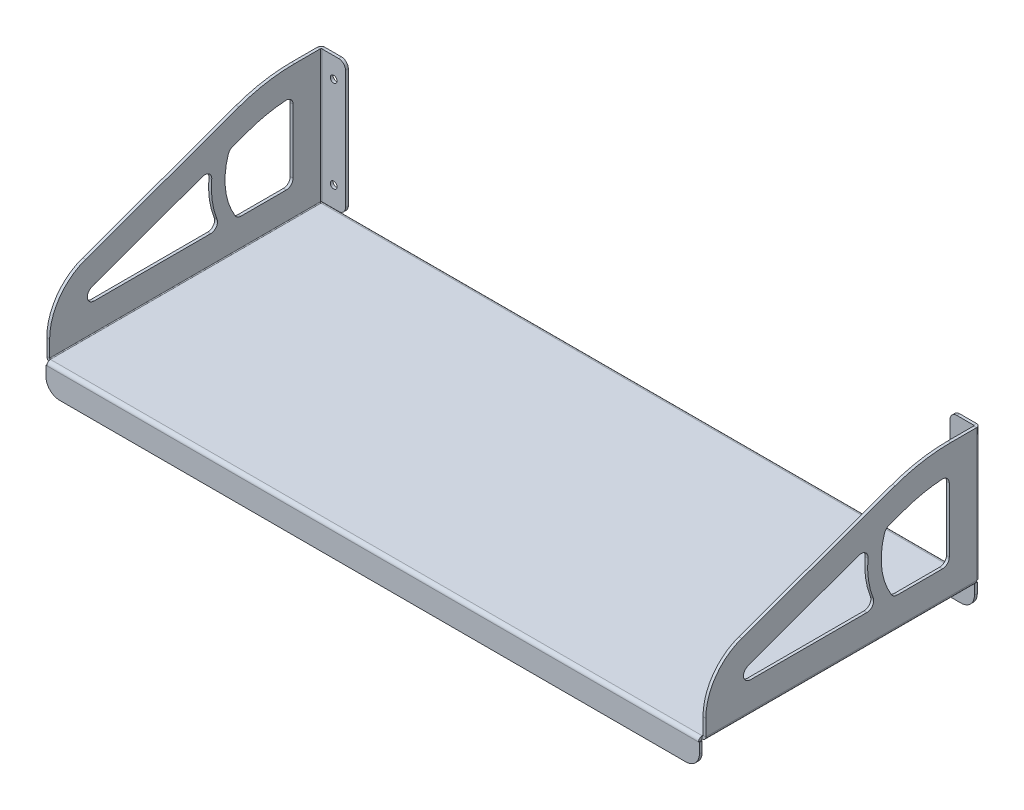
ISO-10303-21;
HEADER;
FILE_DESCRIPTION(('STEP AP214'),'2;1');
FILE_NAME('part.step','',(''),(''),'','','');
FILE_SCHEMA(('AUTOMOTIVE_DESIGN { 1 0 10303 214 1 1 1 1 }'));
ENDSEC;
DATA;
#1=APPLICATION_CONTEXT('core data for automotive mechanical design processes');
#2=APPLICATION_PROTOCOL_DEFINITION('international standard','automotive_design',2000,#1);
#3=PRODUCT_CONTEXT('',#1,'mechanical');
#4=PRODUCT('Part','Part','',(#3));
#5=PRODUCT_RELATED_PRODUCT_CATEGORY('part','',(#4));
#6=PRODUCT_DEFINITION_FORMATION('','',#4);
#7=PRODUCT_DEFINITION_CONTEXT('part definition',#1,'design');
#8=PRODUCT_DEFINITION('design','',#6,#7);
#9=PRODUCT_DEFINITION_SHAPE('','',#8);
#10=(LENGTH_UNIT() NAMED_UNIT(*) SI_UNIT(.MILLI.,.METRE.));
#11=(NAMED_UNIT(*) PLANE_ANGLE_UNIT() SI_UNIT($,.RADIAN.));
#12=(NAMED_UNIT(*) SI_UNIT($,.STERADIAN.) SOLID_ANGLE_UNIT());
#13=UNCERTAINTY_MEASURE_WITH_UNIT(LENGTH_MEASURE(1.E-05),#10,'distance_accuracy_value','');
#14=(GEOMETRIC_REPRESENTATION_CONTEXT(3) GLOBAL_UNCERTAINTY_ASSIGNED_CONTEXT((#13)) GLOBAL_UNIT_ASSIGNED_CONTEXT((#10,
#11,#12)) REPRESENTATION_CONTEXT('',''));
#15=CARTESIAN_POINT('',(0.,0.,0.));
#16=DIRECTION('',(0.,0.,1.));
#17=DIRECTION('',(1.,0.,0.));
#18=AXIS2_PLACEMENT_3D('',#15,#16,#17);
#19=CARTESIAN_POINT('',(0.,-3.39344000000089,0.));
#20=DIRECTION('',(0.,1.,0.));
#21=DIRECTION('',(0.,0.,1.));
#22=AXIS2_PLACEMENT_3D('',#19,#20,#21);
#23=PLANE('',#22);
#24=DIRECTION('',(0.,0.,1.));
#25=VECTOR('',#24,1.);
#26=CARTESIAN_POINT('',(-304.0634,-3.39343999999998,-129.65684));
#27=LINE('',#26,#25);
#28=CARTESIAN_POINT('',(-304.0634,-3.39343999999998,-129.65684));
#29=VERTEX_POINT('',#28);
#30=CARTESIAN_POINT('',(-304.0634,-3.39344,-127.));
#31=VERTEX_POINT('',#30);
#32=EDGE_CURVE('E998',#29,#31,#27,.T.);
#33=ORIENTED_EDGE('',*,*,#32,.F.);
#34=DIRECTION('',(1.,0.,0.));
#35=VECTOR('',#34,1.);
#36=CARTESIAN_POINT('',(0.,-3.39343999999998,-129.65684));
#37=LINE('',#36,#35);
#38=CARTESIAN_POINT('',(-304.8,-3.39343999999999,-129.65684));
#39=VERTEX_POINT('',#38);
#40=EDGE_CURVE('E941',#39,#29,#37,.T.);
#41=ORIENTED_EDGE('',*,*,#40,.F.);
#42=DIRECTION('',(0.,0.,-1.));
#43=VECTOR('',#42,1.);
#44=CARTESIAN_POINT('',(-304.8,-3.39344,-127.));
#45=LINE('',#44,#43);
#46=CARTESIAN_POINT('',(-304.8,-3.39344,-127.));
#47=VERTEX_POINT('',#46);
#48=EDGE_CURVE('E927',#47,#39,#45,.T.);
#49=ORIENTED_EDGE('',*,*,#48,.F.);
#50=DIRECTION('',(1.,0.,0.));
#51=VECTOR('',#50,1.);
#52=CARTESIAN_POINT('',(-304.8,-3.39344,-127.));
#53=LINE('',#52,#51);
#54=EDGE_CURVE('E930',#47,#31,#53,.T.);
#55=ORIENTED_EDGE('',*,*,#54,.T.);
#56=EDGE_LOOP('',(#33,#41,#49,#55));
#57=FACE_BOUND('',#56,.T.);
#58=ADVANCED_FACE('F87',(#57),#23,.T.);
#59=CARTESIAN_POINT('',(304.8,-3.39344,-126.2634));
#60=DIRECTION('',(1.,0.,0.));
#61=DIRECTION('',(0.,0.,-1.));
#62=AXIS2_PLACEMENT_3D('',#59,#60,#61);
#63=CYLINDRICAL_SURFACE('',#62,3.39344);
#64=CARTESIAN_POINT('',(304.0634,-3.39343999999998,-129.65684));
#65=VERTEX_POINT('',#64);
#66=EDGE_CURVE('E945',#29,#65,#37,.T.);
#67=ORIENTED_EDGE('',*,*,#66,.F.);
#68=CARTESIAN_POINT('',(-304.0634,-3.39344,-126.2634));
#69=DIRECTION('',(-1.,0.,0.));
#70=DIRECTION('',(0.,0.,1.));
#71=AXIS2_PLACEMENT_3D('',#68,#69,#70);
#72=CIRCLE('',#71,3.39344);
#73=CARTESIAN_POINT('',(-304.0634,0.,-126.2634));
#74=VERTEX_POINT('',#73);
#75=EDGE_CURVE('E992',#29,#74,#72,.F.);
#76=ORIENTED_EDGE('',*,*,#75,.T.);
#77=DIRECTION('',(1.,0.,0.));
#78=VECTOR('',#77,1.);
#79=CARTESIAN_POINT('',(304.8,0.,-126.2634));
#80=LINE('',#79,#78);
#81=CARTESIAN_POINT('',(304.0634,0.,-126.2634));
#82=VERTEX_POINT('',#81);
#83=EDGE_CURVE('E962',#82,#74,#80,.F.);
#84=ORIENTED_EDGE('',*,*,#83,.F.);
#85=CARTESIAN_POINT('',(304.0634,-3.39344,-126.2634));
#86=DIRECTION('',(1.,0.,0.));
#87=DIRECTION('',(0.,0.,-1.));
#88=AXIS2_PLACEMENT_3D('',#85,#86,#87);
#89=CIRCLE('',#88,3.39344);
#90=EDGE_CURVE('E978',#82,#65,#89,.F.);
#91=ORIENTED_EDGE('',*,*,#90,.T.);
#92=EDGE_LOOP('',(#67,#76,#84,#91));
#93=FACE_BOUND('',#92,.T.);
#94=ADVANCED_FACE('F1268',(#93),#63,.T.);
#95=CARTESIAN_POINT('',(0.,-3.39344,0.));
#96=DIRECTION('',(0.,-1.,0.));
#97=DIRECTION('',(0.,0.,-1.));
#98=AXIS2_PLACEMENT_3D('',#95,#96,#97);
#99=PLANE('',#98);
#100=DIRECTION('',(0.,0.,1.));
#101=VECTOR('',#100,1.);
#102=CARTESIAN_POINT('',(-304.0634,-3.39344,127.));
#103=LINE('',#102,#101);
#104=CARTESIAN_POINT('',(-304.0634,-3.39344,127.));
#105=VERTEX_POINT('',#104);
#106=CARTESIAN_POINT('',(-304.0634,-3.39344,129.65684));
#107=VERTEX_POINT('',#106);
#108=EDGE_CURVE('E990',#105,#107,#103,.T.);
#109=ORIENTED_EDGE('',*,*,#108,.F.);
#110=DIRECTION('',(-1.,0.,0.));
#111=VECTOR('',#110,1.);
#112=CARTESIAN_POINT('',(304.8,-3.39344,127.));
#113=LINE('',#112,#111);
#114=CARTESIAN_POINT('',(-304.8,-3.39344,127.));
#115=VERTEX_POINT('',#114);
#116=EDGE_CURVE('E898',#105,#115,#113,.T.);
#117=ORIENTED_EDGE('',*,*,#116,.T.);
#118=DIRECTION('',(0.,0.,1.));
#119=VECTOR('',#118,1.);
#120=CARTESIAN_POINT('',(-304.8,-3.39344,127.));
#121=LINE('',#120,#119);
#122=CARTESIAN_POINT('',(-304.8,-3.39344,129.65684));
#123=VERTEX_POINT('',#122);
#124=EDGE_CURVE('E896',#115,#123,#121,.T.);
#125=ORIENTED_EDGE('',*,*,#124,.T.);
#126=DIRECTION('',(1.,0.,0.));
#127=VECTOR('',#126,1.);
#128=CARTESIAN_POINT('',(0.,-3.39344,129.65684));
#129=LINE('',#128,#127);
#130=EDGE_CURVE('E903',#123,#107,#129,.T.);
#131=ORIENTED_EDGE('',*,*,#130,.T.);
#132=EDGE_LOOP('',(#109,#117,#125,#131));
#133=FACE_BOUND('',#132,.T.);
#134=ADVANCED_FACE('F1274',(#133),#99,.F.);
#135=CARTESIAN_POINT('',(-304.8,-3.39344,126.2634));
#136=DIRECTION('',(-1.,0.,0.));
#137=DIRECTION('',(0.,0.,1.));
#138=AXIS2_PLACEMENT_3D('',#135,#136,#137);
#139=CYLINDRICAL_SURFACE('',#138,3.39344);
#140=DIRECTION('',(-1.,0.,0.));
#141=VECTOR('',#140,1.);
#142=CARTESIAN_POINT('',(-304.8,0.,126.2634));
#143=LINE('',#142,#141);
#144=CARTESIAN_POINT('',(-304.0634,0.,126.2634));
#145=VERTEX_POINT('',#144);
#146=CARTESIAN_POINT('',(304.0634,0.,126.2634));
#147=VERTEX_POINT('',#146);
#148=EDGE_CURVE('E924',#145,#147,#143,.F.);
#149=ORIENTED_EDGE('',*,*,#148,.F.);
#150=CARTESIAN_POINT('',(-304.0634,-3.39344,126.2634));
#151=DIRECTION('',(-1.,0.,0.));
#152=DIRECTION('',(0.,0.,1.));
#153=AXIS2_PLACEMENT_3D('',#150,#151,#152);
#154=CIRCLE('',#153,3.39344);
#155=EDGE_CURVE('E987',#145,#107,#154,.F.);
#156=ORIENTED_EDGE('',*,*,#155,.T.);
#157=CARTESIAN_POINT('',(304.0634,-3.39344,129.65684));
#158=VERTEX_POINT('',#157);
#159=EDGE_CURVE('E907',#107,#158,#129,.T.);
#160=ORIENTED_EDGE('',*,*,#159,.T.);
#161=CARTESIAN_POINT('',(304.0634,-3.39344,126.2634));
#162=DIRECTION('',(1.,0.,0.));
#163=DIRECTION('',(0.,0.,-1.));
#164=AXIS2_PLACEMENT_3D('',#161,#162,#163);
#165=CIRCLE('',#164,3.39344);
#166=EDGE_CURVE('E965',#158,#147,#165,.F.);
#167=ORIENTED_EDGE('',*,*,#166,.T.);
#168=EDGE_LOOP('',(#149,#156,#160,#167));
#169=FACE_BOUND('',#168,.T.);
#170=ADVANCED_FACE('F1514',(#169),#139,.T.);
#171=CARTESIAN_POINT('',(-304.0634,-3.39344,126.2634));
#172=DIRECTION('',(-1.,0.,0.));
#173=DIRECTION('',(0.,0.,1.));
#174=AXIS2_PLACEMENT_3D('',#171,#172,#173);
#175=PLANE('',#174);
#176=CARTESIAN_POINT('',(-304.0634,-3.39344,126.2634));
#177=DIRECTION('',(-1.,0.,0.));
#178=DIRECTION('',(0.,0.,1.));
#179=AXIS2_PLACEMENT_3D('',#176,#177,#178);
#180=CIRCLE('',#179,0.736600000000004);
#181=CARTESIAN_POINT('',(-304.0634,-2.65683999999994,126.2634));
#182=VERTEX_POINT('',#181);
#183=EDGE_CURVE('E984',#182,#105,#180,.F.);
#184=ORIENTED_EDGE('',*,*,#183,.T.);
#185=ORIENTED_EDGE('',*,*,#108,.T.);
#186=ORIENTED_EDGE('',*,*,#155,.F.);
#187=DIRECTION('',(0.,-1.,0.));
#188=VECTOR('',#187,1.);
#189=CARTESIAN_POINT('',(-304.0634,0.,126.2634));
#190=LINE('',#189,#188);
#191=EDGE_CURVE('E826',#145,#182,#190,.T.);
#192=ORIENTED_EDGE('',*,*,#191,.T.);
#193=EDGE_LOOP('',(#184,#185,#186,#192));
#194=FACE_BOUND('',#193,.T.);
#195=ADVANCED_FACE('F1517',(#194),#175,.T.);
#196=CARTESIAN_POINT('',(0.,-2.65684,0.));
#197=DIRECTION('',(0.,-1.,0.));
#198=DIRECTION('',(0.,0.,-1.));
#199=AXIS2_PLACEMENT_3D('',#196,#197,#198);
#200=PLANE('',#199);
#201=DIRECTION('',(-1.,0.,0.));
#202=VECTOR('',#201,1.);
#203=CARTESIAN_POINT('',(-304.8,-2.65683999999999,126.2634));
#204=LINE('',#203,#202);
#205=CARTESIAN_POINT('',(304.0634,-2.65683999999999,126.2634));
#206=VERTEX_POINT('',#205);
#207=EDGE_CURVE('E917',#182,#206,#204,.F.);
#208=ORIENTED_EDGE('',*,*,#207,.F.);
#209=DIRECTION('',(0.,0.,1.));
#210=VECTOR('',#209,1.);
#211=CARTESIAN_POINT('',(-304.0634,-2.65683999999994,126.2634));
#212=LINE('',#211,#210);
#213=CARTESIAN_POINT('',(-304.0634,-2.65684,-126.2634));
#214=VERTEX_POINT('',#213);
#215=EDGE_CURVE('E819',#182,#214,#212,.F.);
#216=ORIENTED_EDGE('',*,*,#215,.T.);
#217=DIRECTION('',(1.,0.,0.));
#218=VECTOR('',#217,1.);
#219=CARTESIAN_POINT('',(304.8,-2.65684,-126.2634));
#220=LINE('',#219,#218);
#221=CARTESIAN_POINT('',(304.0634,-2.65684,-126.2634));
#222=VERTEX_POINT('',#221);
#223=EDGE_CURVE('E955',#222,#214,#220,.F.);
#224=ORIENTED_EDGE('',*,*,#223,.F.);
#225=DIRECTION('',(0.,0.,-1.));
#226=VECTOR('',#225,1.);
#227=CARTESIAN_POINT('',(304.0634,-2.65684,-126.2634));
#228=LINE('',#227,#226);
#229=EDGE_CURVE('E870',#222,#206,#228,.F.);
#230=ORIENTED_EDGE('',*,*,#229,.T.);
#231=EDGE_LOOP('',(#208,#216,#224,#230));
#232=FACE_BOUND('',#231,.T.);
#233=ADVANCED_FACE('F1548',(#232),#200,.T.);
#234=CARTESIAN_POINT('',(0.,0.,0.));
#235=DIRECTION('',(0.,-1.,0.));
#236=DIRECTION('',(0.,0.,-1.));
#237=AXIS2_PLACEMENT_3D('',#234,#235,#236);
#238=PLANE('',#237);
#239=DIRECTION('',(0.,0.,1.));
#240=VECTOR('',#239,1.);
#241=CARTESIAN_POINT('',(-304.0634,0.,126.2634));
#242=LINE('',#241,#240);
#243=EDGE_CURVE('E832',#145,#74,#242,.F.);
#244=ORIENTED_EDGE('',*,*,#243,.F.);
#245=ORIENTED_EDGE('',*,*,#148,.T.);
#246=DIRECTION('',(0.,0.,-1.));
#247=VECTOR('',#246,1.);
#248=CARTESIAN_POINT('',(304.0634,0.,-126.2634));
#249=LINE('',#248,#247);
#250=EDGE_CURVE('E883',#82,#147,#249,.F.);
#251=ORIENTED_EDGE('',*,*,#250,.F.);
#252=ORIENTED_EDGE('',*,*,#83,.T.);
#253=EDGE_LOOP('',(#244,#245,#251,#252));
#254=FACE_BOUND('',#253,.T.);
#255=ADVANCED_FACE('F1551',(#254),#238,.F.);
#256=CARTESIAN_POINT('',(0.,-3.39344000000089,0.));
#257=DIRECTION('',(0.,-1.,0.));
#258=DIRECTION('',(0.,0.,-1.));
#259=AXIS2_PLACEMENT_3D('',#256,#257,#258);
#260=PLANE('',#259);
#261=DIRECTION('',(0.,0.,-1.));
#262=VECTOR('',#261,1.);
#263=CARTESIAN_POINT('',(304.0634,-3.39344,-127.));
#264=LINE('',#263,#262);
#265=CARTESIAN_POINT('',(304.0634,-3.39344,-127.));
#266=VERTEX_POINT('',#265);
#267=EDGE_CURVE('E981',#266,#65,#264,.T.);
#268=ORIENTED_EDGE('',*,*,#267,.F.);
#269=CARTESIAN_POINT('',(304.8,-3.39344,-127.));
#270=VERTEX_POINT('',#269);
#271=EDGE_CURVE('E935',#266,#270,#53,.T.);
#272=ORIENTED_EDGE('',*,*,#271,.T.);
#273=DIRECTION('',(0.,0.,-1.));
#274=VECTOR('',#273,1.);
#275=CARTESIAN_POINT('',(304.8,-3.39344,-127.));
#276=LINE('',#275,#274);
#277=CARTESIAN_POINT('',(304.8,-3.39343999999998,-129.65684));
#278=VERTEX_POINT('',#277);
#279=EDGE_CURVE('E933',#270,#278,#276,.T.);
#280=ORIENTED_EDGE('',*,*,#279,.T.);
#281=EDGE_CURVE('E938',#65,#278,#37,.T.);
#282=ORIENTED_EDGE('',*,*,#281,.F.);
#283=EDGE_LOOP('',(#268,#272,#280,#282));
#284=FACE_BOUND('',#283,.T.);
#285=ADVANCED_FACE('F1555',(#284),#260,.F.);
#286=CARTESIAN_POINT('',(-304.0634,-3.39344,-126.2634));
#287=DIRECTION('',(-1.,0.,0.));
#288=DIRECTION('',(0.,0.,1.));
#289=AXIS2_PLACEMENT_3D('',#286,#287,#288);
#290=PLANE('',#289);
#291=ORIENTED_EDGE('',*,*,#75,.F.);
#292=ORIENTED_EDGE('',*,*,#32,.T.);
#293=CARTESIAN_POINT('',(-304.0634,-3.39344,-126.2634));
#294=DIRECTION('',(-1.,0.,0.));
#295=DIRECTION('',(0.,0.,1.));
#296=AXIS2_PLACEMENT_3D('',#293,#294,#295);
#297=CIRCLE('',#296,0.736600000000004);
#298=EDGE_CURVE('E995',#31,#214,#297,.F.);
#299=ORIENTED_EDGE('',*,*,#298,.T.);
#300=DIRECTION('',(0.,-1.,0.));
#301=VECTOR('',#300,1.);
#302=CARTESIAN_POINT('',(-304.0634,0.,-126.2634));
#303=LINE('',#302,#301);
#304=EDGE_CURVE('E836',#74,#214,#303,.T.);
#305=ORIENTED_EDGE('',*,*,#304,.F.);
#306=EDGE_LOOP('',(#291,#292,#299,#305));
#307=FACE_BOUND('',#306,.T.);
#308=ADVANCED_FACE('F1279',(#307),#290,.T.);
#309=CARTESIAN_POINT('',(304.0634,-3.39344,-126.2634));
#310=DIRECTION('',(1.,0.,0.));
#311=DIRECTION('',(0.,0.,-1.));
#312=AXIS2_PLACEMENT_3D('',#309,#310,#311);
#313=PLANE('',#312);
#314=CARTESIAN_POINT('',(304.0634,-3.39344,-126.2634));
#315=DIRECTION('',(1.,0.,0.));
#316=DIRECTION('',(0.,0.,-1.));
#317=AXIS2_PLACEMENT_3D('',#314,#315,#316);
#318=CIRCLE('',#317,0.736600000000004);
#319=EDGE_CURVE('E975',#222,#266,#318,.F.);
#320=ORIENTED_EDGE('',*,*,#319,.T.);
#321=ORIENTED_EDGE('',*,*,#267,.T.);
#322=ORIENTED_EDGE('',*,*,#90,.F.);
#323=DIRECTION('',(0.,-1.,0.));
#324=VECTOR('',#323,1.);
#325=CARTESIAN_POINT('',(304.0634,0.,-126.2634));
#326=LINE('',#325,#324);
#327=EDGE_CURVE('E877',#82,#222,#326,.T.);
#328=ORIENTED_EDGE('',*,*,#327,.T.);
#329=EDGE_LOOP('',(#320,#321,#322,#328));
#330=FACE_BOUND('',#329,.T.);
#331=ADVANCED_FACE('F1562',(#330),#313,.T.);
#332=CARTESIAN_POINT('',(0.,-3.39344,0.));
#333=DIRECTION('',(0.,-1.,0.));
#334=DIRECTION('',(0.,0.,-1.));
#335=AXIS2_PLACEMENT_3D('',#332,#333,#334);
#336=PLANE('',#335);
#337=DIRECTION('',(0.,0.,-1.));
#338=VECTOR('',#337,1.);
#339=CARTESIAN_POINT('',(304.0634,-3.39344,129.65684));
#340=LINE('',#339,#338);
#341=CARTESIAN_POINT('',(304.0634,-3.39344,127.));
#342=VERTEX_POINT('',#341);
#343=EDGE_CURVE('E973',#158,#342,#340,.T.);
#344=ORIENTED_EDGE('',*,*,#343,.F.);
#345=CARTESIAN_POINT('',(304.8,-3.39343999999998,129.65684));
#346=VERTEX_POINT('',#345);
#347=EDGE_CURVE('E900',#158,#346,#129,.T.);
#348=ORIENTED_EDGE('',*,*,#347,.T.);
#349=DIRECTION('',(0.,0.,1.));
#350=VECTOR('',#349,1.);
#351=CARTESIAN_POINT('',(304.8,-3.39344,127.));
#352=LINE('',#351,#350);
#353=CARTESIAN_POINT('',(304.8,-3.39344,127.));
#354=VERTEX_POINT('',#353);
#355=EDGE_CURVE('E890',#354,#346,#352,.T.);
#356=ORIENTED_EDGE('',*,*,#355,.F.);
#357=EDGE_CURVE('E893',#354,#342,#113,.T.);
#358=ORIENTED_EDGE('',*,*,#357,.T.);
#359=EDGE_LOOP('',(#344,#348,#356,#358));
#360=FACE_BOUND('',#359,.T.);
#361=ADVANCED_FACE('F1546',(#360),#336,.F.);
#362=CARTESIAN_POINT('',(304.8,-3.39344,-126.2634));
#363=DIRECTION('',(1.,0.,0.));
#364=DIRECTION('',(0.,0.,-1.));
#365=AXIS2_PLACEMENT_3D('',#362,#363,#364);
#366=CYLINDRICAL_SURFACE('',#365,0.736600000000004);
#367=ORIENTED_EDGE('',*,*,#298,.F.);
#368=EDGE_CURVE('E934',#31,#266,#53,.T.);
#369=ORIENTED_EDGE('',*,*,#368,.T.);
#370=ORIENTED_EDGE('',*,*,#319,.F.);
#371=ORIENTED_EDGE('',*,*,#223,.T.);
#372=EDGE_LOOP('',(#367,#369,#370,#371));
#373=FACE_BOUND('',#372,.T.);
#374=ADVANCED_FACE('F1536',(#373),#366,.F.);
#375=CARTESIAN_POINT('',(304.8,-2.65683999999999,-129.65684));
#376=DIRECTION('',(1.,0.,0.));
#377=DIRECTION('',(0.,1.,0.));
#378=AXIS2_PLACEMENT_3D('',#375,#376,#377);
#379=PLANE('',#378);
#380=DIRECTION('',(0.,1.,0.));
#381=VECTOR('',#380,1.);
#382=CARTESIAN_POINT('',(304.8,-2.65684,-127.));
#383=LINE('',#382,#381);
#384=CARTESIAN_POINT('',(304.8,-12.7000000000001,-127.));
#385=VERTEX_POINT('',#384);
#386=EDGE_CURVE('E950',#385,#270,#383,.T.);
#387=ORIENTED_EDGE('',*,*,#386,.F.);
#388=DIRECTION('',(0.,0.,1.));
#389=VECTOR('',#388,1.);
#390=CARTESIAN_POINT('',(304.8,-12.7000000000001,-129.65684));
#391=LINE('',#390,#389);
#392=CARTESIAN_POINT('',(304.8,-12.7000000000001,-129.65684));
#393=VERTEX_POINT('',#392);
#394=EDGE_CURVE('E1105',#385,#393,#391,.F.);
#395=ORIENTED_EDGE('',*,*,#394,.T.);
#396=DIRECTION('',(0.,1.,0.));
#397=VECTOR('',#396,1.);
#398=CARTESIAN_POINT('',(304.8,-2.65683999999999,-129.65684));
#399=LINE('',#398,#397);
#400=EDGE_CURVE('E953',#393,#278,#399,.T.);
#401=ORIENTED_EDGE('',*,*,#400,.T.);
#402=ORIENTED_EDGE('',*,*,#279,.F.);
#403=EDGE_LOOP('',(#387,#395,#401,#402));
#404=FACE_BOUND('',#403,.T.);
#405=ADVANCED_FACE('F1533',(#404),#379,.T.);
#406=CARTESIAN_POINT('',(-304.8,-25.4,-129.65684));
#407=DIRECTION('',(-1.,0.,0.));
#408=DIRECTION('',(0.,-1.,0.));
#409=AXIS2_PLACEMENT_3D('',#406,#407,#408);
#410=PLANE('',#409);
#411=DIRECTION('',(0.,-1.,0.));
#412=VECTOR('',#411,1.);
#413=CARTESIAN_POINT('',(-304.8,-25.4,-129.65684));
#414=LINE('',#413,#412);
#415=CARTESIAN_POINT('',(-304.8,-12.7,-129.65684));
#416=VERTEX_POINT('',#415);
#417=EDGE_CURVE('E946',#39,#416,#414,.T.);
#418=ORIENTED_EDGE('',*,*,#417,.T.);
#419=DIRECTION('',(0.,0.,1.));
#420=VECTOR('',#419,1.);
#421=CARTESIAN_POINT('',(-304.8,-12.7,-129.65684));
#422=LINE('',#421,#420);
#423=CARTESIAN_POINT('',(-304.8,-12.7,-127.));
#424=VERTEX_POINT('',#423);
#425=EDGE_CURVE('E1074',#416,#424,#422,.T.);
#426=ORIENTED_EDGE('',*,*,#425,.T.);
#427=DIRECTION('',(0.,-1.,0.));
#428=VECTOR('',#427,1.);
#429=CARTESIAN_POINT('',(-304.8,-25.4,-127.));
#430=LINE('',#429,#428);
#431=EDGE_CURVE('E944',#47,#424,#430,.T.);
#432=ORIENTED_EDGE('',*,*,#431,.F.);
#433=ORIENTED_EDGE('',*,*,#48,.T.);
#434=EDGE_LOOP('',(#418,#426,#432,#433));
#435=FACE_BOUND('',#434,.T.);
#436=ADVANCED_FACE('F1527',(#435),#410,.T.);
#437=CARTESIAN_POINT('',(0.,4.74245744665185E-13,-129.65684));
#438=DIRECTION('',(0.,0.,-1.));
#439=DIRECTION('',(0.,1.,0.));
#440=AXIS2_PLACEMENT_3D('',#437,#438,#439);
#441=PLANE('',#440);
#442=DIRECTION('',(1.,0.,0.));
#443=VECTOR('',#442,1.);
#444=CARTESIAN_POINT('',(304.8,-25.4,-129.65684));
#445=LINE('',#444,#443);
#446=CARTESIAN_POINT('',(-292.1,-25.4,-129.65684));
#447=VERTEX_POINT('',#446);
#448=CARTESIAN_POINT('',(292.1,-25.4,-129.65684));
#449=VERTEX_POINT('',#448);
#450=EDGE_CURVE('E949',#447,#449,#445,.T.);
#451=ORIENTED_EDGE('',*,*,#450,.F.);
#452=CARTESIAN_POINT('',(-292.1,-12.7,-129.65684));
#453=DIRECTION('',(0.,0.,-1.));
#454=DIRECTION('',(0.,1.,0.));
#455=AXIS2_PLACEMENT_3D('',#452,#453,#454);
#456=CIRCLE('',#455,12.7);
#457=EDGE_CURVE('E1088',#447,#416,#456,.T.);
#458=ORIENTED_EDGE('',*,*,#457,.T.);
#459=ORIENTED_EDGE('',*,*,#417,.F.);
#460=ORIENTED_EDGE('',*,*,#40,.T.);
#461=ORIENTED_EDGE('',*,*,#66,.T.);
#462=ORIENTED_EDGE('',*,*,#281,.T.);
#463=ORIENTED_EDGE('',*,*,#400,.F.);
#464=CARTESIAN_POINT('',(292.1,-12.7,-129.65684));
#465=DIRECTION('',(0.,0.,-1.));
#466=DIRECTION('',(0.,1.,0.));
#467=AXIS2_PLACEMENT_3D('',#464,#465,#466);
#468=CIRCLE('',#467,12.7);
#469=EDGE_CURVE('E1086',#393,#449,#468,.T.);
#470=ORIENTED_EDGE('',*,*,#469,.T.);
#471=EDGE_LOOP('',(#451,#458,#459,#460,#461,#462,#463,#470));
#472=FACE_BOUND('',#471,.T.);
#473=ADVANCED_FACE('F1523',(#472),#441,.T.);
#474=CARTESIAN_POINT('',(0.,4.64969437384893E-13,-127.));
#475=DIRECTION('',(0.,0.,-1.));
#476=DIRECTION('',(0.,1.,0.));
#477=AXIS2_PLACEMENT_3D('',#474,#475,#476);
#478=PLANE('',#477);
#479=ORIENTED_EDGE('',*,*,#431,.T.);
#480=CARTESIAN_POINT('',(-292.1,-12.7,-127.));
#481=DIRECTION('',(0.,0.,-1.));
#482=DIRECTION('',(0.,1.,0.));
#483=AXIS2_PLACEMENT_3D('',#480,#481,#482);
#484=CIRCLE('',#483,12.7);
#485=CARTESIAN_POINT('',(-292.1,-25.4,-127.));
#486=VERTEX_POINT('',#485);
#487=EDGE_CURVE('E1079',#424,#486,#484,.F.);
#488=ORIENTED_EDGE('',*,*,#487,.T.);
#489=DIRECTION('',(1.,0.,0.));
#490=VECTOR('',#489,1.);
#491=CARTESIAN_POINT('',(304.8,-25.4,-127.));
#492=LINE('',#491,#490);
#493=CARTESIAN_POINT('',(292.1,-25.4,-127.));
#494=VERTEX_POINT('',#493);
#495=EDGE_CURVE('E958',#486,#494,#492,.T.);
#496=ORIENTED_EDGE('',*,*,#495,.T.);
#497=CARTESIAN_POINT('',(292.1,-12.7,-127.));
#498=DIRECTION('',(0.,0.,-1.));
#499=DIRECTION('',(0.,1.,0.));
#500=AXIS2_PLACEMENT_3D('',#497,#498,#499);
#501=CIRCLE('',#500,12.7);
#502=EDGE_CURVE('E1077',#494,#385,#501,.F.);
#503=ORIENTED_EDGE('',*,*,#502,.T.);
#504=ORIENTED_EDGE('',*,*,#386,.T.);
#505=ORIENTED_EDGE('',*,*,#271,.F.);
#506=ORIENTED_EDGE('',*,*,#368,.F.);
#507=ORIENTED_EDGE('',*,*,#54,.F.);
#508=EDGE_LOOP('',(#479,#488,#496,#503,#504,#505,#506,#507));
#509=FACE_BOUND('',#508,.T.);
#510=ADVANCED_FACE('F1526',(#509),#478,.F.);
#511=CARTESIAN_POINT('',(304.8,-25.4,-129.65684));
#512=DIRECTION('',(0.,-1.,0.));
#513=DIRECTION('',(0.,0.,-1.));
#514=AXIS2_PLACEMENT_3D('',#511,#512,#513);
#515=PLANE('',#514);
#516=ORIENTED_EDGE('',*,*,#495,.F.);
#517=DIRECTION('',(0.,0.,1.));
#518=VECTOR('',#517,1.);
#519=CARTESIAN_POINT('',(-292.1,-25.4,-129.65684));
#520=LINE('',#519,#518);
#521=EDGE_CURVE('E1084',#486,#447,#520,.F.);
#522=ORIENTED_EDGE('',*,*,#521,.T.);
#523=ORIENTED_EDGE('',*,*,#450,.T.);
#524=DIRECTION('',(0.,0.,1.));
#525=VECTOR('',#524,1.);
#526=CARTESIAN_POINT('',(292.1,-25.4,-129.65684));
#527=LINE('',#526,#525);
#528=EDGE_CURVE('E1081',#449,#494,#527,.T.);
#529=ORIENTED_EDGE('',*,*,#528,.T.);
#530=EDGE_LOOP('',(#516,#522,#523,#529));
#531=FACE_BOUND('',#530,.T.);
#532=ADVANCED_FACE('F1531',(#531),#515,.T.);
#533=CARTESIAN_POINT('',(304.0634,-3.39344,126.2634));
#534=DIRECTION('',(1.,0.,0.));
#535=DIRECTION('',(0.,0.,-1.));
#536=AXIS2_PLACEMENT_3D('',#533,#534,#535);
#537=PLANE('',#536);
#538=ORIENTED_EDGE('',*,*,#166,.F.);
#539=ORIENTED_EDGE('',*,*,#343,.T.);
#540=CARTESIAN_POINT('',(304.0634,-3.39344,126.2634));
#541=DIRECTION('',(1.,0.,0.));
#542=DIRECTION('',(0.,0.,-1.));
#543=AXIS2_PLACEMENT_3D('',#540,#541,#542);
#544=CIRCLE('',#543,0.736600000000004);
#545=EDGE_CURVE('E970',#342,#206,#544,.F.);
#546=ORIENTED_EDGE('',*,*,#545,.T.);
#547=DIRECTION('',(0.,-1.,0.));
#548=VECTOR('',#547,1.);
#549=CARTESIAN_POINT('',(304.0634,0.,126.2634));
#550=LINE('',#549,#548);
#551=EDGE_CURVE('E887',#147,#206,#550,.T.);
#552=ORIENTED_EDGE('',*,*,#551,.F.);
#553=EDGE_LOOP('',(#538,#539,#546,#552));
#554=FACE_BOUND('',#553,.T.);
#555=ADVANCED_FACE('F1521',(#554),#537,.T.);
#556=CARTESIAN_POINT('',(-304.8,-3.39344,126.2634));
#557=DIRECTION('',(-1.,0.,0.));
#558=DIRECTION('',(0.,0.,1.));
#559=AXIS2_PLACEMENT_3D('',#556,#557,#558);
#560=CYLINDRICAL_SURFACE('',#559,0.736600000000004);
#561=ORIENTED_EDGE('',*,*,#183,.F.);
#562=ORIENTED_EDGE('',*,*,#207,.T.);
#563=ORIENTED_EDGE('',*,*,#545,.F.);
#564=EDGE_CURVE('E897',#342,#105,#113,.T.);
#565=ORIENTED_EDGE('',*,*,#564,.T.);
#566=EDGE_LOOP('',(#561,#562,#563,#565));
#567=FACE_BOUND('',#566,.T.);
#568=ADVANCED_FACE('F1512',(#567),#560,.F.);
#569=CARTESIAN_POINT('',(-304.8,-25.4,129.65684));
#570=DIRECTION('',(1.,0.,0.));
#571=DIRECTION('',(0.,0.,-1.));
#572=AXIS2_PLACEMENT_3D('',#569,#570,#571);
#573=PLANE('',#572);
#574=DIRECTION('',(0.,-1.,0.));
#575=VECTOR('',#574,1.);
#576=CARTESIAN_POINT('',(-304.8,-25.4,127.));
#577=LINE('',#576,#575);
#578=CARTESIAN_POINT('',(-304.8,-12.7,127.));
#579=VERTEX_POINT('',#578);
#580=EDGE_CURVE('E906',#115,#579,#577,.T.);
#581=ORIENTED_EDGE('',*,*,#580,.T.);
#582=DIRECTION('',(0.,0.,-1.));
#583=VECTOR('',#582,1.);
#584=CARTESIAN_POINT('',(-304.8,-12.7,129.65684));
#585=LINE('',#584,#583);
#586=CARTESIAN_POINT('',(-304.8,-12.7,129.65684));
#587=VERTEX_POINT('',#586);
#588=EDGE_CURVE('E1099',#579,#587,#585,.F.);
#589=ORIENTED_EDGE('',*,*,#588,.T.);
#590=DIRECTION('',(0.,-1.,0.));
#591=VECTOR('',#590,1.);
#592=CARTESIAN_POINT('',(-304.8,-25.4,129.65684));
#593=LINE('',#592,#591);
#594=EDGE_CURVE('E908',#123,#587,#593,.T.);
#595=ORIENTED_EDGE('',*,*,#594,.F.);
#596=ORIENTED_EDGE('',*,*,#124,.F.);
#597=EDGE_LOOP('',(#581,#589,#595,#596));
#598=FACE_BOUND('',#597,.T.);
#599=ADVANCED_FACE('F1505',(#598),#573,.F.);
#600=CARTESIAN_POINT('',(304.8,-2.65683999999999,129.65684));
#601=DIRECTION('',(-1.,0.,0.));
#602=DIRECTION('',(0.,0.,1.));
#603=AXIS2_PLACEMENT_3D('',#600,#601,#602);
#604=PLANE('',#603);
#605=DIRECTION('',(0.,1.,0.));
#606=VECTOR('',#605,1.);
#607=CARTESIAN_POINT('',(304.8,-2.65683999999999,129.65684));
#608=LINE('',#607,#606);
#609=CARTESIAN_POINT('',(304.8,-12.7,129.65684));
#610=VERTEX_POINT('',#609);
#611=EDGE_CURVE('E915',#610,#346,#608,.T.);
#612=ORIENTED_EDGE('',*,*,#611,.F.);
#613=DIRECTION('',(0.,0.,-1.));
#614=VECTOR('',#613,1.);
#615=CARTESIAN_POINT('',(304.8,-12.7,129.65684));
#616=LINE('',#615,#614);
#617=CARTESIAN_POINT('',(304.8,-12.7,127.));
#618=VERTEX_POINT('',#617);
#619=EDGE_CURVE('E1107',#610,#618,#616,.T.);
#620=ORIENTED_EDGE('',*,*,#619,.T.);
#621=DIRECTION('',(0.,1.,0.));
#622=VECTOR('',#621,1.);
#623=CARTESIAN_POINT('',(304.8,-2.65684,127.));
#624=LINE('',#623,#622);
#625=EDGE_CURVE('E912',#618,#354,#624,.T.);
#626=ORIENTED_EDGE('',*,*,#625,.T.);
#627=ORIENTED_EDGE('',*,*,#355,.T.);
#628=EDGE_LOOP('',(#612,#620,#626,#627));
#629=FACE_BOUND('',#628,.T.);
#630=ADVANCED_FACE('F1498',(#629),#604,.F.);
#631=CARTESIAN_POINT('',(0.,4.74245744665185E-13,129.65684));
#632=DIRECTION('',(0.,0.,-1.));
#633=DIRECTION('',(0.,1.,0.));
#634=AXIS2_PLACEMENT_3D('',#631,#632,#633);
#635=PLANE('',#634);
#636=ORIENTED_EDGE('',*,*,#594,.T.);
#637=CARTESIAN_POINT('',(-292.1,-12.7,129.65684));
#638=DIRECTION('',(0.,0.,-1.));
#639=DIRECTION('',(0.,1.,0.));
#640=AXIS2_PLACEMENT_3D('',#637,#638,#639);
#641=CIRCLE('',#640,12.7);
#642=CARTESIAN_POINT('',(-292.1,-25.4,129.65684));
#643=VERTEX_POINT('',#642);
#644=EDGE_CURVE('E1103',#587,#643,#641,.F.);
#645=ORIENTED_EDGE('',*,*,#644,.T.);
#646=DIRECTION('',(1.,0.,0.));
#647=VECTOR('',#646,1.);
#648=CARTESIAN_POINT('',(304.8,-25.4,129.65684));
#649=LINE('',#648,#647);
#650=CARTESIAN_POINT('',(292.1,-25.4,129.65684));
#651=VERTEX_POINT('',#650);
#652=EDGE_CURVE('E911',#643,#651,#649,.T.);
#653=ORIENTED_EDGE('',*,*,#652,.T.);
#654=CARTESIAN_POINT('',(292.1,-12.7,129.65684));
#655=DIRECTION('',(0.,0.,-1.));
#656=DIRECTION('',(0.,1.,0.));
#657=AXIS2_PLACEMENT_3D('',#654,#655,#656);
#658=CIRCLE('',#657,12.7);
#659=EDGE_CURVE('E1101',#651,#610,#658,.F.);
#660=ORIENTED_EDGE('',*,*,#659,.T.);
#661=ORIENTED_EDGE('',*,*,#611,.T.);
#662=ORIENTED_EDGE('',*,*,#347,.F.);
#663=ORIENTED_EDGE('',*,*,#159,.F.);
#664=ORIENTED_EDGE('',*,*,#130,.F.);
#665=EDGE_LOOP('',(#636,#645,#653,#660,#661,#662,#663,#664));
#666=FACE_BOUND('',#665,.T.);
#667=ADVANCED_FACE('F1494',(#666),#635,.F.);
#668=CARTESIAN_POINT('',(0.,4.64969437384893E-13,127.));
#669=DIRECTION('',(0.,0.,-1.));
#670=DIRECTION('',(0.,1.,0.));
#671=AXIS2_PLACEMENT_3D('',#668,#669,#670);
#672=PLANE('',#671);
#673=DIRECTION('',(1.,0.,0.));
#674=VECTOR('',#673,1.);
#675=CARTESIAN_POINT('',(304.8,-25.4,127.));
#676=LINE('',#675,#674);
#677=CARTESIAN_POINT('',(-292.1,-25.4,127.));
#678=VERTEX_POINT('',#677);
#679=CARTESIAN_POINT('',(292.1,-25.4,127.));
#680=VERTEX_POINT('',#679);
#681=EDGE_CURVE('E920',#678,#680,#676,.T.);
#682=ORIENTED_EDGE('',*,*,#681,.F.);
#683=CARTESIAN_POINT('',(-292.1,-12.7,127.));
#684=DIRECTION('',(0.,0.,-1.));
#685=DIRECTION('',(0.,1.,0.));
#686=AXIS2_PLACEMENT_3D('',#683,#684,#685);
#687=CIRCLE('',#686,12.7);
#688=EDGE_CURVE('E1097',#678,#579,#687,.T.);
#689=ORIENTED_EDGE('',*,*,#688,.T.);
#690=ORIENTED_EDGE('',*,*,#580,.F.);
#691=ORIENTED_EDGE('',*,*,#116,.F.);
#692=ORIENTED_EDGE('',*,*,#564,.F.);
#693=ORIENTED_EDGE('',*,*,#357,.F.);
#694=ORIENTED_EDGE('',*,*,#625,.F.);
#695=CARTESIAN_POINT('',(292.1,-12.7,127.));
#696=DIRECTION('',(0.,0.,-1.));
#697=DIRECTION('',(0.,1.,0.));
#698=AXIS2_PLACEMENT_3D('',#695,#696,#697);
#699=CIRCLE('',#698,12.7);
#700=EDGE_CURVE('E1095',#618,#680,#699,.T.);
#701=ORIENTED_EDGE('',*,*,#700,.T.);
#702=EDGE_LOOP('',(#682,#689,#690,#691,#692,#693,#694,#701));
#703=FACE_BOUND('',#702,.T.);
#704=ADVANCED_FACE('F1497',(#703),#672,.T.);
#705=CARTESIAN_POINT('',(304.8,-25.4,129.65684));
#706=DIRECTION('',(0.,1.,0.));
#707=DIRECTION('',(0.,0.,1.));
#708=AXIS2_PLACEMENT_3D('',#705,#706,#707);
#709=PLANE('',#708);
#710=ORIENTED_EDGE('',*,*,#652,.F.);
#711=DIRECTION('',(0.,0.,-1.));
#712=VECTOR('',#711,1.);
#713=CARTESIAN_POINT('',(-292.1,-25.4,129.65684));
#714=LINE('',#713,#712);
#715=EDGE_CURVE('E1092',#643,#678,#714,.T.);
#716=ORIENTED_EDGE('',*,*,#715,.T.);
#717=ORIENTED_EDGE('',*,*,#681,.T.);
#718=DIRECTION('',(0.,0.,-1.));
#719=VECTOR('',#718,1.);
#720=CARTESIAN_POINT('',(292.1,-25.4,129.65684));
#721=LINE('',#720,#719);
#722=EDGE_CURVE('E1090',#680,#651,#721,.F.);
#723=ORIENTED_EDGE('',*,*,#722,.T.);
#724=EDGE_LOOP('',(#710,#716,#717,#723));
#725=FACE_BOUND('',#724,.T.);
#726=ADVANCED_FACE('F1489',(#725),#709,.F.);
#727=CARTESIAN_POINT('',(304.0634,0.736599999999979,126.2634));
#728=DIRECTION('',(0.,0.,1.));
#729=DIRECTION('',(1.,0.,0.));
#730=AXIS2_PLACEMENT_3D('',#727,#728,#729);
#731=PLANE('',#730);
#732=DIRECTION('',(1.,0.,0.));
#733=VECTOR('',#732,1.);
#734=CARTESIAN_POINT('',(304.8,0.736599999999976,126.2634));
#735=LINE('',#734,#733);
#736=CARTESIAN_POINT('',(304.8,0.736599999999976,126.2634));
#737=VERTEX_POINT('',#736);
#738=CARTESIAN_POINT('',(307.45684,0.736599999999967,126.2634));
#739=VERTEX_POINT('',#738);
#740=EDGE_CURVE('E839',#737,#739,#735,.T.);
#741=ORIENTED_EDGE('',*,*,#740,.F.);
#742=CARTESIAN_POINT('',(304.0634,0.736599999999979,126.2634));
#743=DIRECTION('',(0.,0.,-1.));
#744=DIRECTION('',(-1.,0.,0.));
#745=AXIS2_PLACEMENT_3D('',#742,#743,#744);
#746=CIRCLE('',#745,0.736599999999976);
#747=EDGE_CURVE('E880',#147,#737,#746,.F.);
#748=ORIENTED_EDGE('',*,*,#747,.F.);
#749=ORIENTED_EDGE('',*,*,#551,.T.);
#750=CARTESIAN_POINT('',(304.0634,0.736599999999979,126.2634));
#751=DIRECTION('',(0.,0.,-1.));
#752=DIRECTION('',(-1.,0.,0.));
#753=AXIS2_PLACEMENT_3D('',#750,#751,#752);
#754=CIRCLE('',#753,3.39343999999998);
#755=EDGE_CURVE('E873',#206,#739,#754,.F.);
#756=ORIENTED_EDGE('',*,*,#755,.T.);
#757=EDGE_LOOP('',(#741,#748,#749,#756));
#758=FACE_BOUND('',#757,.T.);
#759=ADVANCED_FACE('F1486',(#758),#731,.T.);
#760=CARTESIAN_POINT('',(304.0634,0.736599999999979,-126.2634));
#761=DIRECTION('',(0.,0.,1.));
#762=DIRECTION('',(1.,0.,0.));
#763=AXIS2_PLACEMENT_3D('',#760,#761,#762);
#764=PLANE('',#763);
#765=CARTESIAN_POINT('',(304.0634,0.736599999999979,-126.2634));
#766=DIRECTION('',(0.,0.,-1.));
#767=DIRECTION('',(-1.,0.,0.));
#768=AXIS2_PLACEMENT_3D('',#765,#766,#767);
#769=CIRCLE('',#768,0.736599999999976);
#770=CARTESIAN_POINT('',(304.8,0.736599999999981,-126.2634));
#771=VERTEX_POINT('',#770);
#772=EDGE_CURVE('E869',#771,#82,#769,.T.);
#773=ORIENTED_EDGE('',*,*,#772,.F.);
#774=DIRECTION('',(1.,0.,0.));
#775=VECTOR('',#774,1.);
#776=CARTESIAN_POINT('',(304.8,0.736599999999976,-126.2634));
#777=LINE('',#776,#775);
#778=CARTESIAN_POINT('',(307.45684,0.736599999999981,-126.2634));
#779=VERTEX_POINT('',#778);
#780=EDGE_CURVE('E845',#771,#779,#777,.T.);
#781=ORIENTED_EDGE('',*,*,#780,.T.);
#782=CARTESIAN_POINT('',(304.0634,0.736599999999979,-126.2634));
#783=DIRECTION('',(0.,0.,-1.));
#784=DIRECTION('',(-1.,0.,0.));
#785=AXIS2_PLACEMENT_3D('',#782,#783,#784);
#786=CIRCLE('',#785,3.39343999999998);
#787=EDGE_CURVE('E874',#779,#222,#786,.T.);
#788=ORIENTED_EDGE('',*,*,#787,.T.);
#789=ORIENTED_EDGE('',*,*,#327,.F.);
#790=EDGE_LOOP('',(#773,#781,#788,#789));
#791=FACE_BOUND('',#790,.T.);
#792=ADVANCED_FACE('F1481',(#791),#764,.F.);
#793=CARTESIAN_POINT('',(304.0634,0.736599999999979,-126.2634));
#794=DIRECTION('',(0.,0.,-1.));
#795=DIRECTION('',(1.,0.,0.));
#796=AXIS2_PLACEMENT_3D('',#793,#794,#795);
#797=CYLINDRICAL_SURFACE('',#796,3.39343999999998);
#798=ORIENTED_EDGE('',*,*,#229,.F.);
#799=ORIENTED_EDGE('',*,*,#787,.F.);
#800=DIRECTION('',(0.,0.,1.));
#801=VECTOR('',#800,1.);
#802=CARTESIAN_POINT('',(307.45684,0.736599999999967,0.));
#803=LINE('',#802,#801);
#804=EDGE_CURVE('E848',#779,#739,#803,.T.);
#805=ORIENTED_EDGE('',*,*,#804,.T.);
#806=ORIENTED_EDGE('',*,*,#755,.F.);
#807=EDGE_LOOP('',(#798,#799,#805,#806));
#808=FACE_BOUND('',#807,.T.);
#809=ADVANCED_FACE('F1478',(#808),#797,.T.);
#810=CARTESIAN_POINT('',(304.0634,0.736599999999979,-126.2634));
#811=DIRECTION('',(0.,0.,-1.));
#812=DIRECTION('',(1.,0.,0.));
#813=AXIS2_PLACEMENT_3D('',#810,#811,#812);
#814=CYLINDRICAL_SURFACE('',#813,0.736599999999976);
#815=ORIENTED_EDGE('',*,*,#250,.T.);
#816=ORIENTED_EDGE('',*,*,#747,.T.);
#817=DIRECTION('',(0.,0.,-1.));
#818=VECTOR('',#817,1.);
#819=CARTESIAN_POINT('',(304.8,0.736599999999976,126.2634));
#820=LINE('',#819,#818);
#821=EDGE_CURVE('E842',#737,#771,#820,.T.);
#822=ORIENTED_EDGE('',*,*,#821,.T.);
#823=ORIENTED_EDGE('',*,*,#772,.T.);
#824=EDGE_LOOP('',(#815,#816,#822,#823));
#825=FACE_BOUND('',#824,.T.);
#826=ADVANCED_FACE('F1473',(#825),#814,.F.);
#827=CARTESIAN_POINT('',(307.45684,0.,126.2634));
#828=DIRECTION('',(0.,0.,-1.));
#829=DIRECTION('',(-1.,0.,0.));
#830=AXIS2_PLACEMENT_3D('',#827,#828,#829);
#831=PLANE('',#830);
#832=DIRECTION('',(0.,-1.,0.));
#833=VECTOR('',#832,1.);
#834=CARTESIAN_POINT('',(307.45684,0.,126.2634));
#835=LINE('',#834,#833);
#836=CARTESIAN_POINT('',(307.45684,15.8637929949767,126.2634));
#837=VERTEX_POINT('',#836);
#838=EDGE_CURVE('E859',#837,#739,#835,.T.);
#839=ORIENTED_EDGE('',*,*,#838,.F.);
#840=DIRECTION('',(-1.,0.,0.));
#841=VECTOR('',#840,1.);
#842=CARTESIAN_POINT('',(307.45684,15.8637929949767,126.2634));
#843=LINE('',#842,#841);
#844=CARTESIAN_POINT('',(304.8,15.8637929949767,126.2634));
#845=VERTEX_POINT('',#844);
#846=EDGE_CURVE('E1000',#837,#845,#843,.T.);
#847=ORIENTED_EDGE('',*,*,#846,.T.);
#848=DIRECTION('',(0.,-1.,0.));
#849=VECTOR('',#848,1.);
#850=CARTESIAN_POINT('',(304.8,0.,126.2634));
#851=LINE('',#850,#849);
#852=EDGE_CURVE('E856',#845,#737,#851,.T.);
#853=ORIENTED_EDGE('',*,*,#852,.T.);
#854=ORIENTED_EDGE('',*,*,#740,.T.);
#855=EDGE_LOOP('',(#839,#847,#853,#854));
#856=FACE_BOUND('',#855,.T.);
#857=ADVANCED_FACE('F1468',(#856),#831,.F.);
#858=CARTESIAN_POINT('',(307.45684,-1.09786365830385E-12,0.));
#859=DIRECTION('',(-1.,0.,0.));
#860=DIRECTION('',(0.,-1.,0.));
#861=AXIS2_PLACEMENT_3D('',#858,#859,#860);
#862=PLANE('',#861);
#863=DIRECTION('',(0.,-0.339482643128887,0.940612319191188));
#864=VECTOR('',#863,1.);
#865=CARTESIAN_POINT('',(307.45684,79.7126684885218,-26.6244078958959));
#866=LINE('',#865,#864);
#867=CARTESIAN_POINT('',(307.45684,76.0599357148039,-16.5036977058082));
#868=VERTEX_POINT('',#867);
#869=CARTESIAN_POINT('',(307.45684,39.7553459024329,84.0862591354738));
#870=VERTEX_POINT('',#869);
#871=EDGE_CURVE('E736',#868,#870,#866,.T.);
#872=ORIENTED_EDGE('',*,*,#871,.F.);
#873=CARTESIAN_POINT('',(307.45684,70.0870474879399,-18.6594124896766));
#874=DIRECTION('',(-1.,0.,0.));
#875=DIRECTION('',(0.,-1.,0.));
#876=AXIS2_PLACEMENT_3D('',#873,#874,#875);
#877=CIRCLE('',#876,6.35);
#878=CARTESIAN_POINT('',(307.45684,69.5062556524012,-24.9827961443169));
#879=VERTEX_POINT('',#878);
#880=EDGE_CURVE('E95',#868,#879,#877,.T.);
#881=ORIENTED_EDGE('',*,*,#880,.T.);
#882=CARTESIAN_POINT('',(307.45684,62.5367536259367,-100.8634));
#883=DIRECTION('',(-1.,0.,0.));
#884=DIRECTION('',(0.,-1.,0.));
#885=AXIS2_PLACEMENT_3D('',#882,#883,#884);
#886=CIRCLE('',#885,76.2);
#887=CARTESIAN_POINT('',(307.45684,34.7981502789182,-29.8915049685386));
#888=VERTEX_POINT('',#887);
#889=EDGE_CURVE('E738',#888,#879,#886,.T.);
#890=ORIENTED_EDGE('',*,*,#889,.F.);
#891=CARTESIAN_POINT('',(307.45684,32.4866,-23.9771803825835));
#892=DIRECTION('',(-1.,0.,0.));
#893=DIRECTION('',(0.,-1.,0.));
#894=AXIS2_PLACEMENT_3D('',#891,#892,#893);
#895=CIRCLE('',#894,6.35);
#896=CARTESIAN_POINT('',(307.45684,26.1366,-23.9771803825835));
#897=VERTEX_POINT('',#896);
#898=EDGE_CURVE('E1227',#888,#897,#895,.T.);
#899=ORIENTED_EDGE('',*,*,#898,.T.);
#900=DIRECTION('',(0.,0.,-1.));
#901=VECTOR('',#900,1.);
#902=CARTESIAN_POINT('',(307.45684,26.1366,98.693325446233));
#903=LINE('',#902,#901);
#904=CARTESIAN_POINT('',(307.45684,26.1366,84.7684946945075));
#905=VERTEX_POINT('',#904);
#906=EDGE_CURVE('E729',#905,#897,#903,.T.);
#907=ORIENTED_EDGE('',*,*,#906,.F.);
#908=CARTESIAN_POINT('',(307.45684,32.4866,84.7684946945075));
#909=DIRECTION('',(-1.,0.,0.));
#910=DIRECTION('',(0.,-1.,0.));
#911=AXIS2_PLACEMENT_3D('',#908,#909,#910);
#912=CIRCLE('',#911,6.35);
#913=CARTESIAN_POINT('',(307.45684,38.027535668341,87.8701929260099));
#914=VERTEX_POINT('',#913);
#915=EDGE_CURVE('E1223',#905,#914,#912,.T.);
#916=ORIENTED_EDGE('',*,*,#915,.T.);
#917=CARTESIAN_POINT('',(307.45684,15.8637929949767,75.4634));
#918=DIRECTION('',(1.,0.,0.));
#919=DIRECTION('',(0.,1.,0.));
#920=AXIS2_PLACEMENT_3D('',#917,#918,#919);
#921=CIRCLE('',#920,25.4);
#922=EDGE_CURVE('E733',#870,#914,#921,.T.);
#923=ORIENTED_EDGE('',*,*,#922,.F.);
#924=EDGE_LOOP('',(#872,#881,#890,#899,#907,#916,#923));
#925=FACE_BOUND('',#924,.T.);
#926=DIRECTION('',(0.,0.,-1.));
#927=VECTOR('',#926,1.);
#928=CARTESIAN_POINT('',(307.45684,26.1366,-48.8318824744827));
#929=LINE('',#928,#927);
#930=CARTESIAN_POINT('',(307.45684,26.1366,-52.2515622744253));
#931=VERTEX_POINT('',#930);
#932=CARTESIAN_POINT('',(307.45684,26.1366,-94.5134));
#933=VERTEX_POINT('',#932);
#934=EDGE_CURVE('E763',#931,#933,#929,.T.);
#935=ORIENTED_EDGE('',*,*,#934,.F.);
#936=CARTESIAN_POINT('',(307.45684,32.4866,-52.2515622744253));
#937=DIRECTION('',(-1.,0.,0.));
#938=DIRECTION('',(0.,-1.,0.));
#939=AXIS2_PLACEMENT_3D('',#936,#937,#938);
#940=CIRCLE('',#939,6.35);
#941=CARTESIAN_POINT('',(307.45684,29.1476940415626,-46.8502469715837));
#942=VERTEX_POINT('',#941);
#943=EDGE_CURVE('E1197',#931,#942,#940,.T.);
#944=ORIENTED_EDGE('',*,*,#943,.T.);
#945=CARTESIAN_POINT('',(307.45684,62.5367536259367,-100.8634));
#946=DIRECTION('',(1.,0.,0.));
#947=DIRECTION('',(0.,-1.,0.));
#948=AXIS2_PLACEMENT_3D('',#945,#946,#947);
#949=CIRCLE('',#948,63.5);
#950=CARTESIAN_POINT('',(307.45684,82.0862223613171,-40.4476051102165));
#951=VERTEX_POINT('',#950);
#952=EDGE_CURVE('E754',#951,#942,#949,.T.);
#953=ORIENTED_EDGE('',*,*,#952,.F.);
#954=CARTESIAN_POINT('',(307.45684,80.1312754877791,-46.4891845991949));
#955=DIRECTION('',(-1.,0.,0.));
#956=DIRECTION('',(0.,-1.,0.));
#957=AXIS2_PLACEMENT_3D('',#954,#955,#956);
#958=CIRCLE('',#957,6.35);
#959=CARTESIAN_POINT('',(307.45684,86.1041637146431,-44.3334698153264));
#960=VERTEX_POINT('',#959);
#961=EDGE_CURVE('E1193',#951,#960,#958,.T.);
#962=ORIENTED_EDGE('',*,*,#961,.T.);
#963=DIRECTION('',(0.,-0.339482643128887,0.940612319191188));
#964=VECTOR('',#963,1.);
#965=CARTESIAN_POINT('',(307.45684,91.4009245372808,-59.0093260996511));
#966=LINE('',#965,#964);
#967=CARTESIAN_POINT('',(307.45684,91.4009245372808,-59.0093260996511));
#968=VERTEX_POINT('',#967);
#969=EDGE_CURVE('E744',#968,#960,#966,.T.);
#970=ORIENTED_EDGE('',*,*,#969,.F.);
#971=CARTESIAN_POINT('',(307.45684,-28.05684,-102.12362177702));
#972=DIRECTION('',(1.,0.,0.));
#973=DIRECTION('',(0.,1.,0.));
#974=AXIS2_PLACEMENT_3D('',#971,#972,#973);
#975=CIRCLE('',#974,127.);
#976=CARTESIAN_POINT('',(307.45684,98.6902614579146,-94.1128620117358));
#977=VERTEX_POINT('',#976);
#978=EDGE_CURVE('E758',#977,#968,#975,.T.);
#979=ORIENTED_EDGE('',*,*,#978,.F.);
#980=CARTESIAN_POINT('',(307.45684,92.3529063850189,-94.5134));
#981=DIRECTION('',(-1.,0.,0.));
#982=DIRECTION('',(0.,-1.,0.));
#983=AXIS2_PLACEMENT_3D('',#980,#981,#982);
#984=CIRCLE('',#983,6.35);
#985=CARTESIAN_POINT('',(307.45684,92.3529063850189,-100.8634));
#986=VERTEX_POINT('',#985);
#987=EDGE_CURVE('E1201',#977,#986,#984,.T.);
#988=ORIENTED_EDGE('',*,*,#987,.T.);
#989=DIRECTION('',(0.,1.,0.));
#990=VECTOR('',#989,1.);
#991=CARTESIAN_POINT('',(307.45684,26.1366,-100.8634));
#992=LINE('',#991,#990);
#993=CARTESIAN_POINT('',(307.45684,32.4866,-100.8634));
#994=VERTEX_POINT('',#993);
#995=EDGE_CURVE('E760',#994,#986,#992,.T.);
#996=ORIENTED_EDGE('',*,*,#995,.F.);
#997=CARTESIAN_POINT('',(307.45684,32.4866,-94.5134));
#998=DIRECTION('',(-1.,0.,0.));
#999=DIRECTION('',(0.,-1.,0.));
#1000=AXIS2_PLACEMENT_3D('',#997,#998,#999);
#1001=CIRCLE('',#1000,6.35);
#1002=EDGE_CURVE('E1205',#994,#933,#1001,.T.);
#1003=ORIENTED_EDGE('',*,*,#1002,.T.);
#1004=EDGE_LOOP('',(#935,#944,#953,#962,#970,#979,#988,#996,#1003));
#1005=FACE_BOUND('',#1004,.T.);
#1006=DIRECTION('',(0.,0.,1.));
#1007=VECTOR('',#1006,1.);
#1008=CARTESIAN_POINT('',(307.45684,124.34316,126.2634));
#1009=LINE('',#1008,#1007);
#1010=CARTESIAN_POINT('',(307.45684,124.34316,-126.2634));
#1011=VERTEX_POINT('',#1010);
#1012=CARTESIAN_POINT('',(307.45684,124.34316,-102.12362177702));
#1013=VERTEX_POINT('',#1012);
#1014=EDGE_CURVE('E855',#1011,#1013,#1009,.T.);
#1015=ORIENTED_EDGE('',*,*,#1014,.T.);
#1016=CARTESIAN_POINT('',(307.45684,-28.05684,-102.12362177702));
#1017=DIRECTION('',(-1.,0.,0.));
#1018=DIRECTION('',(0.,-1.,0.));
#1019=AXIS2_PLACEMENT_3D('',#1016,#1017,#1018);
#1020=CIRCLE('',#1019,152.4);
#1021=CARTESIAN_POINT('',(307.45684,115.292477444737,-50.3864669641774));
#1022=VERTEX_POINT('',#1021);
#1023=EDGE_CURVE('E1028',#1013,#1022,#1020,.F.);
#1024=ORIENTED_EDGE('',*,*,#1023,.T.);
#1025=DIRECTION('',(0.,0.339482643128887,-0.940612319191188));
#1026=VECTOR('',#1025,1.);
#1027=CARTESIAN_POINT('',(307.45684,124.343159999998,-75.4633999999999));
#1028=LINE('',#1027,#1026);
#1029=CARTESIAN_POINT('',(307.45684,63.6468988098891,92.7091182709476));
#1030=VERTEX_POINT('',#1029);
#1031=EDGE_CURVE('E732',#1030,#1022,#1028,.T.);
#1032=ORIENTED_EDGE('',*,*,#1031,.F.);
#1033=CARTESIAN_POINT('',(307.45684,15.8637929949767,75.4634));
#1034=DIRECTION('',(-1.,0.,0.));
#1035=DIRECTION('',(0.,-1.,0.));
#1036=AXIS2_PLACEMENT_3D('',#1033,#1034,#1035);
#1037=CIRCLE('',#1036,50.8);
#1038=EDGE_CURVE('E1008',#1030,#837,#1037,.F.);
#1039=ORIENTED_EDGE('',*,*,#1038,.T.);
#1040=ORIENTED_EDGE('',*,*,#838,.T.);
#1041=ORIENTED_EDGE('',*,*,#804,.F.);
#1042=DIRECTION('',(0.,1.,0.));
#1043=VECTOR('',#1042,1.);
#1044=CARTESIAN_POINT('',(307.45684,124.34316,-126.2634));
#1045=LINE('',#1044,#1043);
#1046=EDGE_CURVE('E578',#779,#1011,#1045,.T.);
#1047=ORIENTED_EDGE('',*,*,#1046,.T.);
#1048=EDGE_LOOP('',(#1015,#1024,#1032,#1039,#1040,#1041,#1047));
#1049=FACE_BOUND('',#1048,.T.);
#1050=ADVANCED_FACE('F1233',(#925,#1005,#1049),#862,.F.);
#1051=CARTESIAN_POINT('',(304.8,-1.08858735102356E-12,0.));
#1052=DIRECTION('',(-1.,0.,0.));
#1053=DIRECTION('',(0.,-1.,0.));
#1054=AXIS2_PLACEMENT_3D('',#1051,#1052,#1053);
#1055=PLANE('',#1054);
#1056=DIRECTION('',(0.,0.,-1.));
#1057=VECTOR('',#1056,1.);
#1058=CARTESIAN_POINT('',(304.8,26.1366,98.693325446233));
#1059=LINE('',#1058,#1057);
#1060=CARTESIAN_POINT('',(304.8,26.1366,84.7684946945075));
#1061=VERTEX_POINT('',#1060);
#1062=CARTESIAN_POINT('',(304.8,26.1366,-23.9771803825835));
#1063=VERTEX_POINT('',#1062);
#1064=EDGE_CURVE('E743',#1061,#1063,#1059,.T.);
#1065=ORIENTED_EDGE('',*,*,#1064,.T.);
#1066=CARTESIAN_POINT('',(304.8,32.4866,-23.9771803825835));
#1067=DIRECTION('',(-1.,0.,0.));
#1068=DIRECTION('',(0.,-1.,0.));
#1069=AXIS2_PLACEMENT_3D('',#1066,#1067,#1068);
#1070=CIRCLE('',#1069,6.35);
#1071=CARTESIAN_POINT('',(304.8,34.7981502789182,-29.8915049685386));
#1072=VERTEX_POINT('',#1071);
#1073=EDGE_CURVE('E1229',#1063,#1072,#1070,.F.);
#1074=ORIENTED_EDGE('',*,*,#1073,.T.);
#1075=CARTESIAN_POINT('',(304.8,62.5367536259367,-100.8634));
#1076=DIRECTION('',(-1.,0.,0.));
#1077=DIRECTION('',(0.,-1.,0.));
#1078=AXIS2_PLACEMENT_3D('',#1075,#1076,#1077);
#1079=CIRCLE('',#1078,76.2);
#1080=CARTESIAN_POINT('',(304.8,69.5062556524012,-24.9827961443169));
#1081=VERTEX_POINT('',#1080);
#1082=EDGE_CURVE('E741',#1072,#1081,#1079,.T.);
#1083=ORIENTED_EDGE('',*,*,#1082,.T.);
#1084=CARTESIAN_POINT('',(304.8,70.0870474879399,-18.6594124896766));
#1085=DIRECTION('',(-1.,0.,0.));
#1086=DIRECTION('',(0.,-1.,0.));
#1087=AXIS2_PLACEMENT_3D('',#1084,#1085,#1086);
#1088=CIRCLE('',#1087,6.35);
#1089=CARTESIAN_POINT('',(304.8,76.0599357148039,-16.5036977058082));
#1090=VERTEX_POINT('',#1089);
#1091=EDGE_CURVE('E13',#1081,#1090,#1088,.F.);
#1092=ORIENTED_EDGE('',*,*,#1091,.T.);
#1093=DIRECTION('',(0.,-0.339482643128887,0.940612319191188));
#1094=VECTOR('',#1093,1.);
#1095=CARTESIAN_POINT('',(304.8,79.7126684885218,-26.6244078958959));
#1096=LINE('',#1095,#1094);
#1097=CARTESIAN_POINT('',(304.8,39.7553459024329,84.0862591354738));
#1098=VERTEX_POINT('',#1097);
#1099=EDGE_CURVE('E725',#1090,#1098,#1096,.T.);
#1100=ORIENTED_EDGE('',*,*,#1099,.T.);
#1101=CARTESIAN_POINT('',(304.8,15.8637929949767,75.4634));
#1102=DIRECTION('',(-1.,0.,0.));
#1103=DIRECTION('',(0.,-1.,0.));
#1104=AXIS2_PLACEMENT_3D('',#1101,#1102,#1103);
#1105=CIRCLE('',#1104,25.4);
#1106=CARTESIAN_POINT('',(304.8,38.0275356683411,87.8701929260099));
#1107=VERTEX_POINT('',#1106);
#1108=EDGE_CURVE('E728',#1098,#1107,#1105,.F.);
#1109=ORIENTED_EDGE('',*,*,#1108,.T.);
#1110=CARTESIAN_POINT('',(304.8,32.4866,84.7684946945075));
#1111=DIRECTION('',(-1.,0.,0.));
#1112=DIRECTION('',(0.,-1.,0.));
#1113=AXIS2_PLACEMENT_3D('',#1110,#1111,#1112);
#1114=CIRCLE('',#1113,6.35);
#1115=EDGE_CURVE('E1225',#1107,#1061,#1114,.F.);
#1116=ORIENTED_EDGE('',*,*,#1115,.T.);
#1117=EDGE_LOOP('',(#1065,#1074,#1083,#1092,#1100,#1109,#1116));
#1118=FACE_BOUND('',#1117,.T.);
#1119=DIRECTION('',(0.,-0.339482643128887,0.940612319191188));
#1120=VECTOR('',#1119,1.);
#1121=CARTESIAN_POINT('',(304.8,91.4009245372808,-59.0093260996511));
#1122=LINE('',#1121,#1120);
#1123=CARTESIAN_POINT('',(304.8,91.400924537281,-59.0093260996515));
#1124=VERTEX_POINT('',#1123);
#1125=CARTESIAN_POINT('',(304.8,86.1041637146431,-44.3334698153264));
#1126=VERTEX_POINT('',#1125);
#1127=EDGE_CURVE('E770',#1124,#1126,#1122,.T.);
#1128=ORIENTED_EDGE('',*,*,#1127,.T.);
#1129=CARTESIAN_POINT('',(304.8,80.1312754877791,-46.4891845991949));
#1130=DIRECTION('',(-1.,0.,0.));
#1131=DIRECTION('',(0.,-1.,0.));
#1132=AXIS2_PLACEMENT_3D('',#1129,#1130,#1131);
#1133=CIRCLE('',#1132,6.35);
#1134=CARTESIAN_POINT('',(304.8,82.0862223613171,-40.4476051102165));
#1135=VERTEX_POINT('',#1134);
#1136=EDGE_CURVE('E1195',#1126,#1135,#1133,.F.);
#1137=ORIENTED_EDGE('',*,*,#1136,.T.);
#1138=CARTESIAN_POINT('',(304.8,62.5367536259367,-100.8634));
#1139=DIRECTION('',(-1.,0.,0.));
#1140=DIRECTION('',(0.,-1.,0.));
#1141=AXIS2_PLACEMENT_3D('',#1138,#1139,#1140);
#1142=CIRCLE('',#1141,63.5);
#1143=CARTESIAN_POINT('',(304.8,29.1476940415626,-46.8502469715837));
#1144=VERTEX_POINT('',#1143);
#1145=EDGE_CURVE('E695',#1135,#1144,#1142,.F.);
#1146=ORIENTED_EDGE('',*,*,#1145,.T.);
#1147=CARTESIAN_POINT('',(304.8,32.4866,-52.2515622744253));
#1148=DIRECTION('',(-1.,0.,0.));
#1149=DIRECTION('',(0.,-1.,0.));
#1150=AXIS2_PLACEMENT_3D('',#1147,#1148,#1149);
#1151=CIRCLE('',#1150,6.35);
#1152=CARTESIAN_POINT('',(304.8,26.1366,-52.2515622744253));
#1153=VERTEX_POINT('',#1152);
#1154=EDGE_CURVE('E1199',#1144,#1153,#1151,.F.);
#1155=ORIENTED_EDGE('',*,*,#1154,.T.);
#1156=DIRECTION('',(0.,0.,-1.));
#1157=VECTOR('',#1156,1.);
#1158=CARTESIAN_POINT('',(304.8,26.1366,-48.8318824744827));
#1159=LINE('',#1158,#1157);
#1160=CARTESIAN_POINT('',(304.8,26.1366,-94.5134));
#1161=VERTEX_POINT('',#1160);
#1162=EDGE_CURVE('E751',#1153,#1161,#1159,.T.);
#1163=ORIENTED_EDGE('',*,*,#1162,.T.);
#1164=CARTESIAN_POINT('',(304.8,32.4866,-94.5134));
#1165=DIRECTION('',(-1.,0.,0.));
#1166=DIRECTION('',(0.,-1.,0.));
#1167=AXIS2_PLACEMENT_3D('',#1164,#1165,#1166);
#1168=CIRCLE('',#1167,6.35);
#1169=CARTESIAN_POINT('',(304.8,32.4866,-100.8634));
#1170=VERTEX_POINT('',#1169);
#1171=EDGE_CURVE('E1207',#1161,#1170,#1168,.F.);
#1172=ORIENTED_EDGE('',*,*,#1171,.T.);
#1173=DIRECTION('',(0.,1.,0.));
#1174=VECTOR('',#1173,1.);
#1175=CARTESIAN_POINT('',(304.8,26.1366,-100.8634));
#1176=LINE('',#1175,#1174);
#1177=CARTESIAN_POINT('',(304.8,92.3529063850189,-100.8634));
#1178=VERTEX_POINT('',#1177);
#1179=EDGE_CURVE('E755',#1170,#1178,#1176,.T.);
#1180=ORIENTED_EDGE('',*,*,#1179,.T.);
#1181=CARTESIAN_POINT('',(304.8,92.3529063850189,-94.5134));
#1182=DIRECTION('',(-1.,0.,0.));
#1183=DIRECTION('',(0.,-1.,0.));
#1184=AXIS2_PLACEMENT_3D('',#1181,#1182,#1183);
#1185=CIRCLE('',#1184,6.35);
#1186=CARTESIAN_POINT('',(304.8,98.6902614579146,-94.1128620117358));
#1187=VERTEX_POINT('',#1186);
#1188=EDGE_CURVE('E1203',#1178,#1187,#1185,.F.);
#1189=ORIENTED_EDGE('',*,*,#1188,.T.);
#1190=CARTESIAN_POINT('',(304.8,-28.05684,-102.12362177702));
#1191=DIRECTION('',(-1.,0.,0.));
#1192=DIRECTION('',(0.,-1.,0.));
#1193=AXIS2_PLACEMENT_3D('',#1190,#1191,#1192);
#1194=CIRCLE('',#1193,127.);
#1195=EDGE_CURVE('E773',#1187,#1124,#1194,.F.);
#1196=ORIENTED_EDGE('',*,*,#1195,.T.);
#1197=EDGE_LOOP('',(#1128,#1137,#1146,#1155,#1163,#1172,#1180,#1189,#1196));
#1198=FACE_BOUND('',#1197,.T.);
#1199=DIRECTION('',(0.,-0.339482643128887,0.940612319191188));
#1200=VECTOR('',#1199,1.);
#1201=CARTESIAN_POINT('',(304.8,124.343159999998,-75.4633999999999));
#1202=LINE('',#1201,#1200);
#1203=CARTESIAN_POINT('',(304.8,115.292477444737,-50.3864669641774));
#1204=VERTEX_POINT('',#1203);
#1205=CARTESIAN_POINT('',(304.8,63.6468988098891,92.7091182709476));
#1206=VERTEX_POINT('',#1205);
#1207=EDGE_CURVE('E782',#1204,#1206,#1202,.T.);
#1208=ORIENTED_EDGE('',*,*,#1207,.F.);
#1209=CARTESIAN_POINT('',(304.8,-28.05684,-102.12362177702));
#1210=DIRECTION('',(-1.,0.,0.));
#1211=DIRECTION('',(0.,-1.,0.));
#1212=AXIS2_PLACEMENT_3D('',#1209,#1210,#1211);
#1213=CIRCLE('',#1212,152.4);
#1214=CARTESIAN_POINT('',(304.8,124.34316,-102.12362177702));
#1215=VERTEX_POINT('',#1214);
#1216=EDGE_CURVE('E1024',#1204,#1215,#1213,.T.);
#1217=ORIENTED_EDGE('',*,*,#1216,.T.);
#1218=DIRECTION('',(0.,0.,1.));
#1219=VECTOR('',#1218,1.);
#1220=CARTESIAN_POINT('',(304.8,124.34316,126.2634));
#1221=LINE('',#1220,#1219);
#1222=CARTESIAN_POINT('',(304.8,124.34316,-126.2634));
#1223=VERTEX_POINT('',#1222);
#1224=EDGE_CURVE('E863',#1223,#1215,#1221,.T.);
#1225=ORIENTED_EDGE('',*,*,#1224,.F.);
#1226=DIRECTION('',(0.,1.,0.));
#1227=VECTOR('',#1226,1.);
#1228=CARTESIAN_POINT('',(304.8,124.34316,-126.2634));
#1229=LINE('',#1228,#1227);
#1230=EDGE_CURVE('E853',#771,#1223,#1229,.T.);
#1231=ORIENTED_EDGE('',*,*,#1230,.F.);
#1232=ORIENTED_EDGE('',*,*,#821,.F.);
#1233=ORIENTED_EDGE('',*,*,#852,.F.);
#1234=CARTESIAN_POINT('',(304.8,15.8637929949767,75.4634));
#1235=DIRECTION('',(-1.,0.,0.));
#1236=DIRECTION('',(0.,-1.,0.));
#1237=AXIS2_PLACEMENT_3D('',#1234,#1235,#1236);
#1238=CIRCLE('',#1237,50.8);
#1239=EDGE_CURVE('E1003',#845,#1206,#1238,.T.);
#1240=ORIENTED_EDGE('',*,*,#1239,.T.);
#1241=EDGE_LOOP('',(#1208,#1217,#1225,#1231,#1232,#1233,#1240));
#1242=FACE_BOUND('',#1241,.T.);
#1243=ADVANCED_FACE('F1244',(#1118,#1198,#1242),#1055,.T.);
#1244=CARTESIAN_POINT('',(307.45684,124.34316,126.2634));
#1245=DIRECTION('',(0.,-1.,0.));
#1246=DIRECTION('',(1.,0.,0.));
#1247=AXIS2_PLACEMENT_3D('',#1244,#1245,#1246);
#1248=PLANE('',#1247);
#1249=ORIENTED_EDGE('',*,*,#1224,.T.);
#1250=DIRECTION('',(-1.,0.,0.));
#1251=VECTOR('',#1250,1.);
#1252=CARTESIAN_POINT('',(307.45684,124.34316,-102.12362177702));
#1253=LINE('',#1252,#1251);
#1254=EDGE_CURVE('E1026',#1215,#1013,#1253,.F.);
#1255=ORIENTED_EDGE('',*,*,#1254,.T.);
#1256=ORIENTED_EDGE('',*,*,#1014,.F.);
#1257=DIRECTION('',(-1.,0.,0.));
#1258=VECTOR('',#1257,1.);
#1259=CARTESIAN_POINT('',(307.45684,124.34316,-126.2634));
#1260=LINE('',#1259,#1258);
#1261=EDGE_CURVE('E861',#1011,#1223,#1260,.T.);
#1262=ORIENTED_EDGE('',*,*,#1261,.T.);
#1263=EDGE_LOOP('',(#1249,#1255,#1256,#1262));
#1264=FACE_BOUND('',#1263,.T.);
#1265=ADVANCED_FACE('F1461',(#1264),#1248,.F.);
#1266=CARTESIAN_POINT('',(-304.0634,0.736599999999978,-126.2634));
#1267=DIRECTION('',(0.,0.,-1.));
#1268=DIRECTION('',(0.,1.,0.));
#1269=AXIS2_PLACEMENT_3D('',#1266,#1267,#1268);
#1270=PLANE('',#1269);
#1271=DIRECTION('',(-1.,0.,0.));
#1272=VECTOR('',#1271,1.);
#1273=CARTESIAN_POINT('',(-304.8,0.736599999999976,-126.2634));
#1274=LINE('',#1273,#1272);
#1275=CARTESIAN_POINT('',(-304.8,0.736599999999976,-126.2634));
#1276=VERTEX_POINT('',#1275);
#1277=CARTESIAN_POINT('',(-307.45684,0.736599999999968,-126.2634));
#1278=VERTEX_POINT('',#1277);
#1279=EDGE_CURVE('E788',#1276,#1278,#1274,.T.);
#1280=ORIENTED_EDGE('',*,*,#1279,.F.);
#1281=CARTESIAN_POINT('',(-304.0634,0.736599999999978,-126.2634));
#1282=DIRECTION('',(0.,0.,1.));
#1283=DIRECTION('',(0.,-1.,0.));
#1284=AXIS2_PLACEMENT_3D('',#1281,#1282,#1283);
#1285=CIRCLE('',#1284,0.736599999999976);
#1286=EDGE_CURVE('E829',#74,#1276,#1285,.F.);
#1287=ORIENTED_EDGE('',*,*,#1286,.F.);
#1288=ORIENTED_EDGE('',*,*,#304,.T.);
#1289=CARTESIAN_POINT('',(-304.0634,0.736599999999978,-126.2634));
#1290=DIRECTION('',(0.,0.,1.));
#1291=DIRECTION('',(0.,-1.,0.));
#1292=AXIS2_PLACEMENT_3D('',#1289,#1290,#1291);
#1293=CIRCLE('',#1292,3.39343999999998);
#1294=EDGE_CURVE('E822',#214,#1278,#1293,.F.);
#1295=ORIENTED_EDGE('',*,*,#1294,.T.);
#1296=EDGE_LOOP('',(#1280,#1287,#1288,#1295));
#1297=FACE_BOUND('',#1296,.T.);
#1298=ADVANCED_FACE('F1458',(#1297),#1270,.T.);
#1299=CARTESIAN_POINT('',(-304.0634,0.736600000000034,126.2634));
#1300=DIRECTION('',(0.,0.,-1.));
#1301=DIRECTION('',(0.,1.,0.));
#1302=AXIS2_PLACEMENT_3D('',#1299,#1300,#1301);
#1303=PLANE('',#1302);
#1304=CARTESIAN_POINT('',(-304.0634,0.736600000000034,126.2634));
#1305=DIRECTION('',(0.,0.,1.));
#1306=DIRECTION('',(0.,-1.,0.));
#1307=AXIS2_PLACEMENT_3D('',#1304,#1305,#1306);
#1308=CIRCLE('',#1307,0.736599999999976);
#1309=CARTESIAN_POINT('',(-304.8,0.736600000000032,126.2634));
#1310=VERTEX_POINT('',#1309);
#1311=EDGE_CURVE('E818',#1310,#145,#1308,.T.);
#1312=ORIENTED_EDGE('',*,*,#1311,.F.);
#1313=DIRECTION('',(-1.,0.,0.));
#1314=VECTOR('',#1313,1.);
#1315=CARTESIAN_POINT('',(-304.8,0.736600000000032,126.2634));
#1316=LINE('',#1315,#1314);
#1317=CARTESIAN_POINT('',(-307.45684,0.736600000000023,126.2634));
#1318=VERTEX_POINT('',#1317);
#1319=EDGE_CURVE('E791',#1310,#1318,#1316,.T.);
#1320=ORIENTED_EDGE('',*,*,#1319,.T.);
#1321=CARTESIAN_POINT('',(-304.0634,0.736600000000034,126.2634));
#1322=DIRECTION('',(0.,0.,1.));
#1323=DIRECTION('',(0.,-1.,0.));
#1324=AXIS2_PLACEMENT_3D('',#1321,#1322,#1323);
#1325=CIRCLE('',#1324,3.39343999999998);
#1326=EDGE_CURVE('E823',#1318,#182,#1325,.T.);
#1327=ORIENTED_EDGE('',*,*,#1326,.T.);
#1328=ORIENTED_EDGE('',*,*,#191,.F.);
#1329=EDGE_LOOP('',(#1312,#1320,#1327,#1328));
#1330=FACE_BOUND('',#1329,.T.);
#1331=ADVANCED_FACE('F1453',(#1330),#1303,.F.);
#1332=CARTESIAN_POINT('',(-304.0634,0.736600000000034,126.2634));
#1333=DIRECTION('',(0.,0.,1.));
#1334=DIRECTION('',(-1.,0.,0.));
#1335=AXIS2_PLACEMENT_3D('',#1332,#1333,#1334);
#1336=CYLINDRICAL_SURFACE('',#1335,3.39343999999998);
#1337=ORIENTED_EDGE('',*,*,#215,.F.);
#1338=ORIENTED_EDGE('',*,*,#1326,.F.);
#1339=DIRECTION('',(0.,0.,-1.));
#1340=VECTOR('',#1339,1.);
#1341=CARTESIAN_POINT('',(-307.45684,0.736599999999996,0.));
#1342=LINE('',#1341,#1340);
#1343=EDGE_CURVE('E794',#1318,#1278,#1342,.T.);
#1344=ORIENTED_EDGE('',*,*,#1343,.T.);
#1345=ORIENTED_EDGE('',*,*,#1294,.F.);
#1346=EDGE_LOOP('',(#1337,#1338,#1344,#1345));
#1347=FACE_BOUND('',#1346,.T.);
#1348=ADVANCED_FACE('F1450',(#1347),#1336,.T.);
#1349=CARTESIAN_POINT('',(-304.0634,0.736600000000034,126.2634));
#1350=DIRECTION('',(0.,0.,1.));
#1351=DIRECTION('',(-1.,0.,0.));
#1352=AXIS2_PLACEMENT_3D('',#1349,#1350,#1351);
#1353=CYLINDRICAL_SURFACE('',#1352,0.736599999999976);
#1354=ORIENTED_EDGE('',*,*,#243,.T.);
#1355=ORIENTED_EDGE('',*,*,#1286,.T.);
#1356=DIRECTION('',(0.,0.,1.));
#1357=VECTOR('',#1356,1.);
#1358=CARTESIAN_POINT('',(-304.8,0.736599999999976,-126.2634));
#1359=LINE('',#1358,#1357);
#1360=EDGE_CURVE('E789',#1276,#1310,#1359,.T.);
#1361=ORIENTED_EDGE('',*,*,#1360,.T.);
#1362=ORIENTED_EDGE('',*,*,#1311,.T.);
#1363=EDGE_LOOP('',(#1354,#1355,#1361,#1362));
#1364=FACE_BOUND('',#1363,.T.);
#1365=ADVANCED_FACE('F1448',(#1364),#1353,.F.);
#1366=CARTESIAN_POINT('',(-307.45684,124.34316,126.2634));
#1367=DIRECTION('',(0.,0.,-1.));
#1368=DIRECTION('',(-1.,0.,0.));
#1369=AXIS2_PLACEMENT_3D('',#1366,#1367,#1368);
#1370=PLANE('',#1369);
#1371=DIRECTION('',(0.,1.,0.));
#1372=VECTOR('',#1371,1.);
#1373=CARTESIAN_POINT('',(-304.8,124.34316,126.2634));
#1374=LINE('',#1373,#1372);
#1375=CARTESIAN_POINT('',(-304.8,15.8637929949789,126.2634));
#1376=VERTEX_POINT('',#1375);
#1377=EDGE_CURVE('E812',#1310,#1376,#1374,.T.);
#1378=ORIENTED_EDGE('',*,*,#1377,.T.);
#1379=DIRECTION('',(-1.,0.,0.));
#1380=VECTOR('',#1379,1.);
#1381=CARTESIAN_POINT('',(-307.45684,15.8637929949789,126.2634));
#1382=LINE('',#1381,#1380);
#1383=CARTESIAN_POINT('',(-307.45684,15.8637929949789,126.2634));
#1384=VERTEX_POINT('',#1383);
#1385=EDGE_CURVE('E1010',#1376,#1384,#1382,.T.);
#1386=ORIENTED_EDGE('',*,*,#1385,.T.);
#1387=DIRECTION('',(0.,1.,0.));
#1388=VECTOR('',#1387,1.);
#1389=CARTESIAN_POINT('',(-307.45684,124.34316,126.2634));
#1390=LINE('',#1389,#1388);
#1391=EDGE_CURVE('E803',#1318,#1384,#1390,.T.);
#1392=ORIENTED_EDGE('',*,*,#1391,.F.);
#1393=ORIENTED_EDGE('',*,*,#1319,.F.);
#1394=EDGE_LOOP('',(#1378,#1386,#1392,#1393));
#1395=FACE_BOUND('',#1394,.T.);
#1396=ADVANCED_FACE('F1438',(#1395),#1370,.F.);
#1397=CARTESIAN_POINT('',(-307.45684,-9.6179023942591E-13,0.));
#1398=DIRECTION('',(1.,0.,0.));
#1399=DIRECTION('',(0.,1.,0.));
#1400=AXIS2_PLACEMENT_3D('',#1397,#1398,#1399);
#1401=PLANE('',#1400);
#1402=DIRECTION('',(0.,0.,1.));
#1403=VECTOR('',#1402,1.);
#1404=CARTESIAN_POINT('',(-307.45684,26.1366,-33.9196264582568));
#1405=LINE('',#1404,#1403);
#1406=CARTESIAN_POINT('',(-307.45684,26.1366,-23.9771803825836));
#1407=VERTEX_POINT('',#1406);
#1408=CARTESIAN_POINT('',(-307.45684,26.1366,84.7684946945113));
#1409=VERTEX_POINT('',#1408);
#1410=EDGE_CURVE('E681',#1407,#1409,#1405,.T.);
#1411=ORIENTED_EDGE('',*,*,#1410,.F.);
#1412=CARTESIAN_POINT('',(-307.45684,32.4866,-23.9771803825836));
#1413=DIRECTION('',(1.,0.,0.));
#1414=DIRECTION('',(0.,1.,0.));
#1415=AXIS2_PLACEMENT_3D('',#1412,#1413,#1414);
#1416=CIRCLE('',#1415,6.35);
#1417=CARTESIAN_POINT('',(-307.45684,34.7981502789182,-29.8915049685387));
#1418=VERTEX_POINT('',#1417);
#1419=EDGE_CURVE('E1169',#1407,#1418,#1416,.T.);
#1420=ORIENTED_EDGE('',*,*,#1419,.T.);
#1421=CARTESIAN_POINT('',(-307.45684,62.5367536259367,-100.8634));
#1422=DIRECTION('',(1.,0.,0.));
#1423=DIRECTION('',(0.,-1.,0.));
#1424=AXIS2_PLACEMENT_3D('',#1421,#1422,#1423);
#1425=CIRCLE('',#1424,76.2);
#1426=CARTESIAN_POINT('',(-307.45684,69.5062556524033,-24.9827961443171));
#1427=VERTEX_POINT('',#1426);
#1428=EDGE_CURVE('E678',#1427,#1418,#1425,.T.);
#1429=ORIENTED_EDGE('',*,*,#1428,.F.);
#1430=CARTESIAN_POINT('',(-307.45684,70.0870474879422,-18.6594124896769));
#1431=DIRECTION('',(1.,0.,0.));
#1432=DIRECTION('',(0.,1.,0.));
#1433=AXIS2_PLACEMENT_3D('',#1430,#1431,#1432);
#1434=CIRCLE('',#1433,6.35);
#1435=CARTESIAN_POINT('',(-307.45684,76.0599357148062,-16.5036977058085));
#1436=VERTEX_POINT('',#1435);
#1437=EDGE_CURVE('E1165',#1427,#1436,#1434,.T.);
#1438=ORIENTED_EDGE('',*,*,#1437,.T.);
#1439=DIRECTION('',(0.,0.339482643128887,-0.940612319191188));
#1440=VECTOR('',#1439,1.);
#1441=CARTESIAN_POINT('',(-307.45684,79.7126684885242,-26.6244078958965));
#1442=LINE('',#1441,#1440);
#1443=CARTESIAN_POINT('',(-307.45684,39.7553459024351,84.0862591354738));
#1444=VERTEX_POINT('',#1443);
#1445=EDGE_CURVE('E686',#1444,#1436,#1442,.T.);
#1446=ORIENTED_EDGE('',*,*,#1445,.F.);
#1447=CARTESIAN_POINT('',(-307.45684,15.8637929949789,75.4634));
#1448=DIRECTION('',(-1.,0.,0.));
#1449=DIRECTION('',(0.,-1.,0.));
#1450=AXIS2_PLACEMENT_3D('',#1447,#1448,#1449);
#1451=CIRCLE('',#1450,25.4);
#1452=CARTESIAN_POINT('',(-307.45684,38.0275356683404,87.870192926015));
#1453=VERTEX_POINT('',#1452);
#1454=EDGE_CURVE('E684',#1453,#1444,#1451,.T.);
#1455=ORIENTED_EDGE('',*,*,#1454,.F.);
#1456=CARTESIAN_POINT('',(-307.45684,32.4866,84.7684946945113));
#1457=DIRECTION('',(1.,0.,0.));
#1458=DIRECTION('',(0.,1.,0.));
#1459=AXIS2_PLACEMENT_3D('',#1456,#1457,#1458);
#1460=CIRCLE('',#1459,6.35);
#1461=EDGE_CURVE('E1161',#1453,#1409,#1460,.T.);
#1462=ORIENTED_EDGE('',*,*,#1461,.T.);
#1463=EDGE_LOOP('',(#1411,#1420,#1429,#1438,#1446,#1455,#1462));
#1464=FACE_BOUND('',#1463,.T.);
#1465=DIRECTION('',(0.,0.339482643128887,-0.940612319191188));
#1466=VECTOR('',#1465,1.);
#1467=CARTESIAN_POINT('',(-307.45684,91.4009245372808,-59.0093260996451));
#1468=LINE('',#1467,#1466);
#1469=CARTESIAN_POINT('',(-307.45684,86.1041637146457,-44.3334698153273));
#1470=VERTEX_POINT('',#1469);
#1471=CARTESIAN_POINT('',(-307.45684,91.4009245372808,-59.0093260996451));
#1472=VERTEX_POINT('',#1471);
#1473=EDGE_CURVE('E710',#1470,#1472,#1468,.T.);
#1474=ORIENTED_EDGE('',*,*,#1473,.F.);
#1475=CARTESIAN_POINT('',(-307.45684,80.1312754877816,-46.4891845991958));
#1476=DIRECTION('',(1.,0.,0.));
#1477=DIRECTION('',(0.,1.,0.));
#1478=AXIS2_PLACEMENT_3D('',#1475,#1476,#1477);
#1479=CIRCLE('',#1478,6.35);
#1480=CARTESIAN_POINT('',(-307.45684,82.0862223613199,-40.4476051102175));
#1481=VERTEX_POINT('',#1480);
#1482=EDGE_CURVE('E1138',#1470,#1481,#1479,.T.);
#1483=ORIENTED_EDGE('',*,*,#1482,.T.);
#1484=CARTESIAN_POINT('',(-307.45684,62.536753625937,-100.863400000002));
#1485=DIRECTION('',(-1.,0.,0.));
#1486=DIRECTION('',(0.,1.,0.));
#1487=AXIS2_PLACEMENT_3D('',#1484,#1485,#1486);
#1488=CIRCLE('',#1487,63.5000000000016);
#1489=CARTESIAN_POINT('',(-307.45684,29.1476940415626,-46.8502469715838));
#1490=VERTEX_POINT('',#1489);
#1491=EDGE_CURVE('E707',#1490,#1481,#1488,.T.);
#1492=ORIENTED_EDGE('',*,*,#1491,.F.);
#1493=CARTESIAN_POINT('',(-307.45684,32.4866,-52.2515622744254));
#1494=DIRECTION('',(1.,0.,0.));
#1495=DIRECTION('',(0.,1.,0.));
#1496=AXIS2_PLACEMENT_3D('',#1493,#1494,#1495);
#1497=CIRCLE('',#1496,6.35);
#1498=CARTESIAN_POINT('',(-307.45684,26.1366,-52.2515622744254));
#1499=VERTEX_POINT('',#1498);
#1500=EDGE_CURVE('E1142',#1490,#1499,#1497,.T.);
#1501=ORIENTED_EDGE('',*,*,#1500,.T.);
#1502=DIRECTION('',(0.,0.,1.));
#1503=VECTOR('',#1502,1.);
#1504=CARTESIAN_POINT('',(-307.45684,26.1366,-100.8634));
#1505=LINE('',#1504,#1503);
#1506=CARTESIAN_POINT('',(-307.45684,26.1366,-94.5134));
#1507=VERTEX_POINT('',#1506);
#1508=EDGE_CURVE('E718',#1507,#1499,#1505,.T.);
#1509=ORIENTED_EDGE('',*,*,#1508,.F.);
#1510=CARTESIAN_POINT('',(-307.45684,32.4866,-94.5134));
#1511=DIRECTION('',(1.,0.,0.));
#1512=DIRECTION('',(0.,1.,0.));
#1513=AXIS2_PLACEMENT_3D('',#1510,#1511,#1512);
#1514=CIRCLE('',#1513,6.35);
#1515=CARTESIAN_POINT('',(-307.45684,32.4866,-100.8634));
#1516=VERTEX_POINT('',#1515);
#1517=EDGE_CURVE('E1134',#1507,#1516,#1514,.T.);
#1518=ORIENTED_EDGE('',*,*,#1517,.T.);
#1519=DIRECTION('',(0.,-1.,0.));
#1520=VECTOR('',#1519,1.);
#1521=CARTESIAN_POINT('',(-307.45684,98.9369072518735,-100.8634));
#1522=LINE('',#1521,#1520);
#1523=CARTESIAN_POINT('',(-307.45684,92.3529063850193,-100.8634));
#1524=VERTEX_POINT('',#1523);
#1525=EDGE_CURVE('E715',#1524,#1516,#1522,.T.);
#1526=ORIENTED_EDGE('',*,*,#1525,.F.);
#1527=CARTESIAN_POINT('',(-307.45684,92.3529063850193,-94.5134));
#1528=DIRECTION('',(1.,0.,0.));
#1529=DIRECTION('',(0.,1.,0.));
#1530=AXIS2_PLACEMENT_3D('',#1527,#1528,#1529);
#1531=CIRCLE('',#1530,6.35);
#1532=CARTESIAN_POINT('',(-307.45684,98.690261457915,-94.1128620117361));
#1533=VERTEX_POINT('',#1532);
#1534=EDGE_CURVE('E1130',#1524,#1533,#1531,.T.);
#1535=ORIENTED_EDGE('',*,*,#1534,.T.);
#1536=CARTESIAN_POINT('',(-307.45684,-28.05684,-102.123621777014));
#1537=DIRECTION('',(-1.,0.,0.));
#1538=DIRECTION('',(0.,-1.,0.));
#1539=AXIS2_PLACEMENT_3D('',#1536,#1537,#1538);
#1540=CIRCLE('',#1539,127.);
#1541=EDGE_CURVE('E712',#1472,#1533,#1540,.T.);
#1542=ORIENTED_EDGE('',*,*,#1541,.F.);
#1543=EDGE_LOOP('',(#1474,#1483,#1492,#1501,#1509,#1518,#1526,#1535,#1542));
#1544=FACE_BOUND('',#1543,.T.);
#1545=DIRECTION('',(0.,-0.339482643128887,0.940612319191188));
#1546=VECTOR('',#1545,1.);
#1547=CARTESIAN_POINT('',(-307.45684,124.34316,-75.4633999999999));
#1548=LINE('',#1547,#1546);
#1549=CARTESIAN_POINT('',(-307.45684,115.292477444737,-50.3864669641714));
#1550=VERTEX_POINT('',#1549);
#1551=CARTESIAN_POINT('',(-307.45684,63.6468988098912,92.7091182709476));
#1552=VERTEX_POINT('',#1551);
#1553=EDGE_CURVE('E784',#1550,#1552,#1548,.T.);
#1554=ORIENTED_EDGE('',*,*,#1553,.F.);
#1555=CARTESIAN_POINT('',(-307.45684,-28.05684,-102.123621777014));
#1556=DIRECTION('',(1.,0.,0.));
#1557=DIRECTION('',(0.,1.,0.));
#1558=AXIS2_PLACEMENT_3D('',#1555,#1556,#1557);
#1559=CIRCLE('',#1558,152.4);
#1560=CARTESIAN_POINT('',(-307.45684,124.34316,-102.123621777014));
#1561=VERTEX_POINT('',#1560);
#1562=EDGE_CURVE('E1033',#1550,#1561,#1559,.F.);
#1563=ORIENTED_EDGE('',*,*,#1562,.T.);
#1564=DIRECTION('',(0.,0.,-1.));
#1565=VECTOR('',#1564,1.);
#1566=CARTESIAN_POINT('',(-307.45684,124.34316,-126.2634));
#1567=LINE('',#1566,#1565);
#1568=CARTESIAN_POINT('',(-307.45684,124.34316,-126.2634));
#1569=VERTEX_POINT('',#1568);
#1570=EDGE_CURVE('E807',#1561,#1569,#1567,.T.);
#1571=ORIENTED_EDGE('',*,*,#1570,.T.);
#1572=DIRECTION('',(0.,-1.,0.));
#1573=VECTOR('',#1572,1.);
#1574=CARTESIAN_POINT('',(-307.45684,0.,-126.2634));
#1575=LINE('',#1574,#1573);
#1576=EDGE_CURVE('E800',#1569,#1278,#1575,.T.);
#1577=ORIENTED_EDGE('',*,*,#1576,.T.);
#1578=ORIENTED_EDGE('',*,*,#1343,.F.);
#1579=ORIENTED_EDGE('',*,*,#1391,.T.);
#1580=CARTESIAN_POINT('',(-307.45684,15.8637929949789,75.4634));
#1581=DIRECTION('',(1.,0.,0.));
#1582=DIRECTION('',(0.,1.,0.));
#1583=AXIS2_PLACEMENT_3D('',#1580,#1581,#1582);
#1584=CIRCLE('',#1583,50.8);
#1585=EDGE_CURVE('E1013',#1384,#1552,#1584,.F.);
#1586=ORIENTED_EDGE('',*,*,#1585,.T.);
#1587=EDGE_LOOP('',(#1554,#1563,#1571,#1577,#1578,#1579,#1586));
#1588=FACE_BOUND('',#1587,.T.);
#1589=ADVANCED_FACE('F1434',(#1464,#1544,#1588),#1401,.F.);
#1590=CARTESIAN_POINT('',(-304.8,-9.52513932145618E-13,0.));
#1591=DIRECTION('',(1.,0.,0.));
#1592=DIRECTION('',(0.,1.,0.));
#1593=AXIS2_PLACEMENT_3D('',#1590,#1591,#1592);
#1594=PLANE('',#1593);
#1595=DIRECTION('',(0.,0.339482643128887,-0.940612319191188));
#1596=VECTOR('',#1595,1.);
#1597=CARTESIAN_POINT('',(-304.8,79.7126684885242,-26.6244078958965));
#1598=LINE('',#1597,#1596);
#1599=CARTESIAN_POINT('',(-304.8,39.7553459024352,84.0862591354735));
#1600=VERTEX_POINT('',#1599);
#1601=CARTESIAN_POINT('',(-304.8,76.0599357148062,-16.5036977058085));
#1602=VERTEX_POINT('',#1601);
#1603=EDGE_CURVE('E671',#1600,#1602,#1598,.T.);
#1604=ORIENTED_EDGE('',*,*,#1603,.T.);
#1605=CARTESIAN_POINT('',(-304.8,70.0870474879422,-18.6594124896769));
#1606=DIRECTION('',(1.,0.,0.));
#1607=DIRECTION('',(0.,1.,0.));
#1608=AXIS2_PLACEMENT_3D('',#1605,#1606,#1607);
#1609=CIRCLE('',#1608,6.35);
#1610=CARTESIAN_POINT('',(-304.8,69.5062556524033,-24.9827961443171));
#1611=VERTEX_POINT('',#1610);
#1612=EDGE_CURVE('E1167',#1602,#1611,#1609,.F.);
#1613=ORIENTED_EDGE('',*,*,#1612,.T.);
#1614=CARTESIAN_POINT('',(-304.8,62.5367536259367,-100.8634));
#1615=DIRECTION('',(1.,0.,0.));
#1616=DIRECTION('',(0.,1.,0.));
#1617=AXIS2_PLACEMENT_3D('',#1614,#1615,#1616);
#1618=CIRCLE('',#1617,76.2);
#1619=CARTESIAN_POINT('',(-304.8,34.7981502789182,-29.8915049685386));
#1620=VERTEX_POINT('',#1619);
#1621=EDGE_CURVE('E675',#1611,#1620,#1618,.T.);
#1622=ORIENTED_EDGE('',*,*,#1621,.T.);
#1623=CARTESIAN_POINT('',(-304.8,32.4866,-23.9771803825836));
#1624=DIRECTION('',(1.,0.,0.));
#1625=DIRECTION('',(0.,1.,0.));
#1626=AXIS2_PLACEMENT_3D('',#1623,#1624,#1625);
#1627=CIRCLE('',#1626,6.35);
#1628=CARTESIAN_POINT('',(-304.8,26.1366,-23.9771803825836));
#1629=VERTEX_POINT('',#1628);
#1630=EDGE_CURVE('E1171',#1620,#1629,#1627,.F.);
#1631=ORIENTED_EDGE('',*,*,#1630,.T.);
#1632=DIRECTION('',(0.,0.,1.));
#1633=VECTOR('',#1632,1.);
#1634=CARTESIAN_POINT('',(-304.8,26.1366,-33.9196264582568));
#1635=LINE('',#1634,#1633);
#1636=CARTESIAN_POINT('',(-304.8,26.1366,84.7684946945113));
#1637=VERTEX_POINT('',#1636);
#1638=EDGE_CURVE('E692',#1629,#1637,#1635,.T.);
#1639=ORIENTED_EDGE('',*,*,#1638,.T.);
#1640=CARTESIAN_POINT('',(-304.8,32.4866,84.7684946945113));
#1641=DIRECTION('',(1.,0.,0.));
#1642=DIRECTION('',(0.,1.,0.));
#1643=AXIS2_PLACEMENT_3D('',#1640,#1641,#1642);
#1644=CIRCLE('',#1643,6.35);
#1645=CARTESIAN_POINT('',(-304.8,38.0275356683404,87.870192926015));
#1646=VERTEX_POINT('',#1645);
#1647=EDGE_CURVE('E1163',#1637,#1646,#1644,.F.);
#1648=ORIENTED_EDGE('',*,*,#1647,.T.);
#1649=CARTESIAN_POINT('',(-304.8,15.8637929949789,75.4634));
#1650=DIRECTION('',(1.,0.,0.));
#1651=DIRECTION('',(0.,1.,0.));
#1652=AXIS2_PLACEMENT_3D('',#1649,#1650,#1651);
#1653=CIRCLE('',#1652,25.4);
#1654=EDGE_CURVE('E669',#1646,#1600,#1653,.F.);
#1655=ORIENTED_EDGE('',*,*,#1654,.T.);
#1656=EDGE_LOOP('',(#1604,#1613,#1622,#1631,#1639,#1648,#1655));
#1657=FACE_BOUND('',#1656,.T.);
#1658=DIRECTION('',(0.,0.,1.));
#1659=VECTOR('',#1658,1.);
#1660=CARTESIAN_POINT('',(-304.8,26.1366,-100.8634));
#1661=LINE('',#1660,#1659);
#1662=CARTESIAN_POINT('',(-304.8,26.1366,-94.5134));
#1663=VERTEX_POINT('',#1662);
#1664=CARTESIAN_POINT('',(-304.8,26.1366,-52.2515622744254));
#1665=VERTEX_POINT('',#1664);
#1666=EDGE_CURVE('E701',#1663,#1665,#1661,.T.);
#1667=ORIENTED_EDGE('',*,*,#1666,.T.);
#1668=CARTESIAN_POINT('',(-304.8,32.4866,-52.2515622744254));
#1669=DIRECTION('',(1.,0.,0.));
#1670=DIRECTION('',(0.,1.,0.));
#1671=AXIS2_PLACEMENT_3D('',#1668,#1669,#1670);
#1672=CIRCLE('',#1671,6.35);
#1673=CARTESIAN_POINT('',(-304.8,29.1476940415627,-46.8502469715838));
#1674=VERTEX_POINT('',#1673);
#1675=EDGE_CURVE('E1144',#1665,#1674,#1672,.F.);
#1676=ORIENTED_EDGE('',*,*,#1675,.T.);
#1677=CARTESIAN_POINT('',(-304.8,62.536753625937,-100.863400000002));
#1678=DIRECTION('',(1.,0.,0.));
#1679=DIRECTION('',(0.,1.,0.));
#1680=AXIS2_PLACEMENT_3D('',#1677,#1678,#1679);
#1681=CIRCLE('',#1680,63.5000000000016);
#1682=CARTESIAN_POINT('',(-304.8,82.0862223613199,-40.4476051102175));
#1683=VERTEX_POINT('',#1682);
#1684=EDGE_CURVE('E704',#1674,#1683,#1681,.F.);
#1685=ORIENTED_EDGE('',*,*,#1684,.T.);
#1686=CARTESIAN_POINT('',(-304.8,80.1312754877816,-46.4891845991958));
#1687=DIRECTION('',(1.,0.,0.));
#1688=DIRECTION('',(0.,1.,0.));
#1689=AXIS2_PLACEMENT_3D('',#1686,#1687,#1688);
#1690=CIRCLE('',#1689,6.35);
#1691=CARTESIAN_POINT('',(-304.8,86.1041637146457,-44.3334698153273));
#1692=VERTEX_POINT('',#1691);
#1693=EDGE_CURVE('E1140',#1683,#1692,#1690,.F.);
#1694=ORIENTED_EDGE('',*,*,#1693,.T.);
#1695=DIRECTION('',(0.,0.339482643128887,-0.940612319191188));
#1696=VECTOR('',#1695,1.);
#1697=CARTESIAN_POINT('',(-304.8,91.4009245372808,-59.0093260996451));
#1698=LINE('',#1697,#1696);
#1699=CARTESIAN_POINT('',(-304.8,91.4009245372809,-59.0093260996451));
#1700=VERTEX_POINT('',#1699);
#1701=EDGE_CURVE('E672',#1692,#1700,#1698,.T.);
#1702=ORIENTED_EDGE('',*,*,#1701,.T.);
#1703=CARTESIAN_POINT('',(-304.8,-28.05684,-102.123621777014));
#1704=DIRECTION('',(1.,0.,0.));
#1705=DIRECTION('',(0.,1.,0.));
#1706=AXIS2_PLACEMENT_3D('',#1703,#1704,#1705);
#1707=CIRCLE('',#1706,127.);
#1708=CARTESIAN_POINT('',(-304.8,98.690261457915,-94.1128620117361));
#1709=VERTEX_POINT('',#1708);
#1710=EDGE_CURVE('E660',#1700,#1709,#1707,.F.);
#1711=ORIENTED_EDGE('',*,*,#1710,.T.);
#1712=CARTESIAN_POINT('',(-304.8,92.3529063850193,-94.5134));
#1713=DIRECTION('',(1.,0.,0.));
#1714=DIRECTION('',(0.,1.,0.));
#1715=AXIS2_PLACEMENT_3D('',#1712,#1713,#1714);
#1716=CIRCLE('',#1715,6.35);
#1717=CARTESIAN_POINT('',(-304.8,92.3529063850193,-100.8634));
#1718=VERTEX_POINT('',#1717);
#1719=EDGE_CURVE('E1132',#1709,#1718,#1716,.F.);
#1720=ORIENTED_EDGE('',*,*,#1719,.T.);
#1721=DIRECTION('',(0.,-1.,0.));
#1722=VECTOR('',#1721,1.);
#1723=CARTESIAN_POINT('',(-304.8,98.9369072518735,-100.8634));
#1724=LINE('',#1723,#1722);
#1725=CARTESIAN_POINT('',(-304.8,32.4866,-100.8634));
#1726=VERTEX_POINT('',#1725);
#1727=EDGE_CURVE('E698',#1718,#1726,#1724,.T.);
#1728=ORIENTED_EDGE('',*,*,#1727,.T.);
#1729=CARTESIAN_POINT('',(-304.8,32.4866,-94.5134));
#1730=DIRECTION('',(1.,0.,0.));
#1731=DIRECTION('',(0.,1.,0.));
#1732=AXIS2_PLACEMENT_3D('',#1729,#1730,#1731);
#1733=CIRCLE('',#1732,6.35);
#1734=EDGE_CURVE('E1136',#1726,#1663,#1733,.F.);
#1735=ORIENTED_EDGE('',*,*,#1734,.T.);
#1736=EDGE_LOOP('',(#1667,#1676,#1685,#1694,#1702,#1711,#1720,#1728,#1735));
#1737=FACE_BOUND('',#1736,.T.);
#1738=DIRECTION('',(0.,0.,-1.));
#1739=VECTOR('',#1738,1.);
#1740=CARTESIAN_POINT('',(-304.8,124.34316,-126.2634));
#1741=LINE('',#1740,#1739);
#1742=CARTESIAN_POINT('',(-304.8,124.34316,-102.123621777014));
#1743=VERTEX_POINT('',#1742);
#1744=CARTESIAN_POINT('',(-304.8,124.34316,-126.2634));
#1745=VERTEX_POINT('',#1744);
#1746=EDGE_CURVE('E804',#1743,#1745,#1741,.T.);
#1747=ORIENTED_EDGE('',*,*,#1746,.F.);
#1748=CARTESIAN_POINT('',(-304.8,-28.05684,-102.123621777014));
#1749=DIRECTION('',(1.,0.,0.));
#1750=DIRECTION('',(0.,1.,0.));
#1751=AXIS2_PLACEMENT_3D('',#1748,#1749,#1750);
#1752=CIRCLE('',#1751,152.4);
#1753=CARTESIAN_POINT('',(-304.8,115.292477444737,-50.3864669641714));
#1754=VERTEX_POINT('',#1753);
#1755=EDGE_CURVE('E1037',#1743,#1754,#1752,.T.);
#1756=ORIENTED_EDGE('',*,*,#1755,.T.);
#1757=DIRECTION('',(0.,-0.339482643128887,0.940612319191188));
#1758=VECTOR('',#1757,1.);
#1759=CARTESIAN_POINT('',(-304.8,124.34316,-75.4633999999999));
#1760=LINE('',#1759,#1758);
#1761=CARTESIAN_POINT('',(-304.8,63.6468988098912,92.7091182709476));
#1762=VERTEX_POINT('',#1761);
#1763=EDGE_CURVE('E786',#1754,#1762,#1760,.T.);
#1764=ORIENTED_EDGE('',*,*,#1763,.T.);
#1765=CARTESIAN_POINT('',(-304.8,15.8637929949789,75.4634));
#1766=DIRECTION('',(1.,0.,0.));
#1767=DIRECTION('',(0.,1.,0.));
#1768=AXIS2_PLACEMENT_3D('',#1765,#1766,#1767);
#1769=CIRCLE('',#1768,50.8);
#1770=EDGE_CURVE('E1019',#1762,#1376,#1769,.T.);
#1771=ORIENTED_EDGE('',*,*,#1770,.T.);
#1772=ORIENTED_EDGE('',*,*,#1377,.F.);
#1773=ORIENTED_EDGE('',*,*,#1360,.F.);
#1774=DIRECTION('',(0.,-1.,0.));
#1775=VECTOR('',#1774,1.);
#1776=CARTESIAN_POINT('',(-304.8,0.,-126.2634));
#1777=LINE('',#1776,#1775);
#1778=EDGE_CURVE('E799',#1745,#1276,#1777,.T.);
#1779=ORIENTED_EDGE('',*,*,#1778,.F.);
#1780=EDGE_LOOP('',(#1747,#1756,#1764,#1771,#1772,#1773,#1779));
#1781=FACE_BOUND('',#1780,.T.);
#1782=ADVANCED_FACE('F1437',(#1657,#1737,#1781),#1594,.T.);
#1783=CARTESIAN_POINT('',(-307.45684,124.34316,-126.2634));
#1784=DIRECTION('',(0.,-1.,0.));
#1785=DIRECTION('',(1.,0.,0.));
#1786=AXIS2_PLACEMENT_3D('',#1783,#1784,#1785);
#1787=PLANE('',#1786);
#1788=ORIENTED_EDGE('',*,*,#1570,.F.);
#1789=DIRECTION('',(-1.,0.,0.));
#1790=VECTOR('',#1789,1.);
#1791=CARTESIAN_POINT('',(-307.45684,124.34316,-102.123621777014));
#1792=LINE('',#1791,#1790);
#1793=EDGE_CURVE('E1035',#1561,#1743,#1792,.F.);
#1794=ORIENTED_EDGE('',*,*,#1793,.T.);
#1795=ORIENTED_EDGE('',*,*,#1746,.T.);
#1796=DIRECTION('',(1.,0.,0.));
#1797=VECTOR('',#1796,1.);
#1798=CARTESIAN_POINT('',(-307.45684,124.34316,-126.2634));
#1799=LINE('',#1798,#1797);
#1800=EDGE_CURVE('E810',#1569,#1745,#1799,.T.);
#1801=ORIENTED_EDGE('',*,*,#1800,.F.);
#1802=EDGE_LOOP('',(#1788,#1794,#1795,#1801));
#1803=FACE_BOUND('',#1802,.T.);
#1804=ADVANCED_FACE('F1432',(#1803),#1787,.F.);
#1805=CARTESIAN_POINT('',(307.45784,124.343160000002,-75.4634));
#1806=DIRECTION('',(0.,-0.940612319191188,-0.339482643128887));
#1807=DIRECTION('',(0.,0.339482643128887,-0.940612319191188));
#1808=AXIS2_PLACEMENT_3D('',#1805,#1806,#1807);
#1809=PLANE('',#1808);
#1810=ORIENTED_EDGE('',*,*,#1763,.F.);
#1811=DIRECTION('',(-1.,0.,0.));
#1812=VECTOR('',#1811,1.);
#1813=CARTESIAN_POINT('',(307.45784,115.292477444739,-50.3864669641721));
#1814=LINE('',#1813,#1812);
#1815=EDGE_CURVE('E1030',#1754,#1550,#1814,.T.);
#1816=ORIENTED_EDGE('',*,*,#1815,.T.);
#1817=ORIENTED_EDGE('',*,*,#1553,.T.);
#1818=DIRECTION('',(-1.,0.,0.));
#1819=VECTOR('',#1818,1.);
#1820=CARTESIAN_POINT('',(307.457840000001,63.6468988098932,92.7091182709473));
#1821=LINE('',#1820,#1819);
#1822=EDGE_CURVE('E1016',#1552,#1762,#1821,.F.);
#1823=ORIENTED_EDGE('',*,*,#1822,.T.);
#1824=EDGE_LOOP('',(#1810,#1816,#1817,#1823));
#1825=FACE_BOUND('',#1824,.T.);
#1826=ADVANCED_FACE('F1428',(#1825),#1809,.F.);
#1827=CARTESIAN_POINT('',(307.457840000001,124.343159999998,-75.4633999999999));
#1828=DIRECTION('',(0.,-0.940612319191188,-0.339482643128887));
#1829=DIRECTION('',(0.,0.339482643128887,-0.940612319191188));
#1830=AXIS2_PLACEMENT_3D('',#1827,#1828,#1829);
#1831=PLANE('',#1830);
#1832=ORIENTED_EDGE('',*,*,#1031,.T.);
#1833=DIRECTION('',(-1.,0.,0.));
#1834=VECTOR('',#1833,1.);
#1835=CARTESIAN_POINT('',(307.457840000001,115.292477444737,-50.3864669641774));
#1836=LINE('',#1835,#1834);
#1837=EDGE_CURVE('E1021',#1022,#1204,#1836,.T.);
#1838=ORIENTED_EDGE('',*,*,#1837,.T.);
#1839=ORIENTED_EDGE('',*,*,#1207,.T.);
#1840=DIRECTION('',(-1.,0.,0.));
#1841=VECTOR('',#1840,1.);
#1842=CARTESIAN_POINT('',(307.457840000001,63.6468988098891,92.7091182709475));
#1843=LINE('',#1842,#1841);
#1844=EDGE_CURVE('E1006',#1206,#1030,#1843,.F.);
#1845=ORIENTED_EDGE('',*,*,#1844,.T.);
#1846=EDGE_LOOP('',(#1832,#1838,#1839,#1845));
#1847=FACE_BOUND('',#1846,.T.);
#1848=ADVANCED_FACE('F1285',(#1847),#1831,.F.);
#1849=CARTESIAN_POINT('',(307.45684,15.8637929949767,75.4634));
#1850=DIRECTION('',(-1.,0.,0.));
#1851=DIRECTION('',(0.,-1.,0.));
#1852=AXIS2_PLACEMENT_3D('',#1849,#1850,#1851);
#1853=CYLINDRICAL_SURFACE('',#1852,50.8);
#1854=ORIENTED_EDGE('',*,*,#1038,.F.);
#1855=ORIENTED_EDGE('',*,*,#1844,.F.);
#1856=ORIENTED_EDGE('',*,*,#1239,.F.);
#1857=ORIENTED_EDGE('',*,*,#846,.F.);
#1858=EDGE_LOOP('',(#1854,#1855,#1856,#1857));
#1859=FACE_BOUND('',#1858,.T.);
#1860=ADVANCED_FACE('F1281',(#1859),#1853,.T.);
#1861=CARTESIAN_POINT('',(-307.45684,15.8637929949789,75.4634));
#1862=DIRECTION('',(-1.,0.,0.));
#1863=DIRECTION('',(0.,-1.,0.));
#1864=AXIS2_PLACEMENT_3D('',#1861,#1862,#1863);
#1865=CYLINDRICAL_SURFACE('',#1864,50.8);
#1866=ORIENTED_EDGE('',*,*,#1770,.F.);
#1867=ORIENTED_EDGE('',*,*,#1822,.F.);
#1868=ORIENTED_EDGE('',*,*,#1585,.F.);
#1869=ORIENTED_EDGE('',*,*,#1385,.F.);
#1870=EDGE_LOOP('',(#1866,#1867,#1868,#1869));
#1871=FACE_BOUND('',#1870,.T.);
#1872=ADVANCED_FACE('F1284',(#1871),#1865,.T.);
#1873=CARTESIAN_POINT('',(307.45784,-28.05684,-102.12362177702));
#1874=DIRECTION('',(-1.,0.,0.));
#1875=DIRECTION('',(0.,-1.,0.));
#1876=AXIS2_PLACEMENT_3D('',#1873,#1874,#1875);
#1877=CYLINDRICAL_SURFACE('',#1876,152.4);
#1878=ORIENTED_EDGE('',*,*,#1023,.F.);
#1879=ORIENTED_EDGE('',*,*,#1254,.F.);
#1880=ORIENTED_EDGE('',*,*,#1216,.F.);
#1881=ORIENTED_EDGE('',*,*,#1837,.F.);
#1882=EDGE_LOOP('',(#1878,#1879,#1880,#1881));
#1883=FACE_BOUND('',#1882,.T.);
#1884=ADVANCED_FACE('F1289',(#1883),#1877,.T.);
#1885=CARTESIAN_POINT('',(307.457840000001,-28.0568399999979,-102.123621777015));
#1886=DIRECTION('',(-1.,0.,0.));
#1887=DIRECTION('',(0.,-1.,0.));
#1888=AXIS2_PLACEMENT_3D('',#1885,#1886,#1887);
#1889=CYLINDRICAL_SURFACE('',#1888,152.4);
#1890=ORIENTED_EDGE('',*,*,#1755,.F.);
#1891=ORIENTED_EDGE('',*,*,#1793,.F.);
#1892=ORIENTED_EDGE('',*,*,#1562,.F.);
#1893=ORIENTED_EDGE('',*,*,#1815,.F.);
#1894=EDGE_LOOP('',(#1890,#1891,#1892,#1893));
#1895=FACE_BOUND('',#1894,.T.);
#1896=ADVANCED_FACE('F1293',(#1895),#1889,.T.);
#1897=CARTESIAN_POINT('',(-307.457840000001,62.5367536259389,-100.8634));
#1898=DIRECTION('',(1.,0.,0.));
#1899=DIRECTION('',(0.,1.,0.));
#1900=AXIS2_PLACEMENT_3D('',#1897,#1898,#1899);
#1901=CYLINDRICAL_SURFACE('',#1900,63.5);
#1902=ORIENTED_EDGE('',*,*,#1145,.F.);
#1903=DIRECTION('',(1.,0.,0.));
#1904=VECTOR('',#1903,1.);
#1905=CARTESIAN_POINT('',(-307.457840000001,82.0862223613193,-40.4476051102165));
#1906=LINE('',#1905,#1904);
#1907=EDGE_CURVE('E1175',#1135,#951,#1906,.T.);
#1908=ORIENTED_EDGE('',*,*,#1907,.T.);
#1909=ORIENTED_EDGE('',*,*,#952,.T.);
#1910=DIRECTION('',(1.,0.,0.));
#1911=VECTOR('',#1910,1.);
#1912=CARTESIAN_POINT('',(-307.457840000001,29.1476940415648,-46.8502469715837));
#1913=LINE('',#1912,#1911);
#1914=EDGE_CURVE('E1173',#942,#1144,#1913,.F.);
#1915=ORIENTED_EDGE('',*,*,#1914,.T.);
#1916=EDGE_LOOP('',(#1902,#1908,#1909,#1915));
#1917=FACE_BOUND('',#1916,.T.);
#1918=ADVANCED_FACE('F1297',(#1917),#1901,.F.);
#1919=CARTESIAN_POINT('',(-307.457840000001,91.400924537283,-59.0093260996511));
#1920=DIRECTION('',(0.,0.940612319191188,0.339482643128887));
#1921=DIRECTION('',(0.,-0.339482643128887,0.940612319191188));
#1922=AXIS2_PLACEMENT_3D('',#1919,#1920,#1921);
#1923=PLANE('',#1922);
#1924=ORIENTED_EDGE('',*,*,#969,.T.);
#1925=DIRECTION('',(-1.,0.,0.));
#1926=VECTOR('',#1925,1.);
#1927=CARTESIAN_POINT('',(304.8,86.1041637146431,-44.3334698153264));
#1928=LINE('',#1927,#1926);
#1929=EDGE_CURVE('E1178',#960,#1126,#1928,.T.);
#1930=ORIENTED_EDGE('',*,*,#1929,.T.);
#1931=ORIENTED_EDGE('',*,*,#1127,.F.);
#1932=DIRECTION('',(1.,0.,0.));
#1933=VECTOR('',#1932,1.);
#1934=CARTESIAN_POINT('',(-307.457840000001,91.400924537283,-59.0093260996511));
#1935=LINE('',#1934,#1933);
#1936=EDGE_CURVE('E775',#1124,#968,#1935,.T.);
#1937=ORIENTED_EDGE('',*,*,#1936,.T.);
#1938=EDGE_LOOP('',(#1924,#1930,#1931,#1937));
#1939=FACE_BOUND('',#1938,.T.);
#1940=ADVANCED_FACE('F1396',(#1939),#1923,.F.);
#1941=CARTESIAN_POINT('',(-307.457840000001,-28.0568399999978,-102.12362177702));
#1942=DIRECTION('',(1.,0.,0.));
#1943=DIRECTION('',(0.,1.,0.));
#1944=AXIS2_PLACEMENT_3D('',#1941,#1942,#1943);
#1945=CYLINDRICAL_SURFACE('',#1944,127.);
#1946=ORIENTED_EDGE('',*,*,#1195,.F.);
#1947=DIRECTION('',(1.,0.,0.));
#1948=VECTOR('',#1947,1.);
#1949=CARTESIAN_POINT('',(-307.457840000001,98.6902614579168,-94.1128620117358));
#1950=LINE('',#1949,#1948);
#1951=EDGE_CURVE('E1185',#1187,#977,#1950,.T.);
#1952=ORIENTED_EDGE('',*,*,#1951,.T.);
#1953=ORIENTED_EDGE('',*,*,#978,.T.);
#1954=ORIENTED_EDGE('',*,*,#1936,.F.);
#1955=EDGE_LOOP('',(#1946,#1952,#1953,#1954));
#1956=FACE_BOUND('',#1955,.T.);
#1957=ADVANCED_FACE('F1392',(#1956),#1945,.F.);
#1958=CARTESIAN_POINT('',(-307.457840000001,26.1366000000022,-100.8634));
#1959=DIRECTION('',(0.,0.,-1.));
#1960=DIRECTION('',(0.,1.,0.));
#1961=AXIS2_PLACEMENT_3D('',#1958,#1959,#1960);
#1962=PLANE('',#1961);
#1963=ORIENTED_EDGE('',*,*,#995,.T.);
#1964=DIRECTION('',(-1.,0.,0.));
#1965=VECTOR('',#1964,1.);
#1966=CARTESIAN_POINT('',(304.8,92.3529063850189,-100.8634));
#1967=LINE('',#1966,#1965);
#1968=EDGE_CURVE('E1191',#986,#1178,#1967,.T.);
#1969=ORIENTED_EDGE('',*,*,#1968,.T.);
#1970=ORIENTED_EDGE('',*,*,#1179,.F.);
#1971=DIRECTION('',(1.,0.,0.));
#1972=VECTOR('',#1971,1.);
#1973=CARTESIAN_POINT('',(307.45684,32.4866,-100.8634));
#1974=LINE('',#1973,#1972);
#1975=EDGE_CURVE('E1188',#1170,#994,#1974,.T.);
#1976=ORIENTED_EDGE('',*,*,#1975,.T.);
#1977=EDGE_LOOP('',(#1963,#1969,#1970,#1976));
#1978=FACE_BOUND('',#1977,.T.);
#1979=ADVANCED_FACE('F1384',(#1978),#1962,.F.);
#1980=CARTESIAN_POINT('',(-307.457840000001,26.1366000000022,-48.8318824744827));
#1981=DIRECTION('',(0.,-1.,0.));
#1982=DIRECTION('',(1.,0.,0.));
#1983=AXIS2_PLACEMENT_3D('',#1980,#1981,#1982);
#1984=PLANE('',#1983);
#1985=ORIENTED_EDGE('',*,*,#1162,.F.);
#1986=DIRECTION('',(-1.,0.,0.));
#1987=VECTOR('',#1986,1.);
#1988=CARTESIAN_POINT('',(307.45684,26.1366,-52.2515622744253));
#1989=LINE('',#1988,#1987);
#1990=EDGE_CURVE('E1182',#1153,#931,#1989,.F.);
#1991=ORIENTED_EDGE('',*,*,#1990,.T.);
#1992=ORIENTED_EDGE('',*,*,#934,.T.);
#1993=DIRECTION('',(1.,0.,0.));
#1994=VECTOR('',#1993,1.);
#1995=CARTESIAN_POINT('',(304.8,26.1366,-94.5134));
#1996=LINE('',#1995,#1994);
#1997=EDGE_CURVE('E1180',#933,#1161,#1996,.F.);
#1998=ORIENTED_EDGE('',*,*,#1997,.T.);
#1999=EDGE_LOOP('',(#1985,#1991,#1992,#1998));
#2000=FACE_BOUND('',#1999,.T.);
#2001=ADVANCED_FACE('F1409',(#2000),#1984,.F.);
#2002=CARTESIAN_POINT('',(-307.457840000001,62.5367536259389,-100.8634));
#2003=DIRECTION('',(1.,0.,0.));
#2004=DIRECTION('',(0.,1.,0.));
#2005=AXIS2_PLACEMENT_3D('',#2002,#2003,#2004);
#2006=CYLINDRICAL_SURFACE('',#2005,76.2);
#2007=ORIENTED_EDGE('',*,*,#1082,.F.);
#2008=DIRECTION('',(1.,0.,0.));
#2009=VECTOR('',#2008,1.);
#2010=CARTESIAN_POINT('',(-307.457840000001,34.7981502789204,-29.8915049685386));
#2011=LINE('',#2010,#2009);
#2012=EDGE_CURVE('E1218',#1072,#888,#2011,.T.);
#2013=ORIENTED_EDGE('',*,*,#2012,.T.);
#2014=ORIENTED_EDGE('',*,*,#889,.T.);
#2015=DIRECTION('',(1.,0.,0.));
#2016=VECTOR('',#2015,1.);
#2017=CARTESIAN_POINT('',(-307.457840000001,69.5062556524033,-24.9827961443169));
#2018=LINE('',#2017,#2016);
#2019=EDGE_CURVE('E1216',#879,#1081,#2018,.F.);
#2020=ORIENTED_EDGE('',*,*,#2019,.T.);
#2021=EDGE_LOOP('',(#2007,#2013,#2014,#2020));
#2022=FACE_BOUND('',#2021,.T.);
#2023=ADVANCED_FACE('F1238',(#2022),#2006,.T.);
#2024=CARTESIAN_POINT('',(-307.457840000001,26.1366000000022,98.693325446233));
#2025=DIRECTION('',(0.,-1.,0.));
#2026=DIRECTION('',(1.,0.,0.));
#2027=AXIS2_PLACEMENT_3D('',#2024,#2025,#2026);
#2028=PLANE('',#2027);
#2029=ORIENTED_EDGE('',*,*,#1064,.F.);
#2030=DIRECTION('',(-1.,0.,0.));
#2031=VECTOR('',#2030,1.);
#2032=CARTESIAN_POINT('',(307.45684,26.1366,84.7684946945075));
#2033=LINE('',#2032,#2031);
#2034=EDGE_CURVE('E1211',#1061,#905,#2033,.F.);
#2035=ORIENTED_EDGE('',*,*,#2034,.T.);
#2036=ORIENTED_EDGE('',*,*,#906,.T.);
#2037=DIRECTION('',(-1.,0.,0.));
#2038=VECTOR('',#2037,1.);
#2039=CARTESIAN_POINT('',(304.8,26.1366,-23.9771803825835));
#2040=LINE('',#2039,#2038);
#2041=EDGE_CURVE('E1209',#897,#1063,#2040,.T.);
#2042=ORIENTED_EDGE('',*,*,#2041,.T.);
#2043=EDGE_LOOP('',(#2029,#2035,#2036,#2042));
#2044=FACE_BOUND('',#2043,.T.);
#2045=ADVANCED_FACE('F1255',(#2044),#2028,.F.);
#2046=CARTESIAN_POINT('',(-307.457840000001,15.8637929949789,75.4634));
#2047=DIRECTION('',(1.,0.,0.));
#2048=DIRECTION('',(0.,1.,0.));
#2049=AXIS2_PLACEMENT_3D('',#2046,#2047,#2048);
#2050=CYLINDRICAL_SURFACE('',#2049,25.4);
#2051=ORIENTED_EDGE('',*,*,#922,.T.);
#2052=DIRECTION('',(1.,0.,0.));
#2053=VECTOR('',#2052,1.);
#2054=CARTESIAN_POINT('',(-307.457840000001,38.0275356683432,87.8701929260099));
#2055=LINE('',#2054,#2053);
#2056=EDGE_CURVE('E1214',#914,#1107,#2055,.F.);
#2057=ORIENTED_EDGE('',*,*,#2056,.T.);
#2058=ORIENTED_EDGE('',*,*,#1108,.F.);
#2059=DIRECTION('',(1.,0.,0.));
#2060=VECTOR('',#2059,1.);
#2061=CARTESIAN_POINT('',(-307.457840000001,39.7553459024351,84.0862591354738));
#2062=LINE('',#2061,#2060);
#2063=EDGE_CURVE('E727',#1098,#870,#2062,.T.);
#2064=ORIENTED_EDGE('',*,*,#2063,.T.);
#2065=EDGE_LOOP('',(#2051,#2057,#2058,#2064));
#2066=FACE_BOUND('',#2065,.T.);
#2067=ADVANCED_FACE('F1743',(#2066),#2050,.F.);
#2068=CARTESIAN_POINT('',(-307.457840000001,79.712668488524,-26.6244078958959));
#2069=DIRECTION('',(0.,0.940612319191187,0.339482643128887));
#2070=DIRECTION('',(0.,-0.339482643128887,0.940612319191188));
#2071=AXIS2_PLACEMENT_3D('',#2068,#2069,#2070);
#2072=PLANE('',#2071);
#2073=ORIENTED_EDGE('',*,*,#1099,.F.);
#2074=DIRECTION('',(-1.,0.,0.));
#2075=VECTOR('',#2074,1.);
#2076=CARTESIAN_POINT('',(307.45684,76.0599357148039,-16.5036977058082));
#2077=LINE('',#2076,#2075);
#2078=EDGE_CURVE('E1221',#1090,#868,#2077,.F.);
#2079=ORIENTED_EDGE('',*,*,#2078,.T.);
#2080=ORIENTED_EDGE('',*,*,#871,.T.);
#2081=ORIENTED_EDGE('',*,*,#2063,.F.);
#2082=EDGE_LOOP('',(#2073,#2079,#2080,#2081));
#2083=FACE_BOUND('',#2082,.T.);
#2084=ADVANCED_FACE('F1241',(#2083),#2072,.F.);
#2085=CARTESIAN_POINT('',(307.45784,62.5367536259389,-100.863400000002));
#2086=DIRECTION('',(-1.,0.,0.));
#2087=DIRECTION('',(0.,-1.,0.));
#2088=AXIS2_PLACEMENT_3D('',#2085,#2086,#2087);
#2089=CYLINDRICAL_SURFACE('',#2088,63.5000000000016);
#2090=ORIENTED_EDGE('',*,*,#1491,.T.);
#2091=DIRECTION('',(-1.,0.,0.));
#2092=VECTOR('',#2091,1.);
#2093=CARTESIAN_POINT('',(307.45784,82.0862223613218,-40.4476051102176));
#2094=LINE('',#2093,#2092);
#2095=EDGE_CURVE('E1128',#1481,#1683,#2094,.F.);
#2096=ORIENTED_EDGE('',*,*,#2095,.T.);
#2097=ORIENTED_EDGE('',*,*,#1684,.F.);
#2098=DIRECTION('',(-1.,0.,0.));
#2099=VECTOR('',#2098,1.);
#2100=CARTESIAN_POINT('',(307.457840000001,29.1476940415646,-46.8502469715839));
#2101=LINE('',#2100,#2099);
#2102=EDGE_CURVE('E1125',#1674,#1490,#2101,.T.);
#2103=ORIENTED_EDGE('',*,*,#2102,.T.);
#2104=EDGE_LOOP('',(#2090,#2096,#2097,#2103));
#2105=FACE_BOUND('',#2104,.T.);
#2106=ADVANCED_FACE('F1726',(#2105),#2089,.F.);
#2107=CARTESIAN_POINT('',(307.457840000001,26.1366000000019,-100.8634));
#2108=DIRECTION('',(0.,-1.,0.));
#2109=DIRECTION('',(1.,0.,0.));
#2110=AXIS2_PLACEMENT_3D('',#2107,#2108,#2109);
#2111=PLANE('',#2110);
#2112=ORIENTED_EDGE('',*,*,#1666,.F.);
#2113=DIRECTION('',(-1.,0.,0.));
#2114=VECTOR('',#2113,1.);
#2115=CARTESIAN_POINT('',(-307.45684,26.1366,-94.5134));
#2116=LINE('',#2115,#2114);
#2117=EDGE_CURVE('E1119',#1663,#1507,#2116,.T.);
#2118=ORIENTED_EDGE('',*,*,#2117,.T.);
#2119=ORIENTED_EDGE('',*,*,#1508,.T.);
#2120=DIRECTION('',(1.,0.,0.));
#2121=VECTOR('',#2120,1.);
#2122=CARTESIAN_POINT('',(-304.8,26.1366,-52.2515622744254));
#2123=LINE('',#2122,#2121);
#2124=EDGE_CURVE('E1117',#1499,#1665,#2123,.T.);
#2125=ORIENTED_EDGE('',*,*,#2124,.T.);
#2126=EDGE_LOOP('',(#2112,#2118,#2119,#2125));
#2127=FACE_BOUND('',#2126,.T.);
#2128=ADVANCED_FACE('F1722',(#2127),#2111,.F.);
#2129=CARTESIAN_POINT('',(307.45784,98.9369072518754,-100.8634));
#2130=DIRECTION('',(0.,0.,-1.));
#2131=DIRECTION('',(-1.,0.,0.));
#2132=AXIS2_PLACEMENT_3D('',#2129,#2130,#2131);
#2133=PLANE('',#2132);
#2134=ORIENTED_EDGE('',*,*,#1727,.F.);
#2135=DIRECTION('',(1.,0.,0.));
#2136=VECTOR('',#2135,1.);
#2137=CARTESIAN_POINT('',(-307.45684,92.3529063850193,-100.8634));
#2138=LINE('',#2137,#2136);
#2139=EDGE_CURVE('E1112',#1718,#1524,#2138,.F.);
#2140=ORIENTED_EDGE('',*,*,#2139,.T.);
#2141=ORIENTED_EDGE('',*,*,#1525,.T.);
#2142=DIRECTION('',(-1.,0.,0.));
#2143=VECTOR('',#2142,1.);
#2144=CARTESIAN_POINT('',(-304.8,32.4866,-100.8634));
#2145=LINE('',#2144,#2143);
#2146=EDGE_CURVE('E1110',#1516,#1726,#2145,.F.);
#2147=ORIENTED_EDGE('',*,*,#2146,.T.);
#2148=EDGE_LOOP('',(#2134,#2140,#2141,#2147));
#2149=FACE_BOUND('',#2148,.T.);
#2150=ADVANCED_FACE('F1725',(#2149),#2133,.F.);
#2151=CARTESIAN_POINT('',(307.457840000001,-28.0568399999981,-102.123621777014));
#2152=DIRECTION('',(-1.,0.,0.));
#2153=DIRECTION('',(0.,-1.,0.));
#2154=AXIS2_PLACEMENT_3D('',#2151,#2152,#2153);
#2155=CYLINDRICAL_SURFACE('',#2154,127.);
#2156=ORIENTED_EDGE('',*,*,#1541,.T.);
#2157=DIRECTION('',(-1.,0.,0.));
#2158=VECTOR('',#2157,1.);
#2159=CARTESIAN_POINT('',(307.45784,98.690261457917,-94.1128620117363));
#2160=LINE('',#2159,#2158);
#2161=EDGE_CURVE('E1115',#1533,#1709,#2160,.F.);
#2162=ORIENTED_EDGE('',*,*,#2161,.T.);
#2163=ORIENTED_EDGE('',*,*,#1710,.F.);
#2164=DIRECTION('',(-1.,0.,0.));
#2165=VECTOR('',#2164,1.);
#2166=CARTESIAN_POINT('',(307.45784,91.4009245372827,-59.0093260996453));
#2167=LINE('',#2166,#2165);
#2168=EDGE_CURVE('E721',#1700,#1472,#2167,.T.);
#2169=ORIENTED_EDGE('',*,*,#2168,.T.);
#2170=EDGE_LOOP('',(#2156,#2162,#2163,#2169));
#2171=FACE_BOUND('',#2170,.T.);
#2172=ADVANCED_FACE('F1730',(#2171),#2155,.F.);
#2173=CARTESIAN_POINT('',(307.45784,91.4009245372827,-59.0093260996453));
#2174=DIRECTION('',(0.,0.940612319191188,0.339482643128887));
#2175=DIRECTION('',(0.,-0.339482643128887,0.940612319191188));
#2176=AXIS2_PLACEMENT_3D('',#2173,#2174,#2175);
#2177=PLANE('',#2176);
#2178=ORIENTED_EDGE('',*,*,#1701,.F.);
#2179=DIRECTION('',(1.,0.,0.));
#2180=VECTOR('',#2179,1.);
#2181=CARTESIAN_POINT('',(-307.45684,86.1041637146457,-44.3334698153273));
#2182=LINE('',#2181,#2180);
#2183=EDGE_CURVE('E1122',#1692,#1470,#2182,.F.);
#2184=ORIENTED_EDGE('',*,*,#2183,.T.);
#2185=ORIENTED_EDGE('',*,*,#1473,.T.);
#2186=ORIENTED_EDGE('',*,*,#2168,.F.);
#2187=EDGE_LOOP('',(#2178,#2184,#2185,#2186));
#2188=FACE_BOUND('',#2187,.T.);
#2189=ADVANCED_FACE('F1720',(#2188),#2177,.F.);
#2190=CARTESIAN_POINT('',(307.45784,62.5367536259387,-100.8634));
#2191=DIRECTION('',(-1.,0.,0.));
#2192=DIRECTION('',(0.,-1.,0.));
#2193=AXIS2_PLACEMENT_3D('',#2190,#2191,#2192);
#2194=CYLINDRICAL_SURFACE('',#2193,76.2);
#2195=ORIENTED_EDGE('',*,*,#1621,.F.);
#2196=DIRECTION('',(-1.,0.,0.));
#2197=VECTOR('',#2196,1.);
#2198=CARTESIAN_POINT('',(307.45784,69.5062556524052,-24.9827961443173));
#2199=LINE('',#2198,#2197);
#2200=EDGE_CURVE('E1156',#1611,#1427,#2199,.T.);
#2201=ORIENTED_EDGE('',*,*,#2200,.T.);
#2202=ORIENTED_EDGE('',*,*,#1428,.T.);
#2203=DIRECTION('',(-1.,0.,0.));
#2204=VECTOR('',#2203,1.);
#2205=CARTESIAN_POINT('',(307.457840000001,34.7981502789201,-29.8915049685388));
#2206=LINE('',#2205,#2204);
#2207=EDGE_CURVE('E1154',#1418,#1620,#2206,.F.);
#2208=ORIENTED_EDGE('',*,*,#2207,.T.);
#2209=EDGE_LOOP('',(#2195,#2201,#2202,#2208));
#2210=FACE_BOUND('',#2209,.T.);
#2211=ADVANCED_FACE('F1710',(#2210),#2194,.T.);
#2212=CARTESIAN_POINT('',(307.45784,79.7126684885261,-26.6244078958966));
#2213=DIRECTION('',(0.,0.940612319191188,0.339482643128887));
#2214=DIRECTION('',(0.,-0.339482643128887,0.940612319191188));
#2215=AXIS2_PLACEMENT_3D('',#2212,#2213,#2214);
#2216=PLANE('',#2215);
#2217=ORIENTED_EDGE('',*,*,#1445,.T.);
#2218=DIRECTION('',(1.,0.,0.));
#2219=VECTOR('',#2218,1.);
#2220=CARTESIAN_POINT('',(-304.8,76.0599357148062,-16.5036977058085));
#2221=LINE('',#2220,#2219);
#2222=EDGE_CURVE('E1159',#1436,#1602,#2221,.T.);
#2223=ORIENTED_EDGE('',*,*,#2222,.T.);
#2224=ORIENTED_EDGE('',*,*,#1603,.F.);
#2225=DIRECTION('',(-1.,0.,0.));
#2226=VECTOR('',#2225,1.);
#2227=CARTESIAN_POINT('',(307.457840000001,39.755345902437,84.0862591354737));
#2228=LINE('',#2227,#2226);
#2229=EDGE_CURVE('E689',#1600,#1444,#2228,.T.);
#2230=ORIENTED_EDGE('',*,*,#2229,.T.);
#2231=EDGE_LOOP('',(#2217,#2223,#2224,#2230));
#2232=FACE_BOUND('',#2231,.T.);
#2233=ADVANCED_FACE('F1706',(#2232),#2216,.F.);
#2234=CARTESIAN_POINT('',(307.457840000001,15.8637929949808,75.4633999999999));
#2235=DIRECTION('',(-1.,0.,0.));
#2236=DIRECTION('',(0.,-1.,0.));
#2237=AXIS2_PLACEMENT_3D('',#2234,#2235,#2236);
#2238=CYLINDRICAL_SURFACE('',#2237,25.4);
#2239=ORIENTED_EDGE('',*,*,#1654,.F.);
#2240=DIRECTION('',(-1.,0.,0.));
#2241=VECTOR('',#2240,1.);
#2242=CARTESIAN_POINT('',(307.457840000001,38.0275356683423,87.8701929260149));
#2243=LINE('',#2242,#2241);
#2244=EDGE_CURVE('E1146',#1646,#1453,#2243,.T.);
#2245=ORIENTED_EDGE('',*,*,#2244,.T.);
#2246=ORIENTED_EDGE('',*,*,#1454,.T.);
#2247=ORIENTED_EDGE('',*,*,#2229,.F.);
#2248=EDGE_LOOP('',(#2239,#2245,#2246,#2247));
#2249=FACE_BOUND('',#2248,.T.);
#2250=ADVANCED_FACE('F1709',(#2249),#2238,.F.);
#2251=CARTESIAN_POINT('',(307.457840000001,26.1366000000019,-33.9196264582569));
#2252=DIRECTION('',(0.,-1.,0.));
#2253=DIRECTION('',(1.,0.,0.));
#2254=AXIS2_PLACEMENT_3D('',#2251,#2252,#2253);
#2255=PLANE('',#2254);
#2256=ORIENTED_EDGE('',*,*,#1410,.T.);
#2257=DIRECTION('',(1.,0.,0.));
#2258=VECTOR('',#2257,1.);
#2259=CARTESIAN_POINT('',(-304.8,26.1366,84.7684946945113));
#2260=LINE('',#2259,#2258);
#2261=EDGE_CURVE('E1152',#1409,#1637,#2260,.T.);
#2262=ORIENTED_EDGE('',*,*,#2261,.T.);
#2263=ORIENTED_EDGE('',*,*,#1638,.F.);
#2264=DIRECTION('',(1.,0.,0.));
#2265=VECTOR('',#2264,1.);
#2266=CARTESIAN_POINT('',(-307.45684,26.1366,-23.9771803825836));
#2267=LINE('',#2266,#2265);
#2268=EDGE_CURVE('E1149',#1629,#1407,#2267,.F.);
#2269=ORIENTED_EDGE('',*,*,#2268,.T.);
#2270=EDGE_LOOP('',(#2256,#2262,#2263,#2269));
#2271=FACE_BOUND('',#2270,.T.);
#2272=ADVANCED_FACE('F1703',(#2271),#2255,.F.);
#2273=CARTESIAN_POINT('',(-304.0634,0.736599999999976,-126.2634));
#2274=DIRECTION('',(0.,-1.,0.));
#2275=DIRECTION('',(0.,0.,-1.));
#2276=AXIS2_PLACEMENT_3D('',#2273,#2274,#2275);
#2277=PLANE('',#2276);
#2278=DIRECTION('',(0.,0.,1.));
#2279=VECTOR('',#2278,1.);
#2280=CARTESIAN_POINT('',(-304.0634,0.736599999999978,-129.65684));
#2281=LINE('',#2280,#2279);
#2282=CARTESIAN_POINT('',(-304.0634,0.736599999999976,-127.));
#2283=VERTEX_POINT('',#2282);
#2284=CARTESIAN_POINT('',(-304.0634,0.736599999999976,-129.65684));
#2285=VERTEX_POINT('',#2284);
#2286=EDGE_CURVE('E625',#2283,#2285,#2281,.F.);
#2287=ORIENTED_EDGE('',*,*,#2286,.F.);
#2288=CARTESIAN_POINT('',(-304.0634,0.736599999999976,-126.2634));
#2289=DIRECTION('',(0.,1.,0.));
#2290=DIRECTION('',(0.,0.,1.));
#2291=AXIS2_PLACEMENT_3D('',#2288,#2289,#2290);
#2292=CIRCLE('',#2291,0.736600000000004);
#2293=EDGE_CURVE('E664',#1276,#2283,#2292,.F.);
#2294=ORIENTED_EDGE('',*,*,#2293,.F.);
#2295=ORIENTED_EDGE('',*,*,#1279,.T.);
#2296=CARTESIAN_POINT('',(-304.0634,0.736599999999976,-126.2634));
#2297=DIRECTION('',(0.,1.,0.));
#2298=DIRECTION('',(0.,0.,1.));
#2299=AXIS2_PLACEMENT_3D('',#2296,#2297,#2298);
#2300=CIRCLE('',#2299,3.39344);
#2301=EDGE_CURVE('E657',#1278,#2285,#2300,.F.);
#2302=ORIENTED_EDGE('',*,*,#2301,.T.);
#2303=EDGE_LOOP('',(#2287,#2294,#2295,#2302));
#2304=FACE_BOUND('',#2303,.T.);
#2305=ADVANCED_FACE('F1672',(#2304),#2277,.T.);
#2306=CARTESIAN_POINT('',(-304.0634,124.34316,-126.2634));
#2307=DIRECTION('',(0.,-1.,0.));
#2308=DIRECTION('',(0.,0.,-1.));
#2309=AXIS2_PLACEMENT_3D('',#2306,#2307,#2308);
#2310=PLANE('',#2309);
#2311=CARTESIAN_POINT('',(-304.0634,124.34316,-126.2634));
#2312=DIRECTION('',(0.,1.,0.));
#2313=DIRECTION('',(0.,0.,1.));
#2314=AXIS2_PLACEMENT_3D('',#2311,#2312,#2313);
#2315=CIRCLE('',#2314,0.736600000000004);
#2316=CARTESIAN_POINT('',(-304.0634,124.34316,-127.));
#2317=VERTEX_POINT('',#2316);
#2318=EDGE_CURVE('E632',#2317,#1745,#2315,.T.);
#2319=ORIENTED_EDGE('',*,*,#2318,.F.);
#2320=DIRECTION('',(0.,0.,1.));
#2321=VECTOR('',#2320,1.);
#2322=CARTESIAN_POINT('',(-304.0634,124.34316,-127.));
#2323=LINE('',#2322,#2321);
#2324=CARTESIAN_POINT('',(-304.0634,124.34316,-129.65684));
#2325=VERTEX_POINT('',#2324);
#2326=EDGE_CURVE('E650',#2317,#2325,#2323,.F.);
#2327=ORIENTED_EDGE('',*,*,#2326,.T.);
#2328=CARTESIAN_POINT('',(-304.0634,124.34316,-126.2634));
#2329=DIRECTION('',(0.,1.,0.));
#2330=DIRECTION('',(0.,0.,1.));
#2331=AXIS2_PLACEMENT_3D('',#2328,#2329,#2330);
#2332=CIRCLE('',#2331,3.39344);
#2333=EDGE_CURVE('E661',#2325,#1569,#2332,.T.);
#2334=ORIENTED_EDGE('',*,*,#2333,.T.);
#2335=ORIENTED_EDGE('',*,*,#1800,.T.);
#2336=EDGE_LOOP('',(#2319,#2327,#2334,#2335));
#2337=FACE_BOUND('',#2336,.T.);
#2338=ADVANCED_FACE('F1646',(#2337),#2310,.F.);
#2339=CARTESIAN_POINT('',(-304.0634,124.34316,-126.2634));
#2340=DIRECTION('',(0.,1.,0.));
#2341=DIRECTION('',(0.,0.,-1.));
#2342=AXIS2_PLACEMENT_3D('',#2339,#2340,#2341);
#2343=CYLINDRICAL_SURFACE('',#2342,3.39344);
#2344=ORIENTED_EDGE('',*,*,#1576,.F.);
#2345=ORIENTED_EDGE('',*,*,#2333,.F.);
#2346=DIRECTION('',(0.,1.,0.));
#2347=VECTOR('',#2346,1.);
#2348=CARTESIAN_POINT('',(-304.0634,0.736600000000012,-129.65684));
#2349=LINE('',#2348,#2347);
#2350=EDGE_CURVE('E647',#2325,#2285,#2349,.F.);
#2351=ORIENTED_EDGE('',*,*,#2350,.T.);
#2352=ORIENTED_EDGE('',*,*,#2301,.F.);
#2353=EDGE_LOOP('',(#2344,#2345,#2351,#2352));
#2354=FACE_BOUND('',#2353,.T.);
#2355=ADVANCED_FACE('F1643',(#2354),#2343,.T.);
#2356=CARTESIAN_POINT('',(-304.0634,124.34316,-126.2634));
#2357=DIRECTION('',(0.,1.,0.));
#2358=DIRECTION('',(0.,0.,-1.));
#2359=AXIS2_PLACEMENT_3D('',#2356,#2357,#2358);
#2360=CYLINDRICAL_SURFACE('',#2359,0.736600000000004);
#2361=ORIENTED_EDGE('',*,*,#1778,.T.);
#2362=ORIENTED_EDGE('',*,*,#2293,.T.);
#2363=DIRECTION('',(0.,1.,0.));
#2364=VECTOR('',#2363,1.);
#2365=CARTESIAN_POINT('',(-304.0634,0.736600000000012,-127.));
#2366=LINE('',#2365,#2364);
#2367=EDGE_CURVE('E653',#2283,#2317,#2366,.T.);
#2368=ORIENTED_EDGE('',*,*,#2367,.T.);
#2369=ORIENTED_EDGE('',*,*,#2318,.T.);
#2370=EDGE_LOOP('',(#2361,#2362,#2368,#2369));
#2371=FACE_BOUND('',#2370,.T.);
#2372=ADVANCED_FACE('F1675',(#2371),#2360,.F.);
#2373=CARTESIAN_POINT('',(-282.05684,124.34316,-129.65684));
#2374=DIRECTION('',(0.,-1.,0.));
#2375=DIRECTION('',(1.,0.,0.));
#2376=AXIS2_PLACEMENT_3D('',#2373,#2374,#2375);
#2377=PLANE('',#2376);
#2378=DIRECTION('',(-1.,0.,0.));
#2379=VECTOR('',#2378,1.);
#2380=CARTESIAN_POINT('',(-282.05684,124.34316,-127.));
#2381=LINE('',#2380,#2379);
#2382=CARTESIAN_POINT('',(-288.40684,124.34316,-127.));
#2383=VERTEX_POINT('',#2382);
#2384=EDGE_CURVE('E644',#2317,#2383,#2381,.F.);
#2385=ORIENTED_EDGE('',*,*,#2384,.T.);
#2386=DIRECTION('',(0.,0.,1.));
#2387=VECTOR('',#2386,1.);
#2388=CARTESIAN_POINT('',(-288.40684,124.34316,-129.65684));
#2389=LINE('',#2388,#2387);
#2390=CARTESIAN_POINT('',(-288.40684,124.34316,-129.65684));
#2391=VERTEX_POINT('',#2390);
#2392=EDGE_CURVE('E1069',#2383,#2391,#2389,.F.);
#2393=ORIENTED_EDGE('',*,*,#2392,.T.);
#2394=DIRECTION('',(1.,0.,0.));
#2395=VECTOR('',#2394,1.);
#2396=CARTESIAN_POINT('',(-7.75789728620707E-13,124.343160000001,-129.656840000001));
#2397=LINE('',#2396,#2395);
#2398=EDGE_CURVE('E636',#2325,#2391,#2397,.T.);
#2399=ORIENTED_EDGE('',*,*,#2398,.F.);
#2400=ORIENTED_EDGE('',*,*,#2326,.F.);
#2401=EDGE_LOOP('',(#2385,#2393,#2399,#2400));
#2402=FACE_BOUND('',#2401,.T.);
#2403=ADVANCED_FACE('F1656',(#2402),#2377,.F.);
#2404=CARTESIAN_POINT('',(-304.8,0.736599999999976,-129.65684));
#2405=DIRECTION('',(0.,1.,0.));
#2406=DIRECTION('',(-1.,0.,0.));
#2407=AXIS2_PLACEMENT_3D('',#2404,#2405,#2406);
#2408=PLANE('',#2407);
#2409=DIRECTION('',(-1.,0.,0.));
#2410=VECTOR('',#2409,1.);
#2411=CARTESIAN_POINT('',(-4.74605436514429E-13,0.736600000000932,-129.656840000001));
#2412=LINE('',#2411,#2410);
#2413=CARTESIAN_POINT('',(-288.40684,0.736600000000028,-129.65684));
#2414=VERTEX_POINT('',#2413);
#2415=EDGE_CURVE('E630',#2414,#2285,#2412,.T.);
#2416=ORIENTED_EDGE('',*,*,#2415,.F.);
#2417=DIRECTION('',(0.,0.,1.));
#2418=VECTOR('',#2417,1.);
#2419=CARTESIAN_POINT('',(-288.40684,0.736600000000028,-129.65684));
#2420=LINE('',#2419,#2418);
#2421=CARTESIAN_POINT('',(-288.40684,0.736600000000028,-127.));
#2422=VERTEX_POINT('',#2421);
#2423=EDGE_CURVE('E1053',#2414,#2422,#2420,.T.);
#2424=ORIENTED_EDGE('',*,*,#2423,.T.);
#2425=DIRECTION('',(1.,0.,0.));
#2426=VECTOR('',#2425,1.);
#2427=CARTESIAN_POINT('',(-304.8,0.736599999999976,-127.));
#2428=LINE('',#2427,#2426);
#2429=EDGE_CURVE('E639',#2422,#2283,#2428,.F.);
#2430=ORIENTED_EDGE('',*,*,#2429,.T.);
#2431=ORIENTED_EDGE('',*,*,#2286,.T.);
#2432=EDGE_LOOP('',(#2416,#2424,#2430,#2431));
#2433=FACE_BOUND('',#2432,.T.);
#2434=ADVANCED_FACE('F1667',(#2433),#2408,.F.);
#2435=CARTESIAN_POINT('',(-4.72294877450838E-13,0.,-129.656840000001));
#2436=DIRECTION('',(0.,0.,1.));
#2437=DIRECTION('',(1.,0.,0.));
#2438=AXIS2_PLACEMENT_3D('',#2435,#2436,#2437);
#2439=PLANE('',#2438);
#2440=CARTESIAN_POINT('',(-293.06012,105.29316,-129.656840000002));
#2441=DIRECTION('',(0.,0.,-1.));
#2442=DIRECTION('',(-1.,0.,0.));
#2443=AXIS2_PLACEMENT_3D('',#2440,#2441,#2442);
#2444=CIRCLE('',#2443,3.17499999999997);
#2445=CARTESIAN_POINT('',(-296.23512,105.29316,-129.656840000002));
#2446=VERTEX_POINT('',#2445);
#2447=EDGE_CURVE('E2226',#2446,#2446,#2444,.T.);
#2448=ORIENTED_EDGE('',*,*,#2447,.F.);
#2449=EDGE_LOOP('',(#2448));
#2450=FACE_BOUND('',#2449,.T.);
#2451=CARTESIAN_POINT('',(-293.06012,19.7866,-129.656840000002));
#2452=DIRECTION('',(0.,0.,-1.));
#2453=DIRECTION('',(-1.,0.,0.));
#2454=AXIS2_PLACEMENT_3D('',#2451,#2452,#2453);
#2455=CIRCLE('',#2454,3.17499999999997);
#2456=CARTESIAN_POINT('',(-296.23512,19.7866,-129.656840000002));
#2457=VERTEX_POINT('',#2456);
#2458=EDGE_CURVE('E2232',#2457,#2457,#2455,.T.);
#2459=ORIENTED_EDGE('',*,*,#2458,.F.);
#2460=EDGE_LOOP('',(#2459));
#2461=FACE_BOUND('',#2460,.T.);
#2462=DIRECTION('',(0.,-1.,0.));
#2463=VECTOR('',#2462,1.);
#2464=CARTESIAN_POINT('',(-282.05684,-8.86693224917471E-13,-129.65684));
#2465=LINE('',#2464,#2463);
#2466=CARTESIAN_POINT('',(-282.05684,117.99316,-129.65684));
#2467=VERTEX_POINT('',#2466);
#2468=CARTESIAN_POINT('',(-282.05684,7.08660000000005,-129.65684));
#2469=VERTEX_POINT('',#2468);
#2470=EDGE_CURVE('E633',#2467,#2469,#2465,.T.);
#2471=ORIENTED_EDGE('',*,*,#2470,.T.);
#2472=CARTESIAN_POINT('',(-288.40684,7.08660000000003,-129.65684));
#2473=DIRECTION('',(0.,0.,1.));
#2474=DIRECTION('',(1.,0.,0.));
#2475=AXIS2_PLACEMENT_3D('',#2472,#2473,#2474);
#2476=CIRCLE('',#2475,6.35);
#2477=EDGE_CURVE('E1067',#2469,#2414,#2476,.F.);
#2478=ORIENTED_EDGE('',*,*,#2477,.T.);
#2479=ORIENTED_EDGE('',*,*,#2415,.T.);
#2480=ORIENTED_EDGE('',*,*,#2350,.F.);
#2481=ORIENTED_EDGE('',*,*,#2398,.T.);
#2482=CARTESIAN_POINT('',(-288.40684,117.99316,-129.65684));
#2483=DIRECTION('',(0.,0.,1.));
#2484=DIRECTION('',(1.,0.,0.));
#2485=AXIS2_PLACEMENT_3D('',#2482,#2483,#2484);
#2486=CIRCLE('',#2485,6.35);
#2487=EDGE_CURVE('E1065',#2391,#2467,#2486,.F.);
#2488=ORIENTED_EDGE('',*,*,#2487,.T.);
#2489=EDGE_LOOP('',(#2471,#2478,#2479,#2480,#2481,#2488));
#2490=FACE_BOUND('',#2489,.T.);
#2491=ADVANCED_FACE('F1653',(#2450,#2461,#2490),#2439,.F.);
#2492=CARTESIAN_POINT('',(-4.62434536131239E-13,0.,-127.000000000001));
#2493=DIRECTION('',(0.,0.,1.));
#2494=DIRECTION('',(1.,0.,0.));
#2495=AXIS2_PLACEMENT_3D('',#2492,#2493,#2494);
#2496=PLANE('',#2495);
#2497=CARTESIAN_POINT('',(-293.06012,105.29316,-127.));
#2498=DIRECTION('',(0.,0.,1.));
#2499=DIRECTION('',(1.,0.,0.));
#2500=AXIS2_PLACEMENT_3D('',#2497,#2498,#2499);
#2501=CIRCLE('',#2500,3.17499999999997);
#2502=CARTESIAN_POINT('',(-289.88512,105.29316,-127.));
#2503=VERTEX_POINT('',#2502);
#2504=EDGE_CURVE('E2223',#2503,#2503,#2501,.F.);
#2505=ORIENTED_EDGE('',*,*,#2504,.T.);
#2506=EDGE_LOOP('',(#2505));
#2507=FACE_BOUND('',#2506,.T.);
#2508=CARTESIAN_POINT('',(-293.06012,19.7866,-127.));
#2509=DIRECTION('',(0.,0.,1.));
#2510=DIRECTION('',(1.,0.,0.));
#2511=AXIS2_PLACEMENT_3D('',#2508,#2509,#2510);
#2512=CIRCLE('',#2511,3.17499999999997);
#2513=CARTESIAN_POINT('',(-289.88512,19.7866,-127.));
#2514=VERTEX_POINT('',#2513);
#2515=EDGE_CURVE('E2246',#2514,#2514,#2512,.F.);
#2516=ORIENTED_EDGE('',*,*,#2515,.T.);
#2517=EDGE_LOOP('',(#2516));
#2518=FACE_BOUND('',#2517,.T.);
#2519=ORIENTED_EDGE('',*,*,#2429,.F.);
#2520=CARTESIAN_POINT('',(-288.40684,7.08660000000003,-127.));
#2521=DIRECTION('',(0.,0.,1.));
#2522=DIRECTION('',(1.,0.,0.));
#2523=AXIS2_PLACEMENT_3D('',#2520,#2521,#2522);
#2524=CIRCLE('',#2523,6.35);
#2525=CARTESIAN_POINT('',(-282.05684,7.08660000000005,-127.));
#2526=VERTEX_POINT('',#2525);
#2527=EDGE_CURVE('E1058',#2422,#2526,#2524,.T.);
#2528=ORIENTED_EDGE('',*,*,#2527,.T.);
#2529=DIRECTION('',(0.,1.,0.));
#2530=VECTOR('',#2529,1.);
#2531=CARTESIAN_POINT('',(-282.05684,0.736600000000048,-127.));
#2532=LINE('',#2531,#2530);
#2533=CARTESIAN_POINT('',(-282.05684,117.99316,-127.));
#2534=VERTEX_POINT('',#2533);
#2535=EDGE_CURVE('E641',#2534,#2526,#2532,.F.);
#2536=ORIENTED_EDGE('',*,*,#2535,.F.);
#2537=CARTESIAN_POINT('',(-288.40684,117.99316,-127.));
#2538=DIRECTION('',(0.,0.,1.));
#2539=DIRECTION('',(1.,0.,0.));
#2540=AXIS2_PLACEMENT_3D('',#2537,#2538,#2539);
#2541=CIRCLE('',#2540,6.35);
#2542=EDGE_CURVE('E1056',#2534,#2383,#2541,.T.);
#2543=ORIENTED_EDGE('',*,*,#2542,.T.);
#2544=ORIENTED_EDGE('',*,*,#2384,.F.);
#2545=ORIENTED_EDGE('',*,*,#2367,.F.);
#2546=EDGE_LOOP('',(#2519,#2528,#2536,#2543,#2544,#2545));
#2547=FACE_BOUND('',#2546,.T.);
#2548=ADVANCED_FACE('F1677',(#2507,#2518,#2547),#2496,.T.);
#2549=CARTESIAN_POINT('',(-282.05684,0.736600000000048,-129.65684));
#2550=DIRECTION('',(-1.,0.,0.));
#2551=DIRECTION('',(0.,0.,1.));
#2552=AXIS2_PLACEMENT_3D('',#2549,#2550,#2551);
#2553=PLANE('',#2552);
#2554=ORIENTED_EDGE('',*,*,#2535,.T.);
#2555=DIRECTION('',(0.,0.,1.));
#2556=VECTOR('',#2555,1.);
#2557=CARTESIAN_POINT('',(-282.05684,7.08660000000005,-129.65684));
#2558=LINE('',#2557,#2556);
#2559=EDGE_CURVE('E1063',#2526,#2469,#2558,.F.);
#2560=ORIENTED_EDGE('',*,*,#2559,.T.);
#2561=ORIENTED_EDGE('',*,*,#2470,.F.);
#2562=DIRECTION('',(0.,0.,1.));
#2563=VECTOR('',#2562,1.);
#2564=CARTESIAN_POINT('',(-282.05684,117.99316,-129.65684));
#2565=LINE('',#2564,#2563);
#2566=EDGE_CURVE('E1060',#2467,#2534,#2565,.T.);
#2567=ORIENTED_EDGE('',*,*,#2566,.T.);
#2568=EDGE_LOOP('',(#2554,#2560,#2561,#2567));
#2569=FACE_BOUND('',#2568,.T.);
#2570=ADVANCED_FACE('F1662',(#2569),#2553,.F.);
#2571=CARTESIAN_POINT('',(304.0634,124.34316,-126.2634));
#2572=DIRECTION('',(0.,1.,0.));
#2573=DIRECTION('',(0.,0.,1.));
#2574=AXIS2_PLACEMENT_3D('',#2571,#2572,#2573);
#2575=PLANE('',#2574);
#2576=DIRECTION('',(0.,0.,1.));
#2577=VECTOR('',#2576,1.);
#2578=CARTESIAN_POINT('',(304.0634,124.34316,-129.65684));
#2579=LINE('',#2578,#2577);
#2580=CARTESIAN_POINT('',(304.0634,124.34316,-127.));
#2581=VERTEX_POINT('',#2580);
#2582=CARTESIAN_POINT('',(304.0634,124.34316,-129.65684));
#2583=VERTEX_POINT('',#2582);
#2584=EDGE_CURVE('E621',#2581,#2583,#2579,.F.);
#2585=ORIENTED_EDGE('',*,*,#2584,.F.);
#2586=CARTESIAN_POINT('',(304.0634,124.34316,-126.2634));
#2587=DIRECTION('',(0.,-1.,0.));
#2588=DIRECTION('',(0.,0.,-1.));
#2589=AXIS2_PLACEMENT_3D('',#2586,#2587,#2588);
#2590=CIRCLE('',#2589,0.736600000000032);
#2591=EDGE_CURVE('E582',#1223,#2581,#2590,.F.);
#2592=ORIENTED_EDGE('',*,*,#2591,.F.);
#2593=ORIENTED_EDGE('',*,*,#1261,.F.);
#2594=CARTESIAN_POINT('',(304.0634,124.34316,-126.2634));
#2595=DIRECTION('',(0.,-1.,0.));
#2596=DIRECTION('',(0.,0.,-1.));
#2597=AXIS2_PLACEMENT_3D('',#2594,#2595,#2596);
#2598=CIRCLE('',#2597,3.39344000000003);
#2599=EDGE_CURVE('E581',#1011,#2583,#2598,.F.);
#2600=ORIENTED_EDGE('',*,*,#2599,.T.);
#2601=EDGE_LOOP('',(#2585,#2592,#2593,#2600));
#2602=FACE_BOUND('',#2601,.T.);
#2603=ADVANCED_FACE('F1685',(#2602),#2575,.T.);
#2604=CARTESIAN_POINT('',(304.0634,0.736599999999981,-126.2634));
#2605=DIRECTION('',(0.,1.,0.));
#2606=DIRECTION('',(0.,0.,1.));
#2607=AXIS2_PLACEMENT_3D('',#2604,#2605,#2606);
#2608=PLANE('',#2607);
#2609=CARTESIAN_POINT('',(304.0634,0.736599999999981,-126.2634));
#2610=DIRECTION('',(0.,-1.,0.));
#2611=DIRECTION('',(0.,0.,-1.));
#2612=AXIS2_PLACEMENT_3D('',#2609,#2610,#2611);
#2613=CIRCLE('',#2612,0.736600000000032);
#2614=CARTESIAN_POINT('',(304.0634,0.736599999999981,-127.));
#2615=VERTEX_POINT('',#2614);
#2616=EDGE_CURVE('E589',#2615,#771,#2613,.T.);
#2617=ORIENTED_EDGE('',*,*,#2616,.F.);
#2618=DIRECTION('',(0.,0.,1.));
#2619=VECTOR('',#2618,1.);
#2620=CARTESIAN_POINT('',(304.0634,0.73659999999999,-127.));
#2621=LINE('',#2620,#2619);
#2622=CARTESIAN_POINT('',(304.0634,0.736599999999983,-129.65684));
#2623=VERTEX_POINT('',#2622);
#2624=EDGE_CURVE('E586',#2615,#2623,#2621,.F.);
#2625=ORIENTED_EDGE('',*,*,#2624,.T.);
#2626=CARTESIAN_POINT('',(304.0634,0.736599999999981,-126.2634));
#2627=DIRECTION('',(0.,-1.,0.));
#2628=DIRECTION('',(0.,0.,-1.));
#2629=AXIS2_PLACEMENT_3D('',#2626,#2627,#2628);
#2630=CIRCLE('',#2629,3.39344000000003);
#2631=EDGE_CURVE('E571',#2623,#779,#2630,.T.);
#2632=ORIENTED_EDGE('',*,*,#2631,.T.);
#2633=ORIENTED_EDGE('',*,*,#780,.F.);
#2634=EDGE_LOOP('',(#2617,#2625,#2632,#2633));
#2635=FACE_BOUND('',#2634,.T.);
#2636=ADVANCED_FACE('F587',(#2635),#2608,.F.);
#2637=CARTESIAN_POINT('',(304.0634,0.736599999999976,-126.2634));
#2638=DIRECTION('',(0.,-1.,0.));
#2639=DIRECTION('',(0.,0.,-1.));
#2640=AXIS2_PLACEMENT_3D('',#2637,#2638,#2639);
#2641=CYLINDRICAL_SURFACE('',#2640,3.39344000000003);
#2642=ORIENTED_EDGE('',*,*,#1046,.F.);
#2643=ORIENTED_EDGE('',*,*,#2631,.F.);
#2644=DIRECTION('',(0.,-1.,0.));
#2645=VECTOR('',#2644,1.);
#2646=CARTESIAN_POINT('',(304.0634,124.34316,-129.65684));
#2647=LINE('',#2646,#2645);
#2648=EDGE_CURVE('E575',#2623,#2583,#2647,.F.);
#2649=ORIENTED_EDGE('',*,*,#2648,.T.);
#2650=ORIENTED_EDGE('',*,*,#2599,.F.);
#2651=EDGE_LOOP('',(#2642,#2643,#2649,#2650));
#2652=FACE_BOUND('',#2651,.T.);
#2653=ADVANCED_FACE('F573',(#2652),#2641,.T.);
#2654=CARTESIAN_POINT('',(304.0634,0.736599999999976,-126.2634));
#2655=DIRECTION('',(0.,-1.,0.));
#2656=DIRECTION('',(0.,0.,-1.));
#2657=AXIS2_PLACEMENT_3D('',#2654,#2655,#2656);
#2658=CYLINDRICAL_SURFACE('',#2657,0.736600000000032);
#2659=ORIENTED_EDGE('',*,*,#1230,.T.);
#2660=ORIENTED_EDGE('',*,*,#2591,.T.);
#2661=DIRECTION('',(0.,-1.,0.));
#2662=VECTOR('',#2661,1.);
#2663=CARTESIAN_POINT('',(304.0634,124.34316,-127.));
#2664=LINE('',#2663,#2662);
#2665=EDGE_CURVE('E594',#2581,#2615,#2664,.T.);
#2666=ORIENTED_EDGE('',*,*,#2665,.T.);
#2667=ORIENTED_EDGE('',*,*,#2616,.T.);
#2668=EDGE_LOOP('',(#2659,#2660,#2666,#2667));
#2669=FACE_BOUND('',#2668,.T.);
#2670=ADVANCED_FACE('F1855',(#2669),#2658,.F.);
#2671=CARTESIAN_POINT('',(282.05684,0.736600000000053,-129.65684));
#2672=DIRECTION('',(0.,1.,0.));
#2673=DIRECTION('',(-1.,0.,0.));
#2674=AXIS2_PLACEMENT_3D('',#2671,#2672,#2673);
#2675=PLANE('',#2674);
#2676=DIRECTION('',(1.,0.,0.));
#2677=VECTOR('',#2676,1.);
#2678=CARTESIAN_POINT('',(282.05684,0.736600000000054,-127.));
#2679=LINE('',#2678,#2677);
#2680=CARTESIAN_POINT('',(288.40684,0.736600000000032,-127.));
#2681=VERTEX_POINT('',#2680);
#2682=EDGE_CURVE('E603',#2615,#2681,#2679,.F.);
#2683=ORIENTED_EDGE('',*,*,#2682,.T.);
#2684=DIRECTION('',(0.,0.,1.));
#2685=VECTOR('',#2684,1.);
#2686=CARTESIAN_POINT('',(288.40684,0.736600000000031,-129.65684));
#2687=LINE('',#2686,#2685);
#2688=CARTESIAN_POINT('',(288.40684,0.736600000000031,-129.65684));
#2689=VERTEX_POINT('',#2688);
#2690=EDGE_CURVE('E607',#2681,#2689,#2687,.F.);
#2691=ORIENTED_EDGE('',*,*,#2690,.T.);
#2692=DIRECTION('',(-1.,0.,0.));
#2693=VECTOR('',#2692,1.);
#2694=CARTESIAN_POINT('',(4.74066658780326E-13,0.736600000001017,-129.656840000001));
#2695=LINE('',#2694,#2693);
#2696=EDGE_CURVE('E599',#2623,#2689,#2695,.T.);
#2697=ORIENTED_EDGE('',*,*,#2696,.F.);
#2698=ORIENTED_EDGE('',*,*,#2624,.F.);
#2699=EDGE_LOOP('',(#2683,#2691,#2697,#2698));
#2700=FACE_BOUND('',#2699,.T.);
#2701=ADVANCED_FACE('F605',(#2700),#2675,.F.);
#2702=CARTESIAN_POINT('',(304.8,124.34316,-129.65684));
#2703=DIRECTION('',(0.,-1.,0.));
#2704=DIRECTION('',(1.,0.,0.));
#2705=AXIS2_PLACEMENT_3D('',#2702,#2703,#2704);
#2706=PLANE('',#2705);
#2707=DIRECTION('',(1.,0.,0.));
#2708=VECTOR('',#2707,1.);
#2709=CARTESIAN_POINT('',(9.26791198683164E-13,124.343160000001,-129.656840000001));
#2710=LINE('',#2709,#2708);
#2711=CARTESIAN_POINT('',(288.40684,124.34316,-129.65684));
#2712=VERTEX_POINT('',#2711);
#2713=EDGE_CURVE('E602',#2712,#2583,#2710,.T.);
#2714=ORIENTED_EDGE('',*,*,#2713,.F.);
#2715=DIRECTION('',(0.,0.,1.));
#2716=VECTOR('',#2715,1.);
#2717=CARTESIAN_POINT('',(288.40684,124.34316,-129.65684));
#2718=LINE('',#2717,#2716);
#2719=CARTESIAN_POINT('',(288.40684,124.34316,-127.));
#2720=VERTEX_POINT('',#2719);
#2721=EDGE_CURVE('E1071',#2712,#2720,#2718,.T.);
#2722=ORIENTED_EDGE('',*,*,#2721,.T.);
#2723=DIRECTION('',(-1.,0.,0.));
#2724=VECTOR('',#2723,1.);
#2725=CARTESIAN_POINT('',(304.8,124.34316,-127.));
#2726=LINE('',#2725,#2724);
#2727=EDGE_CURVE('E609',#2720,#2581,#2726,.F.);
#2728=ORIENTED_EDGE('',*,*,#2727,.T.);
#2729=ORIENTED_EDGE('',*,*,#2584,.T.);
#2730=EDGE_LOOP('',(#2714,#2722,#2728,#2729));
#2731=FACE_BOUND('',#2730,.T.);
#2732=ADVANCED_FACE('F1854',(#2731),#2706,.F.);
#2733=CARTESIAN_POINT('',(4.71548921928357E-13,0.,-129.656840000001));
#2734=DIRECTION('',(0.,0.,1.));
#2735=DIRECTION('',(1.,0.,0.));
#2736=AXIS2_PLACEMENT_3D('',#2733,#2734,#2735);
#2737=PLANE('',#2736);
#2738=CARTESIAN_POINT('',(293.06012,19.7866,-129.65684));
#2739=DIRECTION('',(0.,0.,-1.));
#2740=DIRECTION('',(-1.,0.,0.));
#2741=AXIS2_PLACEMENT_3D('',#2738,#2739,#2740);
#2742=CIRCLE('',#2741,3.17499999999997);
#2743=CARTESIAN_POINT('',(289.88512,19.7866,-129.65684));
#2744=VERTEX_POINT('',#2743);
#2745=EDGE_CURVE('E2230',#2744,#2744,#2742,.T.);
#2746=ORIENTED_EDGE('',*,*,#2745,.F.);
#2747=EDGE_LOOP('',(#2746));
#2748=FACE_BOUND('',#2747,.T.);
#2749=CARTESIAN_POINT('',(293.06012,105.29316,-129.65684));
#2750=DIRECTION('',(0.,0.,-1.));
#2751=DIRECTION('',(-1.,0.,0.));
#2752=AXIS2_PLACEMENT_3D('',#2749,#2750,#2751);
#2753=CIRCLE('',#2752,3.17500000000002);
#2754=CARTESIAN_POINT('',(289.88512,105.29316,-129.65684));
#2755=VERTEX_POINT('',#2754);
#2756=EDGE_CURVE('E624',#2755,#2755,#2753,.T.);
#2757=ORIENTED_EDGE('',*,*,#2756,.F.);
#2758=EDGE_LOOP('',(#2757));
#2759=FACE_BOUND('',#2758,.T.);
#2760=ORIENTED_EDGE('',*,*,#2696,.T.);
#2761=CARTESIAN_POINT('',(288.40684,7.08660000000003,-129.65684));
#2762=DIRECTION('',(0.,0.,1.));
#2763=DIRECTION('',(1.,0.,0.));
#2764=AXIS2_PLACEMENT_3D('',#2761,#2762,#2763);
#2765=CIRCLE('',#2764,6.35);
#2766=CARTESIAN_POINT('',(282.05684,7.08660000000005,-129.65684));
#2767=VERTEX_POINT('',#2766);
#2768=EDGE_CURVE('E1051',#2689,#2767,#2765,.F.);
#2769=ORIENTED_EDGE('',*,*,#2768,.T.);
#2770=DIRECTION('',(0.,1.,0.));
#2771=VECTOR('',#2770,1.);
#2772=CARTESIAN_POINT('',(282.05684,-1.04247783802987E-12,-129.65684));
#2773=LINE('',#2772,#2771);
#2774=CARTESIAN_POINT('',(282.05684,117.99316,-129.65684));
#2775=VERTEX_POINT('',#2774);
#2776=EDGE_CURVE('E608',#2767,#2775,#2773,.T.);
#2777=ORIENTED_EDGE('',*,*,#2776,.T.);
#2778=CARTESIAN_POINT('',(288.40684,117.99316,-129.65684));
#2779=DIRECTION('',(0.,0.,1.));
#2780=DIRECTION('',(1.,0.,0.));
#2781=AXIS2_PLACEMENT_3D('',#2778,#2779,#2780);
#2782=CIRCLE('',#2781,6.35);
#2783=EDGE_CURVE('E1049',#2775,#2712,#2782,.F.);
#2784=ORIENTED_EDGE('',*,*,#2783,.T.);
#2785=ORIENTED_EDGE('',*,*,#2713,.T.);
#2786=ORIENTED_EDGE('',*,*,#2648,.F.);
#2787=EDGE_LOOP('',(#2760,#2769,#2777,#2784,#2785,#2786));
#2788=FACE_BOUND('',#2787,.T.);
#2789=ADVANCED_FACE('F598',(#2748,#2759,#2788),#2737,.F.);
#2790=CARTESIAN_POINT('',(4.62272614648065E-13,0.,-127.000000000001));
#2791=DIRECTION('',(0.,0.,1.));
#2792=DIRECTION('',(1.,0.,0.));
#2793=AXIS2_PLACEMENT_3D('',#2790,#2791,#2792);
#2794=PLANE('',#2793);
#2795=CARTESIAN_POINT('',(293.06012,19.7866,-127.));
#2796=DIRECTION('',(0.,0.,1.));
#2797=DIRECTION('',(1.,0.,0.));
#2798=AXIS2_PLACEMENT_3D('',#2795,#2796,#2797);
#2799=CIRCLE('',#2798,3.17499999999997);
#2800=CARTESIAN_POINT('',(296.23512,19.7866,-127.));
#2801=VERTEX_POINT('',#2800);
#2802=EDGE_CURVE('E2227',#2801,#2801,#2799,.F.);
#2803=ORIENTED_EDGE('',*,*,#2802,.T.);
#2804=EDGE_LOOP('',(#2803));
#2805=FACE_BOUND('',#2804,.T.);
#2806=CARTESIAN_POINT('',(293.06012,105.29316,-127.));
#2807=DIRECTION('',(0.,0.,1.));
#2808=DIRECTION('',(1.,0.,0.));
#2809=AXIS2_PLACEMENT_3D('',#2806,#2807,#2808);
#2810=CIRCLE('',#2809,3.17500000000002);
#2811=CARTESIAN_POINT('',(296.23512,105.29316,-127.));
#2812=VERTEX_POINT('',#2811);
#2813=EDGE_CURVE('E2238',#2812,#2812,#2810,.F.);
#2814=ORIENTED_EDGE('',*,*,#2813,.T.);
#2815=EDGE_LOOP('',(#2814));
#2816=FACE_BOUND('',#2815,.T.);
#2817=DIRECTION('',(0.,-1.,0.));
#2818=VECTOR('',#2817,1.);
#2819=CARTESIAN_POINT('',(282.05684,124.34316,-127.));
#2820=LINE('',#2819,#2818);
#2821=CARTESIAN_POINT('',(282.05684,7.08660000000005,-127.));
#2822=VERTEX_POINT('',#2821);
#2823=CARTESIAN_POINT('',(282.05684,117.99316,-127.));
#2824=VERTEX_POINT('',#2823);
#2825=EDGE_CURVE('E613',#2822,#2824,#2820,.F.);
#2826=ORIENTED_EDGE('',*,*,#2825,.F.);
#2827=CARTESIAN_POINT('',(288.40684,7.08660000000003,-127.));
#2828=DIRECTION('',(0.,0.,1.));
#2829=DIRECTION('',(1.,0.,0.));
#2830=AXIS2_PLACEMENT_3D('',#2827,#2828,#2829);
#2831=CIRCLE('',#2830,6.35);
#2832=EDGE_CURVE('E1046',#2822,#2681,#2831,.T.);
#2833=ORIENTED_EDGE('',*,*,#2832,.T.);
#2834=ORIENTED_EDGE('',*,*,#2682,.F.);
#2835=ORIENTED_EDGE('',*,*,#2665,.F.);
#2836=ORIENTED_EDGE('',*,*,#2727,.F.);
#2837=CARTESIAN_POINT('',(288.40684,117.99316,-127.));
#2838=DIRECTION('',(0.,0.,1.));
#2839=DIRECTION('',(1.,0.,0.));
#2840=AXIS2_PLACEMENT_3D('',#2837,#2838,#2839);
#2841=CIRCLE('',#2840,6.35);
#2842=EDGE_CURVE('E1044',#2720,#2824,#2841,.T.);
#2843=ORIENTED_EDGE('',*,*,#2842,.T.);
#2844=EDGE_LOOP('',(#2826,#2833,#2834,#2835,#2836,#2843));
#2845=FACE_BOUND('',#2844,.T.);
#2846=ADVANCED_FACE('F1877',(#2805,#2816,#2845),#2794,.T.);
#2847=CARTESIAN_POINT('',(282.05684,124.34316,-129.65684));
#2848=DIRECTION('',(1.,0.,0.));
#2849=DIRECTION('',(0.,1.,0.));
#2850=AXIS2_PLACEMENT_3D('',#2847,#2848,#2849);
#2851=PLANE('',#2850);
#2852=ORIENTED_EDGE('',*,*,#2776,.F.);
#2853=DIRECTION('',(0.,0.,1.));
#2854=VECTOR('',#2853,1.);
#2855=CARTESIAN_POINT('',(282.05684,7.08660000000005,-129.65684));
#2856=LINE('',#2855,#2854);
#2857=EDGE_CURVE('E1041',#2767,#2822,#2856,.T.);
#2858=ORIENTED_EDGE('',*,*,#2857,.T.);
#2859=ORIENTED_EDGE('',*,*,#2825,.T.);
#2860=DIRECTION('',(0.,0.,1.));
#2861=VECTOR('',#2860,1.);
#2862=CARTESIAN_POINT('',(282.05684,117.99316,-129.65684));
#2863=LINE('',#2862,#2861);
#2864=EDGE_CURVE('E1039',#2824,#2775,#2863,.F.);
#2865=ORIENTED_EDGE('',*,*,#2864,.T.);
#2866=EDGE_LOOP('',(#2852,#2858,#2859,#2865));
#2867=FACE_BOUND('',#2866,.T.);
#2868=ADVANCED_FACE('F1888',(#2867),#2851,.F.);
#2869=CARTESIAN_POINT('',(293.060119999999,105.29316,129.657840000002));
#2870=DIRECTION('',(0.,0.,-1.));
#2871=DIRECTION('',(-1.,0.,0.));
#2872=AXIS2_PLACEMENT_3D('',#2869,#2870,#2871);
#2873=CYLINDRICAL_SURFACE('',#2872,3.17500000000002);
#2874=ORIENTED_EDGE('',*,*,#2813,.F.);
#2875=EDGE_LOOP('',(#2874));
#2876=FACE_BOUND('',#2875,.T.);
#2877=ORIENTED_EDGE('',*,*,#2756,.T.);
#2878=EDGE_LOOP('',(#2877));
#2879=FACE_BOUND('',#2878,.T.);
#2880=ADVANCED_FACE('F1899',(#2876,#2879),#2873,.F.);
#2881=CARTESIAN_POINT('',(293.060119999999,19.7866,129.657840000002));
#2882=DIRECTION('',(0.,0.,-1.));
#2883=DIRECTION('',(-1.,0.,0.));
#2884=AXIS2_PLACEMENT_3D('',#2881,#2882,#2883);
#2885=CYLINDRICAL_SURFACE('',#2884,3.17499999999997);
#2886=ORIENTED_EDGE('',*,*,#2802,.F.);
#2887=EDGE_LOOP('',(#2886));
#2888=FACE_BOUND('',#2887,.T.);
#2889=ORIENTED_EDGE('',*,*,#2745,.T.);
#2890=EDGE_LOOP('',(#2889));
#2891=FACE_BOUND('',#2890,.T.);
#2892=ADVANCED_FACE('F2191',(#2888,#2891),#2885,.F.);
#2893=CARTESIAN_POINT('',(-293.060120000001,19.7866000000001,129.65784));
#2894=DIRECTION('',(0.,0.,-1.));
#2895=DIRECTION('',(-1.,0.,0.));
#2896=AXIS2_PLACEMENT_3D('',#2893,#2894,#2895);
#2897=CYLINDRICAL_SURFACE('',#2896,3.17499999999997);
#2898=ORIENTED_EDGE('',*,*,#2515,.F.);
#2899=EDGE_LOOP('',(#2898));
#2900=FACE_BOUND('',#2899,.T.);
#2901=ORIENTED_EDGE('',*,*,#2458,.T.);
#2902=EDGE_LOOP('',(#2901));
#2903=FACE_BOUND('',#2902,.T.);
#2904=ADVANCED_FACE('F2201',(#2900,#2903),#2897,.F.);
#2905=CARTESIAN_POINT('',(-293.060120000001,105.29316,129.65784));
#2906=DIRECTION('',(0.,0.,-1.));
#2907=DIRECTION('',(-1.,0.,0.));
#2908=AXIS2_PLACEMENT_3D('',#2905,#2906,#2907);
#2909=CYLINDRICAL_SURFACE('',#2908,3.17499999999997);
#2910=ORIENTED_EDGE('',*,*,#2504,.F.);
#2911=EDGE_LOOP('',(#2910));
#2912=FACE_BOUND('',#2911,.T.);
#2913=ORIENTED_EDGE('',*,*,#2447,.T.);
#2914=EDGE_LOOP('',(#2913));
#2915=FACE_BOUND('',#2914,.T.);
#2916=ADVANCED_FACE('F1303',(#2912,#2915),#2909,.F.);
#2917=CARTESIAN_POINT('',(288.40684,7.08660000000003,-129.65684));
#2918=DIRECTION('',(0.,0.,1.));
#2919=DIRECTION('',(1.,0.,0.));
#2920=AXIS2_PLACEMENT_3D('',#2917,#2918,#2919);
#2921=CYLINDRICAL_SURFACE('',#2920,6.35);
#2922=ORIENTED_EDGE('',*,*,#2768,.F.);
#2923=ORIENTED_EDGE('',*,*,#2690,.F.);
#2924=ORIENTED_EDGE('',*,*,#2832,.F.);
#2925=ORIENTED_EDGE('',*,*,#2857,.F.);
#2926=EDGE_LOOP('',(#2922,#2923,#2924,#2925));
#2927=FACE_BOUND('',#2926,.T.);
#2928=ADVANCED_FACE('F1299',(#2927),#2921,.T.);
#2929=CARTESIAN_POINT('',(-288.40684,7.08660000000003,-129.65684));
#2930=DIRECTION('',(0.,0.,1.));
#2931=DIRECTION('',(1.,0.,0.));
#2932=AXIS2_PLACEMENT_3D('',#2929,#2930,#2931);
#2933=CYLINDRICAL_SURFACE('',#2932,6.35);
#2934=ORIENTED_EDGE('',*,*,#2477,.F.);
#2935=ORIENTED_EDGE('',*,*,#2559,.F.);
#2936=ORIENTED_EDGE('',*,*,#2527,.F.);
#2937=ORIENTED_EDGE('',*,*,#2423,.F.);
#2938=EDGE_LOOP('',(#2934,#2935,#2936,#2937));
#2939=FACE_BOUND('',#2938,.T.);
#2940=ADVANCED_FACE('F1302',(#2939),#2933,.T.);
#2941=CARTESIAN_POINT('',(-288.40684,117.99316,-129.65684));
#2942=DIRECTION('',(0.,0.,1.));
#2943=DIRECTION('',(1.,0.,0.));
#2944=AXIS2_PLACEMENT_3D('',#2941,#2942,#2943);
#2945=CYLINDRICAL_SURFACE('',#2944,6.35);
#2946=ORIENTED_EDGE('',*,*,#2487,.F.);
#2947=ORIENTED_EDGE('',*,*,#2392,.F.);
#2948=ORIENTED_EDGE('',*,*,#2542,.F.);
#2949=ORIENTED_EDGE('',*,*,#2566,.F.);
#2950=EDGE_LOOP('',(#2946,#2947,#2948,#2949));
#2951=FACE_BOUND('',#2950,.T.);
#2952=ADVANCED_FACE('F1307',(#2951),#2945,.T.);
#2953=CARTESIAN_POINT('',(288.40684,117.99316,-129.65684));
#2954=DIRECTION('',(0.,0.,1.));
#2955=DIRECTION('',(1.,0.,0.));
#2956=AXIS2_PLACEMENT_3D('',#2953,#2954,#2955);
#2957=CYLINDRICAL_SURFACE('',#2956,6.35);
#2958=ORIENTED_EDGE('',*,*,#2783,.F.);
#2959=ORIENTED_EDGE('',*,*,#2864,.F.);
#2960=ORIENTED_EDGE('',*,*,#2842,.F.);
#2961=ORIENTED_EDGE('',*,*,#2721,.F.);
#2962=EDGE_LOOP('',(#2958,#2959,#2960,#2961));
#2963=FACE_BOUND('',#2962,.T.);
#2964=ADVANCED_FACE('F1311',(#2963),#2957,.T.);
#2965=CARTESIAN_POINT('',(-292.1,-12.7,-129.65684));
#2966=DIRECTION('',(0.,0.,1.));
#2967=DIRECTION('',(0.,-1.,0.));
#2968=AXIS2_PLACEMENT_3D('',#2965,#2966,#2967);
#2969=CYLINDRICAL_SURFACE('',#2968,12.7);
#2970=ORIENTED_EDGE('',*,*,#457,.F.);
#2971=ORIENTED_EDGE('',*,*,#521,.F.);
#2972=ORIENTED_EDGE('',*,*,#487,.F.);
#2973=ORIENTED_EDGE('',*,*,#425,.F.);
#2974=EDGE_LOOP('',(#2970,#2971,#2972,#2973));
#2975=FACE_BOUND('',#2974,.T.);
#2976=ADVANCED_FACE('F1315',(#2975),#2969,.T.);
#2977=CARTESIAN_POINT('',(-292.1,-12.7,129.65684));
#2978=DIRECTION('',(0.,0.,-1.));
#2979=DIRECTION('',(0.,1.,0.));
#2980=AXIS2_PLACEMENT_3D('',#2977,#2978,#2979);
#2981=CYLINDRICAL_SURFACE('',#2980,12.7);
#2982=ORIENTED_EDGE('',*,*,#644,.F.);
#2983=ORIENTED_EDGE('',*,*,#588,.F.);
#2984=ORIENTED_EDGE('',*,*,#688,.F.);
#2985=ORIENTED_EDGE('',*,*,#715,.F.);
#2986=EDGE_LOOP('',(#2982,#2983,#2984,#2985));
#2987=FACE_BOUND('',#2986,.T.);
#2988=ADVANCED_FACE('F1319',(#2987),#2981,.T.);
#2989=CARTESIAN_POINT('',(292.1,-12.7,-129.65684));
#2990=DIRECTION('',(0.,0.,1.));
#2991=DIRECTION('',(0.,-1.,0.));
#2992=AXIS2_PLACEMENT_3D('',#2989,#2990,#2991);
#2993=CYLINDRICAL_SURFACE('',#2992,12.7);
#2994=ORIENTED_EDGE('',*,*,#469,.F.);
#2995=ORIENTED_EDGE('',*,*,#394,.F.);
#2996=ORIENTED_EDGE('',*,*,#502,.F.);
#2997=ORIENTED_EDGE('',*,*,#528,.F.);
#2998=EDGE_LOOP('',(#2994,#2995,#2996,#2997));
#2999=FACE_BOUND('',#2998,.T.);
#3000=ADVANCED_FACE('F1323',(#2999),#2993,.T.);
#3001=CARTESIAN_POINT('',(292.1,-12.7,129.65684));
#3002=DIRECTION('',(0.,0.,-1.));
#3003=DIRECTION('',(0.,1.,0.));
#3004=AXIS2_PLACEMENT_3D('',#3001,#3002,#3003);
#3005=CYLINDRICAL_SURFACE('',#3004,12.7);
#3006=ORIENTED_EDGE('',*,*,#659,.F.);
#3007=ORIENTED_EDGE('',*,*,#722,.F.);
#3008=ORIENTED_EDGE('',*,*,#700,.F.);
#3009=ORIENTED_EDGE('',*,*,#619,.F.);
#3010=EDGE_LOOP('',(#3006,#3007,#3008,#3009));
#3011=FACE_BOUND('',#3010,.T.);
#3012=ADVANCED_FACE('F1327',(#3011),#3005,.T.);
#3013=CARTESIAN_POINT('',(307.45784,92.3529063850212,-94.5134000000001));
#3014=DIRECTION('',(-1.,0.,0.));
#3015=DIRECTION('',(0.,-1.,0.));
#3016=AXIS2_PLACEMENT_3D('',#3013,#3014,#3015);
#3017=CYLINDRICAL_SURFACE('',#3016,6.35);
#3018=ORIENTED_EDGE('',*,*,#1719,.F.);
#3019=ORIENTED_EDGE('',*,*,#2161,.F.);
#3020=ORIENTED_EDGE('',*,*,#1534,.F.);
#3021=ORIENTED_EDGE('',*,*,#2139,.F.);
#3022=EDGE_LOOP('',(#3018,#3019,#3020,#3021));
#3023=FACE_BOUND('',#3022,.T.);
#3024=ADVANCED_FACE('F1331',(#3023),#3017,.F.);
#3025=CARTESIAN_POINT('',(307.457840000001,32.4866000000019,-94.5134000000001));
#3026=DIRECTION('',(1.,0.,0.));
#3027=DIRECTION('',(0.,1.,0.));
#3028=AXIS2_PLACEMENT_3D('',#3025,#3026,#3027);
#3029=CYLINDRICAL_SURFACE('',#3028,6.35);
#3030=ORIENTED_EDGE('',*,*,#1734,.F.);
#3031=ORIENTED_EDGE('',*,*,#2146,.F.);
#3032=ORIENTED_EDGE('',*,*,#1517,.F.);
#3033=ORIENTED_EDGE('',*,*,#2117,.F.);
#3034=EDGE_LOOP('',(#3030,#3031,#3032,#3033));
#3035=FACE_BOUND('',#3034,.T.);
#3036=ADVANCED_FACE('F1335',(#3035),#3029,.F.);
#3037=CARTESIAN_POINT('',(307.45784,80.1312754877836,-46.4891845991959));
#3038=DIRECTION('',(-1.,0.,0.));
#3039=DIRECTION('',(0.,-1.,0.));
#3040=AXIS2_PLACEMENT_3D('',#3037,#3038,#3039);
#3041=CYLINDRICAL_SURFACE('',#3040,6.35);
#3042=ORIENTED_EDGE('',*,*,#1693,.F.);
#3043=ORIENTED_EDGE('',*,*,#2095,.F.);
#3044=ORIENTED_EDGE('',*,*,#1482,.F.);
#3045=ORIENTED_EDGE('',*,*,#2183,.F.);
#3046=EDGE_LOOP('',(#3042,#3043,#3044,#3045));
#3047=FACE_BOUND('',#3046,.T.);
#3048=ADVANCED_FACE('F1339',(#3047),#3041,.F.);
#3049=CARTESIAN_POINT('',(307.457840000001,32.4866000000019,-52.2515622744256));
#3050=DIRECTION('',(-1.,0.,0.));
#3051=DIRECTION('',(0.,-1.,0.));
#3052=AXIS2_PLACEMENT_3D('',#3049,#3050,#3051);
#3053=CYLINDRICAL_SURFACE('',#3052,6.35);
#3054=ORIENTED_EDGE('',*,*,#1675,.F.);
#3055=ORIENTED_EDGE('',*,*,#2124,.F.);
#3056=ORIENTED_EDGE('',*,*,#1500,.F.);
#3057=ORIENTED_EDGE('',*,*,#2102,.F.);
#3058=EDGE_LOOP('',(#3054,#3055,#3056,#3057));
#3059=FACE_BOUND('',#3058,.T.);
#3060=ADVANCED_FACE('F1343',(#3059),#3053,.F.);
#3061=CARTESIAN_POINT('',(307.457840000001,32.4866000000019,84.7684946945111));
#3062=DIRECTION('',(-1.,0.,0.));
#3063=DIRECTION('',(0.,-1.,0.));
#3064=AXIS2_PLACEMENT_3D('',#3061,#3062,#3063);
#3065=CYLINDRICAL_SURFACE('',#3064,6.35);
#3066=ORIENTED_EDGE('',*,*,#1647,.F.);
#3067=ORIENTED_EDGE('',*,*,#2261,.F.);
#3068=ORIENTED_EDGE('',*,*,#1461,.F.);
#3069=ORIENTED_EDGE('',*,*,#2244,.F.);
#3070=EDGE_LOOP('',(#3066,#3067,#3068,#3069));
#3071=FACE_BOUND('',#3070,.T.);
#3072=ADVANCED_FACE('F1347',(#3071),#3065,.F.);
#3073=CARTESIAN_POINT('',(307.45784,70.0870474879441,-18.659412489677));
#3074=DIRECTION('',(-1.,0.,0.));
#3075=DIRECTION('',(0.,-1.,0.));
#3076=AXIS2_PLACEMENT_3D('',#3073,#3074,#3075);
#3077=CYLINDRICAL_SURFACE('',#3076,6.35);
#3078=ORIENTED_EDGE('',*,*,#1612,.F.);
#3079=ORIENTED_EDGE('',*,*,#2222,.F.);
#3080=ORIENTED_EDGE('',*,*,#1437,.F.);
#3081=ORIENTED_EDGE('',*,*,#2200,.F.);
#3082=EDGE_LOOP('',(#3078,#3079,#3080,#3081));
#3083=FACE_BOUND('',#3082,.T.);
#3084=ADVANCED_FACE('F1351',(#3083),#3077,.F.);
#3085=CARTESIAN_POINT('',(307.457840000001,32.4866000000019,-23.9771803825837));
#3086=DIRECTION('',(-1.,0.,0.));
#3087=DIRECTION('',(0.,-1.,0.));
#3088=AXIS2_PLACEMENT_3D('',#3085,#3086,#3087);
#3089=CYLINDRICAL_SURFACE('',#3088,6.35);
#3090=ORIENTED_EDGE('',*,*,#1630,.F.);
#3091=ORIENTED_EDGE('',*,*,#2207,.F.);
#3092=ORIENTED_EDGE('',*,*,#1419,.F.);
#3093=ORIENTED_EDGE('',*,*,#2268,.F.);
#3094=EDGE_LOOP('',(#3090,#3091,#3092,#3093));
#3095=FACE_BOUND('',#3094,.T.);
#3096=ADVANCED_FACE('F1355',(#3095),#3089,.F.);
#3097=CARTESIAN_POINT('',(-307.457840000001,80.1312754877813,-46.4891845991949));
#3098=DIRECTION('',(1.,0.,0.));
#3099=DIRECTION('',(0.,1.,0.));
#3100=AXIS2_PLACEMENT_3D('',#3097,#3098,#3099);
#3101=CYLINDRICAL_SURFACE('',#3100,6.35);
#3102=ORIENTED_EDGE('',*,*,#1136,.F.);
#3103=ORIENTED_EDGE('',*,*,#1929,.F.);
#3104=ORIENTED_EDGE('',*,*,#961,.F.);
#3105=ORIENTED_EDGE('',*,*,#1907,.F.);
#3106=EDGE_LOOP('',(#3102,#3103,#3104,#3105));
#3107=FACE_BOUND('',#3106,.T.);
#3108=ADVANCED_FACE('F1359',(#3107),#3101,.F.);
#3109=CARTESIAN_POINT('',(-307.457840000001,32.4866000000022,-52.2515622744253));
#3110=DIRECTION('',(1.,0.,0.));
#3111=DIRECTION('',(0.,1.,0.));
#3112=AXIS2_PLACEMENT_3D('',#3109,#3110,#3111);
#3113=CYLINDRICAL_SURFACE('',#3112,6.35);
#3114=ORIENTED_EDGE('',*,*,#1154,.F.);
#3115=ORIENTED_EDGE('',*,*,#1914,.F.);
#3116=ORIENTED_EDGE('',*,*,#943,.F.);
#3117=ORIENTED_EDGE('',*,*,#1990,.F.);
#3118=EDGE_LOOP('',(#3114,#3115,#3116,#3117));
#3119=FACE_BOUND('',#3118,.T.);
#3120=ADVANCED_FACE('F1363',(#3119),#3113,.F.);
#3121=CARTESIAN_POINT('',(-307.457840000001,92.3529063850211,-94.5134));
#3122=DIRECTION('',(1.,0.,0.));
#3123=DIRECTION('',(0.,1.,0.));
#3124=AXIS2_PLACEMENT_3D('',#3121,#3122,#3123);
#3125=CYLINDRICAL_SURFACE('',#3124,6.35);
#3126=ORIENTED_EDGE('',*,*,#1188,.F.);
#3127=ORIENTED_EDGE('',*,*,#1968,.F.);
#3128=ORIENTED_EDGE('',*,*,#987,.F.);
#3129=ORIENTED_EDGE('',*,*,#1951,.F.);
#3130=EDGE_LOOP('',(#3126,#3127,#3128,#3129));
#3131=FACE_BOUND('',#3130,.T.);
#3132=ADVANCED_FACE('F1367',(#3131),#3125,.F.);
#3133=CARTESIAN_POINT('',(-307.457840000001,32.4866000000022,-94.5134));
#3134=DIRECTION('',(-1.,0.,0.));
#3135=DIRECTION('',(0.,-1.,0.));
#3136=AXIS2_PLACEMENT_3D('',#3133,#3134,#3135);
#3137=CYLINDRICAL_SURFACE('',#3136,6.35);
#3138=ORIENTED_EDGE('',*,*,#1171,.F.);
#3139=ORIENTED_EDGE('',*,*,#1997,.F.);
#3140=ORIENTED_EDGE('',*,*,#1002,.F.);
#3141=ORIENTED_EDGE('',*,*,#1975,.F.);
#3142=EDGE_LOOP('',(#3138,#3139,#3140,#3141));
#3143=FACE_BOUND('',#3142,.T.);
#3144=ADVANCED_FACE('F1265',(#3143),#3137,.F.);
#3145=CARTESIAN_POINT('',(-307.457840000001,32.4866000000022,84.7684946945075));
#3146=DIRECTION('',(1.,0.,0.));
#3147=DIRECTION('',(0.,1.,0.));
#3148=AXIS2_PLACEMENT_3D('',#3145,#3146,#3147);
#3149=CYLINDRICAL_SURFACE('',#3148,6.35);
#3150=ORIENTED_EDGE('',*,*,#1115,.F.);
#3151=ORIENTED_EDGE('',*,*,#2056,.F.);
#3152=ORIENTED_EDGE('',*,*,#915,.F.);
#3153=ORIENTED_EDGE('',*,*,#2034,.F.);
#3154=EDGE_LOOP('',(#3150,#3151,#3152,#3153));
#3155=FACE_BOUND('',#3154,.T.);
#3156=ADVANCED_FACE('F1252',(#3155),#3149,.F.);
#3157=CARTESIAN_POINT('',(-307.457840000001,32.4866000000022,-23.9771803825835));
#3158=DIRECTION('',(1.,0.,0.));
#3159=DIRECTION('',(0.,1.,0.));
#3160=AXIS2_PLACEMENT_3D('',#3157,#3158,#3159);
#3161=CYLINDRICAL_SURFACE('',#3160,6.35);
#3162=ORIENTED_EDGE('',*,*,#1073,.F.);
#3163=ORIENTED_EDGE('',*,*,#2041,.F.);
#3164=ORIENTED_EDGE('',*,*,#898,.F.);
#3165=ORIENTED_EDGE('',*,*,#2012,.F.);
#3166=EDGE_LOOP('',(#3162,#3163,#3164,#3165));
#3167=FACE_BOUND('',#3166,.T.);
#3168=ADVANCED_FACE('F1259',(#3167),#3161,.F.);
#3169=CARTESIAN_POINT('',(-307.457840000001,70.0870474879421,-18.6594124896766));
#3170=DIRECTION('',(1.,0.,0.));
#3171=DIRECTION('',(0.,1.,0.));
#3172=AXIS2_PLACEMENT_3D('',#3169,#3170,#3171);
#3173=CYLINDRICAL_SURFACE('',#3172,6.35);
#3174=ORIENTED_EDGE('',*,*,#1091,.F.);
#3175=ORIENTED_EDGE('',*,*,#2019,.F.);
#3176=ORIENTED_EDGE('',*,*,#880,.F.);
#3177=ORIENTED_EDGE('',*,*,#2078,.F.);
#3178=EDGE_LOOP('',(#3174,#3175,#3176,#3177));
#3179=FACE_BOUND('',#3178,.T.);
#3180=ADVANCED_FACE('F89',(#3179),#3173,.F.);
#3181=CLOSED_SHELL('',(#58,#94,#134,#170,#195,#233,#255,#285,#308,#331,#361,#374,#405,#436,#473,
#510,#532,#555,#568,#599,#630,#667,#704,#726,#759,#792,#809,#826,#857,#1050,#1243,#1265,#1298,
#1331,#1348,#1365,#1396,#1589,#1782,#1804,#1826,#1848,#1860,#1872,#1884,#1896,#1918,#1940,#1957,
#1979,#2001,#2023,#2045,#2067,#2084,#2106,#2128,#2150,#2172,#2189,#2211,#2233,#2250,#2272,#2305,
#2338,#2355,#2372,#2403,#2434,#2491,#2548,#2570,#2603,#2636,#2653,#2670,#2701,#2732,#2789,#2846,
#2868,#2880,#2892,#2904,#2916,#2928,#2940,#2952,#2964,#2976,#2988,#3000,#3012,#3024,#3036,#3048,
#3060,#3072,#3084,#3096,#3108,#3120,#3132,#3144,#3156,#3168,#3180));
#3182=MANIFOLD_SOLID_BREP('B2',#3181);
#3183=ADVANCED_BREP_SHAPE_REPRESENTATION('',(#18,#3182),#14);
#3184=SHAPE_DEFINITION_REPRESENTATION(#9,#3183);
ENDSEC;
END-ISO-10303-21;
